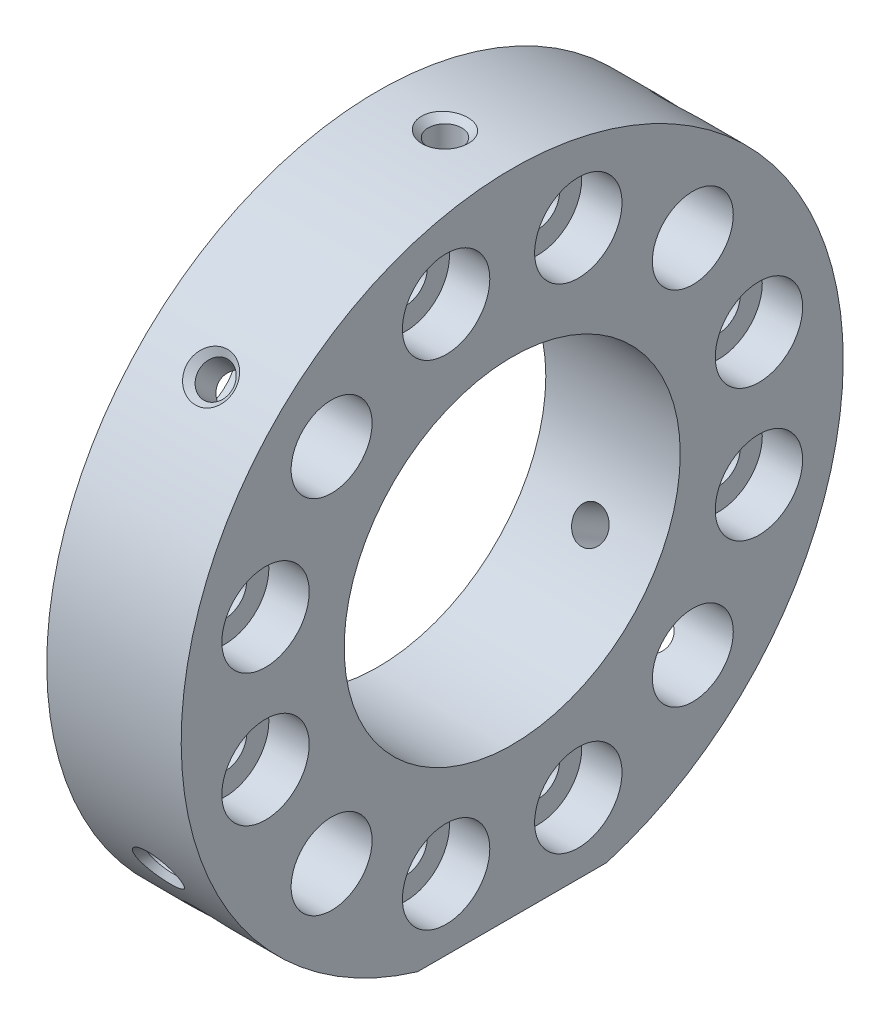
ISO-10303-21;
HEADER;
FILE_DESCRIPTION(('STEP AP214'),'2;1');
FILE_NAME('part.step','',(''),(''),'','','');
FILE_SCHEMA(('AUTOMOTIVE_DESIGN { 1 0 10303 214 1 1 1 1 }'));
ENDSEC;
DATA;
#1=APPLICATION_CONTEXT('core data for automotive mechanical design processes');
#2=APPLICATION_PROTOCOL_DEFINITION('international standard','automotive_design',2000,#1);
#3=PRODUCT_CONTEXT('',#1,'mechanical');
#4=PRODUCT('Part','Part','',(#3));
#5=PRODUCT_RELATED_PRODUCT_CATEGORY('part','',(#4));
#6=PRODUCT_DEFINITION_FORMATION('','',#4);
#7=PRODUCT_DEFINITION_CONTEXT('part definition',#1,'design');
#8=PRODUCT_DEFINITION('design','',#6,#7);
#9=PRODUCT_DEFINITION_SHAPE('','',#8);
#10=(LENGTH_UNIT() NAMED_UNIT(*) SI_UNIT(.MILLI.,.METRE.));
#11=(NAMED_UNIT(*) PLANE_ANGLE_UNIT() SI_UNIT($,.RADIAN.));
#12=(NAMED_UNIT(*) SI_UNIT($,.STERADIAN.) SOLID_ANGLE_UNIT());
#13=UNCERTAINTY_MEASURE_WITH_UNIT(LENGTH_MEASURE(1.E-05),#10,'distance_accuracy_value','');
#14=(GEOMETRIC_REPRESENTATION_CONTEXT(3) GLOBAL_UNCERTAINTY_ASSIGNED_CONTEXT((#13)) GLOBAL_UNIT_ASSIGNED_CONTEXT((#10,
#11,#12)) REPRESENTATION_CONTEXT('',''));
#15=CARTESIAN_POINT('',(0.,0.,0.));
#16=DIRECTION('',(0.,0.,1.));
#17=DIRECTION('',(1.,0.,0.));
#18=AXIS2_PLACEMENT_3D('',#15,#16,#17);
#19=CARTESIAN_POINT('',(10.,0.,0.));
#20=DIRECTION('',(1.,0.,0.));
#21=DIRECTION('',(0.,0.,-1.));
#22=AXIS2_PLACEMENT_3D('',#19,#20,#21);
#23=PLANE('',#22);
#24=DIRECTION('',(0.,0.,1.));
#25=VECTOR('',#24,1.);
#26=CARTESIAN_POINT('',(10.,-23.6,17.1879753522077));
#27=LINE('',#26,#25);
#28=CARTESIAN_POINT('',(10.,-23.6,-7.030691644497));
#29=VERTEX_POINT('',#28);
#30=CARTESIAN_POINT('',(10.,-23.6,7.030691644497));
#31=VERTEX_POINT('',#30);
#32=EDGE_CURVE('E52',#29,#31,#27,.T.);
#33=ORIENTED_EDGE('',*,*,#32,.F.);
#34=CARTESIAN_POINT('',(10.,0.,0.));
#35=DIRECTION('',(1.,0.,0.));
#36=DIRECTION('',(0.,0.,-1.));
#37=AXIS2_PLACEMENT_3D('',#34,#35,#36);
#38=CIRCLE('',#37,24.625);
#39=EDGE_CURVE('E69',#29,#31,#38,.T.);
#40=ORIENTED_EDGE('',*,*,#39,.T.);
#41=EDGE_LOOP('',(#33,#40));
#42=FACE_BOUND('',#41,.T.);
#43=CARTESIAN_POINT('',(10.,13.4350288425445,13.4350288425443));
#44=DIRECTION('',(1.,0.,0.));
#45=DIRECTION('',(0.,0.,-1.));
#46=AXIS2_PLACEMENT_3D('',#43,#44,#45);
#47=CIRCLE('',#46,3.00999999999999);
#48=CARTESIAN_POINT('',(10.,13.4350288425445,10.4250288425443));
#49=VERTEX_POINT('',#48);
#50=EDGE_CURVE('E398',#49,#49,#47,.T.);
#51=ORIENTED_EDGE('',*,*,#50,.F.);
#52=EDGE_LOOP('',(#51));
#53=FACE_BOUND('',#52,.T.);
#54=CARTESIAN_POINT('',(10.,-13.4350288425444,13.4350288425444));
#55=DIRECTION('',(1.,0.,0.));
#56=DIRECTION('',(0.,0.,-1.));
#57=AXIS2_PLACEMENT_3D('',#54,#55,#56);
#58=CIRCLE('',#57,3.00999999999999);
#59=CARTESIAN_POINT('',(10.,-13.4350288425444,10.4250288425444));
#60=VERTEX_POINT('',#59);
#61=EDGE_CURVE('E402',#60,#60,#58,.T.);
#62=ORIENTED_EDGE('',*,*,#61,.F.);
#63=EDGE_LOOP('',(#62));
#64=FACE_BOUND('',#63,.T.);
#65=CARTESIAN_POINT('',(10.,-13.4350288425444,-13.4350288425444));
#66=DIRECTION('',(1.,0.,0.));
#67=DIRECTION('',(0.,0.,-1.));
#68=AXIS2_PLACEMENT_3D('',#65,#66,#67);
#69=CIRCLE('',#68,3.00999999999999);
#70=CARTESIAN_POINT('',(10.,-13.4350288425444,-16.4450288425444));
#71=VERTEX_POINT('',#70);
#72=EDGE_CURVE('E406',#71,#71,#69,.T.);
#73=ORIENTED_EDGE('',*,*,#72,.F.);
#74=EDGE_LOOP('',(#73));
#75=FACE_BOUND('',#74,.T.);
#76=CARTESIAN_POINT('',(10.,4.9175618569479,18.3525906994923));
#77=DIRECTION('',(1.,0.,0.));
#78=DIRECTION('',(0.,0.,-1.));
#79=AXIS2_PLACEMENT_3D('',#76,#77,#78);
#80=CIRCLE('',#79,3.25);
#81=CARTESIAN_POINT('',(10.,4.9175618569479,15.1025906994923));
#82=VERTEX_POINT('',#81);
#83=EDGE_CURVE('E115',#82,#82,#80,.T.);
#84=ORIENTED_EDGE('',*,*,#83,.F.);
#85=EDGE_LOOP('',(#84));
#86=FACE_BOUND('',#85,.T.);
#87=CARTESIAN_POINT('',(10.,18.3525906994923,4.91756185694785));
#88=DIRECTION('',(1.,0.,0.));
#89=DIRECTION('',(0.,0.,-1.));
#90=AXIS2_PLACEMENT_3D('',#87,#88,#89);
#91=CIRCLE('',#90,3.25);
#92=CARTESIAN_POINT('',(10.,18.3525906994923,1.66756185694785));
#93=VERTEX_POINT('',#92);
#94=EDGE_CURVE('E129',#93,#93,#91,.T.);
#95=ORIENTED_EDGE('',*,*,#94,.F.);
#96=EDGE_LOOP('',(#95));
#97=FACE_BOUND('',#96,.T.);
#98=CARTESIAN_POINT('',(10.,-18.3525906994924,4.91756185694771));
#99=DIRECTION('',(1.,0.,0.));
#100=DIRECTION('',(0.,0.,-1.));
#101=AXIS2_PLACEMENT_3D('',#98,#99,#100);
#102=CIRCLE('',#101,3.25);
#103=CARTESIAN_POINT('',(10.,-18.3525906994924,1.66756185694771));
#104=VERTEX_POINT('',#103);
#105=EDGE_CURVE('E141',#104,#104,#102,.T.);
#106=ORIENTED_EDGE('',*,*,#105,.F.);
#107=EDGE_LOOP('',(#106));
#108=FACE_BOUND('',#107,.T.);
#109=CARTESIAN_POINT('',(10.,-4.91756185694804,18.3525906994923));
#110=DIRECTION('',(1.,0.,0.));
#111=DIRECTION('',(0.,0.,-1.));
#112=AXIS2_PLACEMENT_3D('',#109,#110,#111);
#113=CIRCLE('',#112,3.25);
#114=CARTESIAN_POINT('',(10.,-4.91756185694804,15.1025906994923));
#115=VERTEX_POINT('',#114);
#116=EDGE_CURVE('E153',#115,#115,#113,.T.);
#117=ORIENTED_EDGE('',*,*,#116,.F.);
#118=EDGE_LOOP('',(#117));
#119=FACE_BOUND('',#118,.T.);
#120=CARTESIAN_POINT('',(10.,-4.91756185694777,-18.3525906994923));
#121=DIRECTION('',(1.,0.,0.));
#122=DIRECTION('',(0.,0.,-1.));
#123=AXIS2_PLACEMENT_3D('',#120,#121,#122);
#124=CIRCLE('',#123,3.25);
#125=CARTESIAN_POINT('',(10.,-4.91756185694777,-21.6025906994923));
#126=VERTEX_POINT('',#125);
#127=EDGE_CURVE('E165',#126,#126,#124,.T.);
#128=ORIENTED_EDGE('',*,*,#127,.F.);
#129=EDGE_LOOP('',(#128));
#130=FACE_BOUND('',#129,.T.);
#131=CARTESIAN_POINT('',(10.,-18.3525906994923,-4.91756185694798));
#132=DIRECTION('',(1.,0.,0.));
#133=DIRECTION('',(0.,0.,-1.));
#134=AXIS2_PLACEMENT_3D('',#131,#132,#133);
#135=CIRCLE('',#134,3.25);
#136=CARTESIAN_POINT('',(10.,-18.3525906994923,-8.16756185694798));
#137=VERTEX_POINT('',#136);
#138=EDGE_CURVE('E177',#137,#137,#135,.T.);
#139=ORIENTED_EDGE('',*,*,#138,.F.);
#140=EDGE_LOOP('',(#139));
#141=FACE_BOUND('',#140,.T.);
#142=CARTESIAN_POINT('',(10.,18.3525906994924,-4.91756185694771));
#143=DIRECTION('',(1.,0.,0.));
#144=DIRECTION('',(0.,0.,-1.));
#145=AXIS2_PLACEMENT_3D('',#142,#143,#144);
#146=CIRCLE('',#145,3.25);
#147=CARTESIAN_POINT('',(10.,18.3525906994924,-8.16756185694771));
#148=VERTEX_POINT('',#147);
#149=EDGE_CURVE('E189',#148,#148,#146,.T.);
#150=ORIENTED_EDGE('',*,*,#149,.F.);
#151=EDGE_LOOP('',(#150));
#152=FACE_BOUND('',#151,.T.);
#153=CARTESIAN_POINT('',(10.,4.91756185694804,-18.3525906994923));
#154=DIRECTION('',(1.,0.,0.));
#155=DIRECTION('',(0.,0.,-1.));
#156=AXIS2_PLACEMENT_3D('',#153,#154,#155);
#157=CIRCLE('',#156,3.25);
#158=CARTESIAN_POINT('',(10.,4.91756185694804,-21.6025906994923));
#159=VERTEX_POINT('',#158);
#160=EDGE_CURVE('E201',#159,#159,#157,.T.);
#161=ORIENTED_EDGE('',*,*,#160,.F.);
#162=EDGE_LOOP('',(#161));
#163=FACE_BOUND('',#162,.T.);
#164=CARTESIAN_POINT('',(10.,13.4350288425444,-13.4350288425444));
#165=DIRECTION('',(1.,0.,0.));
#166=DIRECTION('',(0.,0.,-1.));
#167=AXIS2_PLACEMENT_3D('',#164,#165,#166);
#168=CIRCLE('',#167,3.00999999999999);
#169=CARTESIAN_POINT('',(10.,13.4350288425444,-16.4450288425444));
#170=VERTEX_POINT('',#169);
#171=EDGE_CURVE('E213',#170,#170,#168,.T.);
#172=ORIENTED_EDGE('',*,*,#171,.F.);
#173=EDGE_LOOP('',(#172));
#174=FACE_BOUND('',#173,.T.);
#175=CARTESIAN_POINT('',(10.,0.,0.));
#176=DIRECTION('',(1.,0.,0.));
#177=DIRECTION('',(0.,0.,-1.));
#178=AXIS2_PLACEMENT_3D('',#175,#176,#177);
#179=CIRCLE('',#178,12.5);
#180=CARTESIAN_POINT('',(10.,0.,-12.5));
#181=VERTEX_POINT('',#180);
#182=EDGE_CURVE('E78',#181,#181,#179,.T.);
#183=ORIENTED_EDGE('',*,*,#182,.F.);
#184=EDGE_LOOP('',(#183));
#185=FACE_BOUND('',#184,.T.);
#186=ADVANCED_FACE('F36',(#42,#53,#64,#75,#86,#97,#108,#119,#130,#141,#152,#163,#174,#185),#23,.T.);
#187=CARTESIAN_POINT('',(0.,0.,0.));
#188=DIRECTION('',(1.,0.,0.));
#189=DIRECTION('',(0.,0.,-1.));
#190=AXIS2_PLACEMENT_3D('',#187,#188,#189);
#191=PLANE('',#190);
#192=CARTESIAN_POINT('',(0.,13.4350288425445,13.4350288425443));
#193=DIRECTION('',(1.,0.,0.));
#194=DIRECTION('',(0.,0.,-1.));
#195=AXIS2_PLACEMENT_3D('',#192,#193,#194);
#196=CIRCLE('',#195,3.01);
#197=CARTESIAN_POINT('',(0.,13.4350288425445,10.4250288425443));
#198=VERTEX_POINT('',#197);
#199=EDGE_CURVE('E252',#198,#198,#196,.T.);
#200=ORIENTED_EDGE('',*,*,#199,.T.);
#201=EDGE_LOOP('',(#200));
#202=FACE_BOUND('',#201,.T.);
#203=CARTESIAN_POINT('',(0.,-13.4350288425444,13.4350288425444));
#204=DIRECTION('',(1.,0.,0.));
#205=DIRECTION('',(0.,0.,-1.));
#206=AXIS2_PLACEMENT_3D('',#203,#204,#205);
#207=CIRCLE('',#206,3.01);
#208=CARTESIAN_POINT('',(0.,-13.4350288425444,10.4250288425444));
#209=VERTEX_POINT('',#208);
#210=EDGE_CURVE('E256',#209,#209,#207,.T.);
#211=ORIENTED_EDGE('',*,*,#210,.T.);
#212=EDGE_LOOP('',(#211));
#213=FACE_BOUND('',#212,.T.);
#214=CARTESIAN_POINT('',(0.,-13.4350288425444,-13.4350288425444));
#215=DIRECTION('',(1.,0.,0.));
#216=DIRECTION('',(0.,0.,-1.));
#217=AXIS2_PLACEMENT_3D('',#214,#215,#216);
#218=CIRCLE('',#217,3.01);
#219=CARTESIAN_POINT('',(0.,-13.4350288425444,-16.4450288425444));
#220=VERTEX_POINT('',#219);
#221=EDGE_CURVE('E260',#220,#220,#218,.T.);
#222=ORIENTED_EDGE('',*,*,#221,.T.);
#223=EDGE_LOOP('',(#222));
#224=FACE_BOUND('',#223,.T.);
#225=CARTESIAN_POINT('',(0.,4.9175618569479,18.3525906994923));
#226=DIRECTION('',(1.,0.,0.));
#227=DIRECTION('',(0.,0.,-1.));
#228=AXIS2_PLACEMENT_3D('',#225,#226,#227);
#229=CIRCLE('',#228,1.6);
#230=CARTESIAN_POINT('',(0.,4.9175618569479,16.7525906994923));
#231=VERTEX_POINT('',#230);
#232=EDGE_CURVE('E126',#231,#231,#229,.T.);
#233=ORIENTED_EDGE('',*,*,#232,.T.);
#234=EDGE_LOOP('',(#233));
#235=FACE_BOUND('',#234,.T.);
#236=CARTESIAN_POINT('',(0.,18.3525906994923,4.91756185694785));
#237=DIRECTION('',(1.,0.,0.));
#238=DIRECTION('',(0.,0.,-1.));
#239=AXIS2_PLACEMENT_3D('',#236,#237,#238);
#240=CIRCLE('',#239,1.6);
#241=CARTESIAN_POINT('',(0.,18.3525906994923,3.31756185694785));
#242=VERTEX_POINT('',#241);
#243=EDGE_CURVE('E138',#242,#242,#240,.T.);
#244=ORIENTED_EDGE('',*,*,#243,.T.);
#245=EDGE_LOOP('',(#244));
#246=FACE_BOUND('',#245,.T.);
#247=CARTESIAN_POINT('',(0.,-18.3525906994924,4.91756185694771));
#248=DIRECTION('',(1.,0.,0.));
#249=DIRECTION('',(0.,0.,-1.));
#250=AXIS2_PLACEMENT_3D('',#247,#248,#249);
#251=CIRCLE('',#250,1.6);
#252=CARTESIAN_POINT('',(0.,-18.3525906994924,3.31756185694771));
#253=VERTEX_POINT('',#252);
#254=EDGE_CURVE('E150',#253,#253,#251,.T.);
#255=ORIENTED_EDGE('',*,*,#254,.T.);
#256=EDGE_LOOP('',(#255));
#257=FACE_BOUND('',#256,.T.);
#258=CARTESIAN_POINT('',(0.,-4.91756185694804,18.3525906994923));
#259=DIRECTION('',(1.,0.,0.));
#260=DIRECTION('',(0.,0.,-1.));
#261=AXIS2_PLACEMENT_3D('',#258,#259,#260);
#262=CIRCLE('',#261,1.6);
#263=CARTESIAN_POINT('',(0.,-4.91756185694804,16.7525906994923));
#264=VERTEX_POINT('',#263);
#265=EDGE_CURVE('E162',#264,#264,#262,.T.);
#266=ORIENTED_EDGE('',*,*,#265,.T.);
#267=EDGE_LOOP('',(#266));
#268=FACE_BOUND('',#267,.T.);
#269=CARTESIAN_POINT('',(0.,-4.91756185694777,-18.3525906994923));
#270=DIRECTION('',(1.,0.,0.));
#271=DIRECTION('',(0.,0.,-1.));
#272=AXIS2_PLACEMENT_3D('',#269,#270,#271);
#273=CIRCLE('',#272,1.6);
#274=CARTESIAN_POINT('',(0.,-4.91756185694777,-19.9525906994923));
#275=VERTEX_POINT('',#274);
#276=EDGE_CURVE('E174',#275,#275,#273,.T.);
#277=ORIENTED_EDGE('',*,*,#276,.T.);
#278=EDGE_LOOP('',(#277));
#279=FACE_BOUND('',#278,.T.);
#280=CARTESIAN_POINT('',(0.,-18.3525906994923,-4.91756185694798));
#281=DIRECTION('',(1.,0.,0.));
#282=DIRECTION('',(0.,0.,-1.));
#283=AXIS2_PLACEMENT_3D('',#280,#281,#282);
#284=CIRCLE('',#283,1.6);
#285=CARTESIAN_POINT('',(0.,-18.3525906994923,-6.51756185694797));
#286=VERTEX_POINT('',#285);
#287=EDGE_CURVE('E186',#286,#286,#284,.T.);
#288=ORIENTED_EDGE('',*,*,#287,.T.);
#289=EDGE_LOOP('',(#288));
#290=FACE_BOUND('',#289,.T.);
#291=CARTESIAN_POINT('',(0.,18.3525906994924,-4.91756185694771));
#292=DIRECTION('',(1.,0.,0.));
#293=DIRECTION('',(0.,0.,-1.));
#294=AXIS2_PLACEMENT_3D('',#291,#292,#293);
#295=CIRCLE('',#294,1.6);
#296=CARTESIAN_POINT('',(0.,18.3525906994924,-6.5175618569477));
#297=VERTEX_POINT('',#296);
#298=EDGE_CURVE('E198',#297,#297,#295,.T.);
#299=ORIENTED_EDGE('',*,*,#298,.T.);
#300=EDGE_LOOP('',(#299));
#301=FACE_BOUND('',#300,.T.);
#302=CARTESIAN_POINT('',(0.,4.91756185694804,-18.3525906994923));
#303=DIRECTION('',(1.,0.,0.));
#304=DIRECTION('',(0.,0.,-1.));
#305=AXIS2_PLACEMENT_3D('',#302,#303,#304);
#306=CIRCLE('',#305,1.6);
#307=CARTESIAN_POINT('',(0.,4.91756185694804,-19.9525906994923));
#308=VERTEX_POINT('',#307);
#309=EDGE_CURVE('E210',#308,#308,#306,.T.);
#310=ORIENTED_EDGE('',*,*,#309,.T.);
#311=EDGE_LOOP('',(#310));
#312=FACE_BOUND('',#311,.T.);
#313=CARTESIAN_POINT('',(0.,13.4350288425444,-13.4350288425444));
#314=DIRECTION('',(1.,0.,0.));
#315=DIRECTION('',(0.,0.,-1.));
#316=AXIS2_PLACEMENT_3D('',#313,#314,#315);
#317=CIRCLE('',#316,3.01);
#318=CARTESIAN_POINT('',(0.,13.4350288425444,-16.4450288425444));
#319=VERTEX_POINT('',#318);
#320=EDGE_CURVE('E216',#319,#319,#317,.T.);
#321=ORIENTED_EDGE('',*,*,#320,.T.);
#322=EDGE_LOOP('',(#321));
#323=FACE_BOUND('',#322,.T.);
#324=CARTESIAN_POINT('',(0.,0.,0.));
#325=DIRECTION('',(1.,0.,0.));
#326=DIRECTION('',(0.,0.,-1.));
#327=AXIS2_PLACEMENT_3D('',#324,#325,#326);
#328=CIRCLE('',#327,24.625);
#329=CARTESIAN_POINT('',(0.,-23.6,-7.030691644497));
#330=VERTEX_POINT('',#329);
#331=CARTESIAN_POINT('',(0.,-23.6,7.030691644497));
#332=VERTEX_POINT('',#331);
#333=EDGE_CURVE('E73',#330,#332,#328,.T.);
#334=ORIENTED_EDGE('',*,*,#333,.F.);
#335=DIRECTION('',(0.,0.,1.));
#336=VECTOR('',#335,1.);
#337=CARTESIAN_POINT('',(0.,-23.6,17.1879753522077));
#338=LINE('',#337,#336);
#339=EDGE_CURVE('E61',#330,#332,#338,.T.);
#340=ORIENTED_EDGE('',*,*,#339,.T.);
#341=EDGE_LOOP('',(#334,#340));
#342=FACE_BOUND('',#341,.T.);
#343=CARTESIAN_POINT('',(0.,0.,0.));
#344=DIRECTION('',(1.,0.,0.));
#345=DIRECTION('',(0.,0.,-1.));
#346=AXIS2_PLACEMENT_3D('',#343,#344,#345);
#347=CIRCLE('',#346,12.5);
#348=CARTESIAN_POINT('',(0.,0.,-12.5));
#349=VERTEX_POINT('',#348);
#350=EDGE_CURVE('E81',#349,#349,#347,.T.);
#351=ORIENTED_EDGE('',*,*,#350,.T.);
#352=EDGE_LOOP('',(#351));
#353=FACE_BOUND('',#352,.T.);
#354=ADVANCED_FACE('F224',(#202,#213,#224,#235,#246,#257,#268,#279,#290,#301,#312,#323,#342,
#353),#191,.F.);
#355=CARTESIAN_POINT('',(10.,0.,0.));
#356=DIRECTION('',(-1.,0.,0.));
#357=DIRECTION('',(0.,0.,1.));
#358=AXIS2_PLACEMENT_3D('',#355,#356,#357);
#359=CYLINDRICAL_SURFACE('',#358,24.625);
#360=CARTESIAN_POINT('',(3.25488672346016,17.3229828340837,17.5015683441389));
#361=CARTESIAN_POINT('',(3.2481805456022,17.3845064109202,17.4406719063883));
#362=CARTESIAN_POINT('',(3.24838405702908,17.4461132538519,17.3790459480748));
#363=CARTESIAN_POINT('',(3.26262545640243,17.5679063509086,17.2559209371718));
#364=CARTESIAN_POINT('',(3.27667500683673,17.6280913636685,17.1944220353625));
#365=CARTESIAN_POINT('',(3.31935443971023,17.7488241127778,17.0697921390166));
#366=CARTESIAN_POINT('',(3.34875414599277,17.8092047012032,17.0067615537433));
#367=CARTESIAN_POINT('',(3.42153599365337,17.92516772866,16.8844928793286));
#368=CARTESIAN_POINT('',(3.46491911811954,17.9807498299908,16.8252550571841));
#369=CARTESIAN_POINT('',(3.56512062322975,18.086707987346,16.7113069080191));
#370=CARTESIAN_POINT('',(3.62214851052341,18.136983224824,16.6566872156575));
#371=CARTESIAN_POINT('',(3.74749853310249,18.2301898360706,16.5546244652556));
#372=CARTESIAN_POINT('',(3.81582218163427,18.2731202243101,16.5071823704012));
#373=CARTESIAN_POINT('',(3.96412568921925,18.3520483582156,16.4193954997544));
#374=CARTESIAN_POINT('',(4.04440552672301,18.3877843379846,16.379322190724));
#375=CARTESIAN_POINT('',(4.21262450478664,18.4499226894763,16.3092972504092));
#376=CARTESIAN_POINT('',(4.30056488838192,18.4763235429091,16.2793472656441));
#377=CARTESIAN_POINT('',(4.48452206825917,18.5200145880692,16.2296279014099));
#378=CARTESIAN_POINT('',(4.58070432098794,18.5369986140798,16.2102010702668));
#379=CARTESIAN_POINT('',(4.77600649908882,18.5602966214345,16.1835203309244));
#380=CARTESIAN_POINT('',(4.87512676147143,18.5666093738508,16.1762678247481));
#381=CARTESIAN_POINT('',(5.07543864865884,18.5684784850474,16.1741224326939));
#382=CARTESIAN_POINT('',(5.1766347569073,18.5638342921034,16.1794599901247));
#383=CARTESIAN_POINT('',(5.37641698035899,18.5434456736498,16.2028233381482));
#384=CARTESIAN_POINT('',(5.4750029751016,18.5277007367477,16.2208497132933));
#385=CARTESIAN_POINT('',(5.66686391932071,18.4853489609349,16.2690972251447));
#386=CARTESIAN_POINT('',(5.76013153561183,18.4587275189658,16.2993347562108));
#387=CARTESIAN_POINT('',(5.93842698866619,18.3951043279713,16.3711041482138));
#388=CARTESIAN_POINT('',(6.0234552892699,18.3581031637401,16.4126353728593));
#389=CARTESIAN_POINT('',(6.18128363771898,18.2751523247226,16.5049449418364));
#390=CARTESIAN_POINT('',(6.25426252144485,18.2293606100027,16.5555591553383));
#391=CARTESIAN_POINT('',(6.38728964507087,18.1294432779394,16.6649146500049));
#392=CARTESIAN_POINT('',(6.44734016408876,18.0753191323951,16.723654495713));
#393=CARTESIAN_POINT('',(6.5507993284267,17.9618408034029,16.8454624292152));
#394=CARTESIAN_POINT('',(6.59466401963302,17.9026993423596,16.9083412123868));
#395=CARTESIAN_POINT('',(6.66674469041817,17.7793587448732,17.0379874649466));
#396=CARTESIAN_POINT('',(6.6949640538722,17.7151607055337,17.1047540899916));
#397=CARTESIAN_POINT('',(6.73407201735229,17.5856737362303,17.2378374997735));
#398=CARTESIAN_POINT('',(6.74549427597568,17.5204881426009,17.3040983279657));
#399=CARTESIAN_POINT('',(6.75231841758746,17.3889486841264,17.4362776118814));
#400=CARTESIAN_POINT('',(6.74772223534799,17.3225949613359,17.5021961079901));
#401=CARTESIAN_POINT('',(6.72288529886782,17.1917716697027,17.6307086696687));
#402=CARTESIAN_POINT('',(6.7029021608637,17.1272890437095,17.6933395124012));
#403=CARTESIAN_POINT('',(6.64828604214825,17.0009680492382,17.8147520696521));
#404=CARTESIAN_POINT('',(6.6136527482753,16.939129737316,17.8735337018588));
#405=CARTESIAN_POINT('',(6.53049116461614,16.8193308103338,17.9863163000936));
#406=CARTESIAN_POINT('',(6.48183962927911,16.761410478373,18.0402690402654));
#407=CARTESIAN_POINT('',(6.37229673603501,16.6517088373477,18.1415766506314));
#408=CARTESIAN_POINT('',(6.31140384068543,16.5999283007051,18.1889306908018));
#409=CARTESIAN_POINT('',(6.17727678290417,16.5025561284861,18.2773280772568));
#410=CARTESIAN_POINT('',(6.10374055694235,16.457182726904,18.3181533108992));
#411=CARTESIAN_POINT('',(5.94774180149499,16.3756921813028,18.3910393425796));
#412=CARTESIAN_POINT('',(5.8652778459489,16.3395765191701,18.4230987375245));
#413=CARTESIAN_POINT('',(5.69087027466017,16.2765643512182,18.47879629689));
#414=CARTESIAN_POINT('',(5.59870493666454,16.2500076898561,18.5021250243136));
#415=CARTESIAN_POINT('',(5.40982735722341,16.2085541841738,18.5384508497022));
#416=CARTESIAN_POINT('',(5.31311449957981,16.1936589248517,18.5514465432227));
#417=CARTESIAN_POINT('',(5.11548914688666,16.1757381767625,18.5670748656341));
#418=CARTESIAN_POINT('',(5.01453126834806,16.1729957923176,18.5694603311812));
#419=CARTESIAN_POINT('',(4.81341575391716,16.1802343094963,18.5631533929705));
#420=CARTESIAN_POINT('',(4.71325817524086,16.1902161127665,18.55446020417));
#421=CARTESIAN_POINT('',(4.51587056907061,16.2227305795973,18.5260385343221));
#422=CARTESIAN_POINT('',(4.4186658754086,16.2453504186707,18.5062334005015));
#423=CARTESIAN_POINT('',(4.23076472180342,16.302534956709,18.4558777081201));
#424=CARTESIAN_POINT('',(4.14006794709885,16.337099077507,18.4253276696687));
#425=CARTESIAN_POINT('',(3.9688908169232,16.4166843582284,18.3544517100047));
#426=CARTESIAN_POINT('',(3.88830881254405,16.4615859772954,18.3142373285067));
#427=CARTESIAN_POINT('',(3.7387401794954,16.5606909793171,18.2246696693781));
#428=CARTESIAN_POINT('',(3.6697542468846,16.614894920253,18.1753158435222));
#429=CARTESIAN_POINT('',(3.54739182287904,16.7293115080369,18.0700480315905));
#430=CARTESIAN_POINT('',(3.49364673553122,16.7893243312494,18.0143451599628));
#431=CARTESIAN_POINT('',(3.40125887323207,16.9145972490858,17.8967696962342));
#432=CARTESIAN_POINT('',(3.36259764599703,16.9798508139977,17.8349047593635));
#433=CARTESIAN_POINT('',(3.3116265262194,17.0917308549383,17.7275854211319));
#434=CARTESIAN_POINT('',(3.2948360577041,17.1375190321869,17.6833317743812));
#435=CARTESIAN_POINT('',(3.26900605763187,17.2298499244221,17.5933808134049));
#436=CARTESIAN_POINT('',(3.25996515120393,17.2763925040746,17.5476837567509));
#437=CARTESIAN_POINT('',(3.25488672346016,17.3229828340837,17.5015683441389));
#438=B_SPLINE_CURVE_WITH_KNOTS('',3,(#360,#361,#362,#363,#364,#365,#366,#367,#368,#369,#370,
#371,#372,#373,#374,#375,#376,#377,#378,#379,#380,#381,#382,#383,#384,#385,#386,#387,#388,#389,
#390,#391,#392,#393,#394,#395,#396,#397,#398,#399,#400,#401,#402,#403,#404,#405,#406,#407,#408,
#409,#410,#411,#412,#413,#414,#415,#416,#417,#418,#419,#420,#421,#422,#423,#424,#425,#426,#427,
#428,#429,#430,#431,#432,#433,#434,#435,#436,#437),.UNSPECIFIED.,.T.,.F.,(4,2,2,2,2,2,2,2,2,2,2,
2,2,2,2,2,2,2,2,2,2,2,2,2,2,2,2,2,2,2,2,2,2,2,2,2,2,2,4),(0.,0.260258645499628,
0.520736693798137,0.795749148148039,1.0707809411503,1.35034241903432,1.6299413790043,
1.91837061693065,2.20684674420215,2.50422170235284,2.80163090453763,3.10452588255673,
3.40743481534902,3.71075178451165,4.01405166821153,4.31234006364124,4.61057583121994,
4.89961573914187,5.18859310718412,5.46817469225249,5.74772250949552,6.02268912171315,
6.29766161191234,6.57512949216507,6.85263224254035,7.13803749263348,7.42348839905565,
7.71826763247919,8.01308692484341,8.3147391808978,8.61641281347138,8.92019350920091,
9.22395950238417,9.52437510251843,9.8248087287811,10.117195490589,10.4092234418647,
10.6063460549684,10.8034336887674),.UNSPECIFIED.);
#439=CARTESIAN_POINT('',(3.25488672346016,17.3229828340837,17.5015683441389));
#440=VERTEX_POINT('',#439);
#441=EDGE_CURVE('E310',#440,#440,#438,.T.);
#442=ORIENTED_EDGE('',*,*,#441,.T.);
#443=EDGE_LOOP('',(#442));
#444=FACE_BOUND('',#443,.T.);
#445=CARTESIAN_POINT('',(3.6682868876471,-18.1711053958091,16.6193126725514));
#446=CARTESIAN_POINT('',(3.61176813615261,-18.127801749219,16.6666594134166));
#447=CARTESIAN_POINT('',(3.56005140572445,-18.0814421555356,16.7169749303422));
#448=CARTESIAN_POINT('',(3.46755193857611,-17.9834375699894,16.8223594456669));
#449=CARTESIAN_POINT('',(3.42677537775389,-17.9317896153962,16.8774311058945));
#450=CARTESIAN_POINT('',(3.35352532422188,-17.8183867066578,16.9971531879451));
#451=CARTESIAN_POINT('',(3.32243456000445,-17.7561432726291,17.0621943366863));
#452=CARTESIAN_POINT('',(3.27622852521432,-17.6281119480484,17.1944398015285));
#453=CARTESIAN_POINT('',(3.2611144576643,-17.5623237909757,17.2616442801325));
#454=CARTESIAN_POINT('',(3.24759108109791,-17.4308461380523,17.3943878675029));
#455=CARTESIAN_POINT('',(3.2487605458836,-17.3651979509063,17.459925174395));
#456=CARTESIAN_POINT('',(3.26674092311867,-17.2342663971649,17.5891770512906));
#457=CARTESIAN_POINT('',(3.2835500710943,-17.1689829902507,17.6528918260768));
#458=CARTESIAN_POINT('',(3.33205937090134,-17.0411246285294,17.7763480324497));
#459=CARTESIAN_POINT('',(3.36366051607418,-16.9785346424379,17.8361129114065));
#460=CARTESIAN_POINT('',(3.44067055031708,-16.8574090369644,17.950636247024));
#461=CARTESIAN_POINT('',(3.48608051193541,-16.7988737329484,18.0053943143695));
#462=CARTESIAN_POINT('',(3.59022815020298,-16.6864926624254,18.1095989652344));
#463=CARTESIAN_POINT('',(3.64919280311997,-16.6327513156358,18.158931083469));
#464=CARTESIAN_POINT('',(3.7781778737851,-16.532685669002,18.2500827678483));
#465=CARTESIAN_POINT('',(3.84819991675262,-16.4863624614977,18.2919012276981));
#466=CARTESIAN_POINT('',(3.99971055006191,-16.4010408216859,18.3684480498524));
#467=CARTESIAN_POINT('',(4.08149486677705,-16.3623249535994,18.4029060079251));
#468=CARTESIAN_POINT('',(4.25240366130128,-16.2952092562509,18.4623616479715));
#469=CARTESIAN_POINT('',(4.34152928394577,-16.2668110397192,18.4873578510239));
#470=CARTESIAN_POINT('',(4.52748391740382,-16.2204130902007,18.5280817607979));
#471=CARTESIAN_POINT('',(4.62446434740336,-16.2027536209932,18.5435064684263));
#472=CARTESIAN_POINT('',(4.82096592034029,-16.1797074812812,18.56361835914));
#473=CARTESIAN_POINT('',(4.92048734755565,-16.1743221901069,18.5683043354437));
#474=CARTESIAN_POINT('',(5.12107080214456,-16.175993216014,18.5668487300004));
#475=CARTESIAN_POINT('',(5.22212980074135,-16.1832656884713,18.5605190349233));
#476=CARTESIAN_POINT('',(5.42120363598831,-16.2104617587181,18.5367709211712));
#477=CARTESIAN_POINT('',(5.51921835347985,-16.2303858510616,18.5193520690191));
#478=CARTESIAN_POINT('',(5.70937312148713,-16.2823012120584,18.4737240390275));
#479=CARTESIAN_POINT('',(5.80151321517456,-16.3142923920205,18.4455149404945));
#480=CARTESIAN_POINT('',(5.97715256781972,-16.3893864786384,18.3788233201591));
#481=CARTESIAN_POINT('',(6.06065239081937,-16.4324886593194,18.3403414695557));
#482=CARTESIAN_POINT('',(6.21497748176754,-16.5276177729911,18.2546566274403));
#483=CARTESIAN_POINT('',(6.28600206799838,-16.5794720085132,18.2076212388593));
#484=CARTESIAN_POINT('',(6.41483545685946,-16.6910121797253,18.1054257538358));
#485=CARTESIAN_POINT('',(6.47264668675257,-16.7506966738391,18.0502671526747));
#486=CARTESIAN_POINT('',(6.57144451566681,-16.8739966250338,17.9350424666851));
#487=CARTESIAN_POINT('',(6.61290409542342,-16.9374288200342,17.8751859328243));
#488=CARTESIAN_POINT('',(6.68006722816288,-17.0678487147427,17.7506979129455));
#489=CARTESIAN_POINT('',(6.7057741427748,-17.1348356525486,17.6860674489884));
#490=CARTESIAN_POINT('',(6.73993453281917,-17.2680675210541,17.5559921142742));
#491=CARTESIAN_POINT('',(6.74891222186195,-17.3342679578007,17.490638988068));
#492=CARTESIAN_POINT('',(6.75090107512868,-17.4660323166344,17.359061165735));
#493=CARTESIAN_POINT('',(6.74391399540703,-17.5315963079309,17.2928365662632));
#494=CARTESIAN_POINT('',(6.71444478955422,-17.6592594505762,17.1624412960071));
#495=CARTESIAN_POINT('',(6.69219041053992,-17.7213952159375,17.0982547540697));
#496=CARTESIAN_POINT('',(6.63318295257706,-17.8415858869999,16.9728015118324));
#497=CARTESIAN_POINT('',(6.59642942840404,-17.899640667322,16.9115349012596));
#498=CARTESIAN_POINT('',(6.50913845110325,-18.0108717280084,16.7930285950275));
#499=CARTESIAN_POINT('',(6.4584547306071,-18.0639877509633,16.7358402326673));
#500=CARTESIAN_POINT('',(6.34506455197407,-18.163439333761,16.6278530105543));
#501=CARTESIAN_POINT('',(6.2823565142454,-18.2097740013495,16.5770549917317));
#502=CARTESIAN_POINT('',(6.14474817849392,-18.295990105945,16.4818574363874));
#503=CARTESIAN_POINT('',(6.06954392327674,-18.3356420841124,16.4376895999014));
#504=CARTESIAN_POINT('',(5.91050099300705,-18.4060404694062,16.3588233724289));
#505=CARTESIAN_POINT('',(5.82666091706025,-18.436785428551,16.3241265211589));
#506=CARTESIAN_POINT('',(5.64981077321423,-18.4896873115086,16.2641860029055));
#507=CARTESIAN_POINT('',(5.55659169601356,-18.5115339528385,16.239284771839));
#508=CARTESIAN_POINT('',(5.36598389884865,-18.5448063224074,16.2012785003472));
#509=CARTESIAN_POINT('',(5.26859474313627,-18.5562309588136,16.1881746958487));
#510=CARTESIAN_POINT('',(5.0701154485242,-18.5686103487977,16.1739738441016));
#511=CARTESIAN_POINT('',(4.9689910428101,-18.5693288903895,16.173147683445));
#512=CARTESIAN_POINT('',(4.76795371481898,-18.5596728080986,16.1842275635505));
#513=CARTESIAN_POINT('',(4.66804106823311,-18.5492957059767,16.1961364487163));
#514=CARTESIAN_POINT('',(4.47168941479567,-18.5175257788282,16.2324503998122));
#515=CARTESIAN_POINT('',(4.37527459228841,-18.4960678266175,16.256929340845));
#516=CARTESIAN_POINT('',(4.18942796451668,-18.4424823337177,16.3176928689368));
#517=CARTESIAN_POINT('',(4.09999067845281,-18.4103632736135,16.3539680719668));
#518=CARTESIAN_POINT('',(3.9512278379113,-18.3450627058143,16.4271446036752));
#519=CARTESIAN_POINT('',(3.88983881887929,-18.3140012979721,16.4617897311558));
#520=CARTESIAN_POINT('',(3.77377049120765,-18.2464834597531,16.5365959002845));
#521=CARTESIAN_POINT('',(3.71908883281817,-18.2100289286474,16.5767549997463));
#522=CARTESIAN_POINT('',(3.6682868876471,-18.1711053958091,16.6193126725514));
#523=B_SPLINE_CURVE_WITH_KNOTS('',3,(#445,#446,#447,#448,#449,#450,#451,#452,#453,#454,#455,
#456,#457,#458,#459,#460,#461,#462,#463,#464,#465,#466,#467,#468,#469,#470,#471,#472,#473,#474,
#475,#476,#477,#478,#479,#480,#481,#482,#483,#484,#485,#486,#487,#488,#489,#490,#491,#492,#493,
#494,#495,#496,#497,#498,#499,#500,#501,#502,#503,#504,#505,#506,#507,#508,#509,#510,#511,#512,
#513,#514,#515,#516,#517,#518,#519,#520,#521,#522),.UNSPECIFIED.,.T.,.F.,(4,2,2,2,2,2,2,2,2,2,2,
2,2,2,2,2,2,2,2,2,2,2,2,2,2,2,2,2,2,2,2,2,2,2,2,2,2,2,4),(0.,0.256296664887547,
0.512737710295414,0.797029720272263,1.08134313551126,1.35831583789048,1.63525729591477,
1.91037105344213,2.18550618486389,2.4656358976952,2.74580682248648,3.03496326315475,
3.32416488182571,3.62210824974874,3.92008509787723,4.22320051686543,4.52632778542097,
4.82945282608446,5.13255806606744,5.43026280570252,5.72791281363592,6.01617853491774,
6.30438271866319,6.58339340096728,6.86237339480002,7.13727974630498,7.41219454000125,
7.69011414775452,7.96807028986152,8.25418877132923,8.54035373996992,8.83578383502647,
9.13124487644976,9.43321535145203,9.7352532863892,10.0390869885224,10.3426795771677,
10.5731330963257,10.8035056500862),.UNSPECIFIED.);
#524=CARTESIAN_POINT('',(3.6682868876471,-18.1711053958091,16.6193126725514));
#525=VERTEX_POINT('',#524);
#526=EDGE_CURVE('E315',#525,#525,#523,.T.);
#527=ORIENTED_EDGE('',*,*,#526,.T.);
#528=EDGE_LOOP('',(#527));
#529=FACE_BOUND('',#528,.T.);
#530=CARTESIAN_POINT('',(3.25,-17.4125044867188,-17.4125044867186));
#531=CARTESIAN_POINT('',(3.2500028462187,-17.4739052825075,-17.3511030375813));
#532=CARTESIAN_POINT('',(3.2569453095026,-17.5350054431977,-17.2893478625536));
#533=CARTESIAN_POINT('',(3.28451365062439,-17.6550566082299,-17.166740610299));
#534=CARTESIAN_POINT('',(3.30515165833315,-17.714005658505,-17.1058893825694));
#535=CARTESIAN_POINT('',(3.36106849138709,-17.8316288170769,-16.98326419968));
#536=CARTESIAN_POINT('',(3.3971230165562,-17.8900910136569,-16.9216394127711));
#537=CARTESIAN_POINT('',(3.48267659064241,-18.0015740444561,-16.8029937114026));
#538=CARTESIAN_POINT('',(3.53217670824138,-18.054594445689,-16.7459731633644));
#539=CARTESIAN_POINT('',(3.64427051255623,-18.155080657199,-16.6369855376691));
#540=CARTESIAN_POINT('',(3.70711777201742,-18.2024061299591,-16.5851500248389));
#541=CARTESIAN_POINT('',(3.84336160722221,-18.289206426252,-16.4893826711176));
#542=CARTESIAN_POINT('',(3.91675971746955,-18.3286801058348,-16.4454519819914));
#543=CARTESIAN_POINT('',(4.07459866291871,-18.4002080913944,-16.365388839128));
#544=CARTESIAN_POINT('',(4.15932266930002,-18.4319766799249,-16.3295593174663));
#545=CARTESIAN_POINT('',(4.33543932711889,-18.4858068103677,-16.2685964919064));
#546=CARTESIAN_POINT('',(4.42683302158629,-18.5078668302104,-16.2434648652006));
#547=CARTESIAN_POINT('',(4.61651534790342,-18.5424071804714,-16.2040265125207));
#548=CARTESIAN_POINT('',(4.71492667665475,-18.5545937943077,-16.190051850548));
#549=CARTESIAN_POINT('',(4.91346325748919,-18.5681080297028,-16.1745508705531));
#550=CARTESIAN_POINT('',(5.01358868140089,-18.5694345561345,-16.1730258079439));
#551=CARTESIAN_POINT('',(5.21427261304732,-18.5611441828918,-16.1825397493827));
#552=CARTESIAN_POINT('',(5.31481578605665,-18.5513658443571,-16.1937641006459));
#553=CARTESIAN_POINT('',(5.51197012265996,-18.5207648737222,-16.2287531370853));
#554=CARTESIAN_POINT('',(5.60858118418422,-18.4999419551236,-16.2525181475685));
#555=CARTESIAN_POINT('',(5.79478742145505,-18.447689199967,-16.311803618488));
#556=CARTESIAN_POINT('',(5.88440140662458,-18.4162890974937,-16.3472911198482));
#557=CARTESIAN_POINT('',(6.05418686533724,-18.3434582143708,-16.4289728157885));
#558=CARTESIAN_POINT('',(6.13435913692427,-18.3020282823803,-16.4751661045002));
#559=CARTESIAN_POINT('',(6.28116546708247,-18.2109450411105,-16.5757836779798));
#560=CARTESIAN_POINT('',(6.34804231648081,-18.1614767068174,-16.6300208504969));
#561=CARTESIAN_POINT('',(6.46803479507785,-18.0548652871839,-16.7457049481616));
#562=CARTESIAN_POINT('',(6.52115313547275,-17.9977237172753,-16.8071504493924));
#563=CARTESIAN_POINT('',(6.61026242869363,-17.8791971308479,-16.9331675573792));
#564=CARTESIAN_POINT('',(6.64675661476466,-17.81801195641,-16.9975712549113));
#565=CARTESIAN_POINT('',(6.70381250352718,-17.6914542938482,-17.1292555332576));
#566=CARTESIAN_POINT('',(6.7243774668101,-17.6260826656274,-17.19653552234));
#567=CARTESIAN_POINT('',(6.74845085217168,-17.4950647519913,-17.3297951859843));
#568=CARTESIAN_POINT('',(6.75245727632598,-17.4294868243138,-17.3957524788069));
#569=CARTESIAN_POINT('',(6.74464298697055,-17.2980631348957,-17.5264435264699));
#570=CARTESIAN_POINT('',(6.73282366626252,-17.2322173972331,-17.5911773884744));
#571=CARTESIAN_POINT('',(6.69399012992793,-17.1029102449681,-17.7169167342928));
#572=CARTESIAN_POINT('',(6.66714142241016,-17.0394307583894,-17.7779549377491));
#573=CARTESIAN_POINT('',(6.59927107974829,-16.9159492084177,-17.8954899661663));
#574=CARTESIAN_POINT('',(6.55824873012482,-16.855947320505,-17.9519865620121));
#575=CARTESIAN_POINT('',(6.46264306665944,-16.7402851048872,-18.0598957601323));
#576=CARTESIAN_POINT('',(6.40787077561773,-16.6847008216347,-18.1112222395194));
#577=CARTESIAN_POINT('',(6.28676339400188,-16.5804276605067,-18.2067309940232));
#578=CARTESIAN_POINT('',(6.22042668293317,-16.5317397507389,-18.2509122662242));
#579=CARTESIAN_POINT('',(6.0758927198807,-16.4412051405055,-18.3325185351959));
#580=CARTESIAN_POINT('',(5.99739235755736,-16.3996162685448,-18.3696926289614));
#581=CARTESIAN_POINT('',(5.83237440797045,-16.3263311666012,-18.4348568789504));
#582=CARTESIAN_POINT('',(5.74585555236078,-16.2946365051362,-18.4628455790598));
#583=CARTESIAN_POINT('',(5.5643308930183,-16.2411709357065,-18.5098975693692));
#584=CARTESIAN_POINT('',(5.46914366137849,-16.2197438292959,-18.5286521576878));
#585=CARTESIAN_POINT('',(5.27538103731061,-16.1889366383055,-18.5555753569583));
#586=CARTESIAN_POINT('',(5.17680522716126,-16.1795580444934,-18.5637426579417));
#587=CARTESIAN_POINT('',(4.97698274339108,-16.1730491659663,-18.569413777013));
#588=CARTESIAN_POINT('',(4.87572182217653,-16.1761649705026,-18.5667033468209));
#589=CARTESIAN_POINT('',(4.67531196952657,-16.1951136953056,-18.5501771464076));
#590=CARTESIAN_POINT('',(4.57616314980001,-16.210947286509,-18.5363607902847));
#591=CARTESIAN_POINT('',(4.38252443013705,-16.2549358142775,-18.4977982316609));
#592=CARTESIAN_POINT('',(4.28804893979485,-16.2831265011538,-18.4730203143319));
#593=CARTESIAN_POINT('',(4.10687317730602,-16.3509986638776,-18.4129712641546));
#594=CARTESIAN_POINT('',(4.02017232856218,-16.3906792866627,-18.3777009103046));
#595=CARTESIAN_POINT('',(3.85847491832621,-16.4796385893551,-18.2979681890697));
#596=CARTESIAN_POINT('',(3.78332138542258,-16.5287632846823,-18.2536526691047));
#597=CARTESIAN_POINT('',(3.64558619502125,-16.6354821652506,-18.1564465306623));
#598=CARTESIAN_POINT('',(3.58300495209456,-16.6930766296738,-18.1035556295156));
#599=CARTESIAN_POINT('',(3.47422871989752,-16.8130699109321,-17.99215949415));
#600=CARTESIAN_POINT('',(3.42760408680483,-16.8752764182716,-17.933866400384));
#601=CARTESIAN_POINT('',(3.34991485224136,-17.0039229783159,-17.811935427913));
#602=CARTESIAN_POINT('',(3.31883128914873,-17.0703577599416,-17.7483041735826));
#603=CARTESIAN_POINT('',(3.28079262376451,-17.1830941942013,-17.6390447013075));
#604=CARTESIAN_POINT('',(3.26926459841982,-17.2288339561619,-17.5943756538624));
#605=CARTESIAN_POINT('',(3.25386789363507,-17.3206065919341,-17.5040382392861));
#606=CARTESIAN_POINT('',(3.24999787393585,-17.3666394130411,-17.4583700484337));
#607=CARTESIAN_POINT('',(3.25,-17.4125044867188,-17.4125044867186));
#608=B_SPLINE_CURVE_WITH_KNOTS('',3,(#530,#531,#532,#533,#534,#535,#536,#537,#538,#539,#540,
#541,#542,#543,#544,#545,#546,#547,#548,#549,#550,#551,#552,#553,#554,#555,#556,#557,#558,#559,
#560,#561,#562,#563,#564,#565,#566,#567,#568,#569,#570,#571,#572,#573,#574,#575,#576,#577,#578,
#579,#580,#581,#582,#583,#584,#585,#586,#587,#588,#589,#590,#591,#592,#593,#594,#595,#596,#597,
#598,#599,#600,#601,#602,#603,#604,#605,#606,#607),.UNSPECIFIED.,.T.,.F.,(4,2,2,2,2,2,2,2,2,2,2,
2,2,2,2,2,2,2,2,2,2,2,2,2,2,2,2,2,2,2,2,2,2,2,2,2,2,2,4),(0.,0.26029069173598,0.520812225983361,
0.796358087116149,1.07192585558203,1.3532914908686,1.63469808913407,1.92533186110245,
2.21601118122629,2.51504931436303,2.81411760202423,3.117589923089,3.42107011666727,
3.72370420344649,4.02631269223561,4.32274868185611,4.61912621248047,4.90581292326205,
5.19244093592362,5.47038286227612,5.74830032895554,6.02321584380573,6.29814521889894,
6.57708259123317,6.85605908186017,7.14365445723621,7.43129540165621,7.72799110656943,
8.0247235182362,8.32732878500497,8.62995001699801,8.93345260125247,9.23693265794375,
9.53582998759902,9.83473717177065,10.1248098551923,10.4145277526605,10.6089933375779,
10.8034248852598),.UNSPECIFIED.);
#609=CARTESIAN_POINT('',(3.25,-17.4125044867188,-17.4125044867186));
#610=VERTEX_POINT('',#609);
#611=EDGE_CURVE('E320',#610,#610,#608,.T.);
#612=ORIENTED_EDGE('',*,*,#611,.T.);
#613=EDGE_LOOP('',(#612));
#614=FACE_BOUND('',#613,.T.);
#615=CARTESIAN_POINT('',(3.6682868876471,16.6193126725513,-18.1711053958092));
#616=CARTESIAN_POINT('',(3.72475485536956,16.5720116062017,-18.2143670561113));
#617=CARTESIAN_POINT('',(3.78604283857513,16.5276506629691,-18.2545997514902));
#618=CARTESIAN_POINT('',(3.91678478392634,16.4458289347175,-18.3283490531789));
#619=CARTESIAN_POINT('',(3.98624616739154,16.4083745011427,-18.361859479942));
#620=CARTESIAN_POINT('',(4.14198558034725,16.3365003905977,-18.4258519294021));
#621=CARTESIAN_POINT('',(4.22925493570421,16.3032475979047,-18.4552459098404));
#622=CARTESIAN_POINT('',(4.40987573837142,16.2477862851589,-18.5040924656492));
#623=CARTESIAN_POINT('',(4.50322889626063,16.2255808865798,-18.5235422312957));
#624=CARTESIAN_POINT('',(4.69592855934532,16.192407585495,-18.5525487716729));
#625=CARTESIAN_POINT('',(4.79536729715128,16.1817417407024,-18.561839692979));
#626=CARTESIAN_POINT('',(4.99521314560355,16.1729798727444,-18.5694744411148));
#627=CARTESIAN_POINT('',(5.0956203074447,16.1748845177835,-18.5678176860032));
#628=CARTESIAN_POINT('',(5.29587742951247,16.1913126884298,-18.5534939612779));
#629=CARTESIAN_POINT('',(5.39570478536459,16.2059934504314,-18.540689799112));
#630=CARTESIAN_POINT('',(5.59065005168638,16.2477591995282,-18.5040998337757));
#631=CARTESIAN_POINT('',(5.68576785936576,16.2748444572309,-18.4803137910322));
#632=CARTESIAN_POINT('',(5.86800162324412,16.3404407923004,-18.422337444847));
#633=CARTESIAN_POINT('',(5.95515691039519,16.3788912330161,-18.3882023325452));
#634=CARTESIAN_POINT('',(6.11934346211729,16.4661088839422,-18.3101418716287));
#635=CARTESIAN_POINT('',(6.19637577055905,16.5148750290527,-18.2662175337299));
#636=CARTESIAN_POINT('',(6.33620240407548,16.6199946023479,-18.1706170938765));
#637=CARTESIAN_POINT('',(6.39927886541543,16.676151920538,-18.1191383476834));
#638=CARTESIAN_POINT('',(6.51123487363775,16.7951123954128,-18.0089250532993));
#639=CARTESIAN_POINT('',(6.56011735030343,16.857914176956,-17.9501920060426));
#640=CARTESIAN_POINT('',(6.64056654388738,16.9859510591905,-17.8290658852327));
#641=CARTESIAN_POINT('',(6.6726574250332,17.0510346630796,-17.7668607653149));
#642=CARTESIAN_POINT('',(6.72079826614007,17.1834877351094,-17.638788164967));
#643=CARTESIAN_POINT('',(6.73685134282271,17.2508567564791,-17.5729213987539));
#644=CARTESIAN_POINT('',(6.75210985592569,17.3838477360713,-17.4413578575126));
#645=CARTESIAN_POINT('',(6.75178300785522,17.4494646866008,-17.3757098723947));
#646=CARTESIAN_POINT('',(6.73545491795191,17.5789756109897,-17.2446724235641));
#647=CARTESIAN_POINT('',(6.71945474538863,17.642869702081,-17.1792829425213));
#648=CARTESIAN_POINT('',(6.67251422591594,17.7667197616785,-17.0511636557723));
#649=CARTESIAN_POINT('',(6.641684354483,17.8267011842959,-16.988417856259));
#650=CARTESIAN_POINT('',(6.56615581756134,17.9417319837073,-16.8668873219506));
#651=CARTESIAN_POINT('',(6.52145623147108,17.9967810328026,-16.8081028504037));
#652=CARTESIAN_POINT('',(6.41869093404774,18.101605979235,-16.6951650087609));
#653=CARTESIAN_POINT('',(6.36040391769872,18.1512720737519,-16.6411113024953));
#654=CARTESIAN_POINT('',(6.2326895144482,18.2431509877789,-16.5403363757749));
#655=CARTESIAN_POINT('',(6.16326049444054,18.2853627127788,-16.4936162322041));
#656=CARTESIAN_POINT('',(6.01286807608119,18.3627515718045,-16.4074205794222));
#657=CARTESIAN_POINT('',(5.93160732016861,18.397661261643,-16.3682238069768));
#658=CARTESIAN_POINT('',(5.76163293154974,18.4580643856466,-16.3000786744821));
#659=CARTESIAN_POINT('',(5.67291813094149,18.4835563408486,-16.2711319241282));
#660=CARTESIAN_POINT('',(5.48765240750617,18.5253268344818,-16.2235609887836));
#661=CARTESIAN_POINT('',(5.39094512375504,18.5413011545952,-16.205278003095));
#662=CARTESIAN_POINT('',(5.19484978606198,18.5625353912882,-16.1809507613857));
#663=CARTESIAN_POINT('',(5.09546142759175,18.5677940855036,-16.1749079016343));
#664=CARTESIAN_POINT('',(4.89495678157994,18.5675078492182,-16.1752366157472));
#665=CARTESIAN_POINT('',(4.79384099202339,18.5617703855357,-16.1818294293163));
#666=CARTESIAN_POINT('',(4.59450111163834,18.5392019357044,-16.2076804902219));
#667=CARTESIAN_POINT('',(4.4962771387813,18.5223704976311,-16.226939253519));
#668=CARTESIAN_POINT('',(4.30550624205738,18.4778908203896,-16.2775706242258));
#669=CARTESIAN_POINT('',(4.21296200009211,18.4502375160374,-16.3089489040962));
#670=CARTESIAN_POINT('',(4.03637398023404,18.3846190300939,-16.3828825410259));
#671=CARTESIAN_POINT('',(3.95232968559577,18.3466544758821,-16.4254372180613));
#672=CARTESIAN_POINT('',(3.79676069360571,18.2619231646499,-16.5195858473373));
#673=CARTESIAN_POINT('',(3.7250439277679,18.2153207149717,-16.5710099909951));
#674=CARTESIAN_POINT('',(3.59472729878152,18.1139167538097,-16.6817944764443));
#675=CARTESIAN_POINT('',(3.53612507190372,18.0591167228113,-16.7411533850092));
#676=CARTESIAN_POINT('',(3.43568307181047,17.9444949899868,-16.8639422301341));
#677=CARTESIAN_POINT('',(3.39337628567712,17.8848839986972,-16.9271867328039));
#678=CARTESIAN_POINT('',(3.32448394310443,17.7607886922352,-17.0573467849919));
#679=CARTESIAN_POINT('',(3.29789463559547,17.6963055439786,-17.1242614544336));
#680=CARTESIAN_POINT('',(3.26199858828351,17.5664331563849,-17.2574454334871));
#681=CARTESIAN_POINT('',(3.25216306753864,17.5011399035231,-17.3236661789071));
#682=CARTESIAN_POINT('',(3.24847687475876,17.369566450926,-17.4555853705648));
#683=CARTESIAN_POINT('',(3.25462684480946,17.303286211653,-17.5212837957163));
#684=CARTESIAN_POINT('',(3.2824767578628,17.1727059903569,-17.6492786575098));
#685=CARTESIAN_POINT('',(3.30394290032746,17.1083912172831,-17.7116112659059));
#686=CARTESIAN_POINT('',(3.36143130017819,16.9826192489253,-17.8322420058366));
#687=CARTESIAN_POINT('',(3.39744318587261,16.9211600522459,-17.8905429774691));
#688=CARTESIAN_POINT('',(3.47138121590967,16.8186842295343,-17.9868296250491));
#689=CARTESIAN_POINT('',(3.50622326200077,16.7765941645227,-18.0260803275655));
#690=CARTESIAN_POINT('',(3.58248064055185,16.6955017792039,-18.1012125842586));
#691=CARTESIAN_POINT('',(3.62389428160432,16.6564986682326,-18.137095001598));
#692=CARTESIAN_POINT('',(3.6682868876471,16.6193126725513,-18.1711053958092));
#693=B_SPLINE_CURVE_WITH_KNOTS('',3,(#615,#616,#617,#618,#619,#620,#621,#622,#623,#624,#625,
#626,#627,#628,#629,#630,#631,#632,#633,#634,#635,#636,#637,#638,#639,#640,#641,#642,#643,#644,
#645,#646,#647,#648,#649,#650,#651,#652,#653,#654,#655,#656,#657,#658,#659,#660,#661,#662,#663,
#664,#665,#666,#667,#668,#669,#670,#671,#672,#673,#674,#675,#676,#677,#678,#679,#680,#681,#682,
#683,#684,#685,#686,#687,#688,#689,#690,#691,#692),.UNSPECIFIED.,.T.,.F.,(4,2,2,2,2,2,2,2,2,2,2,
2,2,2,2,2,2,2,2,2,2,2,2,2,2,2,2,2,2,2,2,2,2,2,2,2,2,2,4),(0.,0.25608546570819,0.512405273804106,
0.804759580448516,1.09719644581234,1.3971155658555,1.69705062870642,2.00073006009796,
2.30441611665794,2.60651029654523,2.90857330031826,3.20381802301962,3.49900176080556,
3.78431902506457,4.06958083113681,4.34670198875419,4.62380424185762,4.8988734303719,
5.17396088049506,5.45388770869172,5.7338556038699,6.02275694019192,6.31170362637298,
6.60944964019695,6.90722961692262,7.210271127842,7.51332498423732,7.81652085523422,
8.11969828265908,8.41761076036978,8.7154694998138,9.00401071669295,9.29248304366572,
9.57166932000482,9.8508668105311,10.1258911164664,10.4007196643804,10.6020944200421,
10.8034174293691),.UNSPECIFIED.);
#694=CARTESIAN_POINT('',(3.6682868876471,16.6193126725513,-18.1711053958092));
#695=VERTEX_POINT('',#694);
#696=EDGE_CURVE('E374',#695,#695,#693,.T.);
#697=ORIENTED_EDGE('',*,*,#696,.T.);
#698=EDGE_LOOP('',(#697));
#699=FACE_BOUND('',#698,.T.);
#700=CARTESIAN_POINT('',(3.70136136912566,-13.281277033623,20.7364004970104));
#701=CARTESIAN_POINT('',(3.6430868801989,-13.2286906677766,20.7700808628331));
#702=CARTESIAN_POINT('',(3.58946730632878,-13.1722990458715,20.8059157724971));
#703=CARTESIAN_POINT('',(3.49289564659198,-13.0529623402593,20.880990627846));
#704=CARTESIAN_POINT('',(3.44994955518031,-12.9900136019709,20.9202324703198));
#705=CARTESIAN_POINT('',(3.37172532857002,-12.8514311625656,21.0056820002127));
#706=CARTESIAN_POINT('',(3.33786270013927,-12.7751679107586,21.0521756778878));
#707=CARTESIAN_POINT('',(3.28605205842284,-12.6182428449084,21.1466061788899));
#708=CARTESIAN_POINT('',(3.26810532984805,-12.5375806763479,21.1945431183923));
#709=CARTESIAN_POINT('',(3.24904482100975,-12.3764445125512,21.2890284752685));
#710=CARTESIAN_POINT('',(3.2474905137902,-12.2960240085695,21.3355795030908));
#711=CARTESIAN_POINT('',(3.26012616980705,-12.1356072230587,21.4272302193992));
#712=CARTESIAN_POINT('',(3.27431412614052,-12.0556108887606,21.4723300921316));
#713=CARTESIAN_POINT('',(3.31773907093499,-11.8990641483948,21.5594726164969));
#714=CARTESIAN_POINT('',(3.34684250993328,-11.8224896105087,21.6015386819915));
#715=CARTESIAN_POINT('',(3.41905281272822,-11.6741962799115,21.682040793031));
#716=CARTESIAN_POINT('',(3.46216063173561,-11.602477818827,21.7204765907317));
#717=CARTESIAN_POINT('',(3.56182724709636,-11.4647343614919,21.7935007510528));
#718=CARTESIAN_POINT('',(3.61859384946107,-11.3988212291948,21.8280161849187));
#719=CARTESIAN_POINT('',(3.74345338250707,-11.275789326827,21.891825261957));
#720=CARTESIAN_POINT('',(3.81154793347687,-11.2186718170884,21.9211181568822));
#721=CARTESIAN_POINT('',(3.95941765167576,-11.1130525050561,21.9748565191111));
#722=CARTESIAN_POINT('',(4.03949323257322,-11.0648788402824,21.9991201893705));
#723=CARTESIAN_POINT('',(4.20734548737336,-10.9806943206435,22.0412613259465));
#724=CARTESIAN_POINT('',(4.29512337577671,-10.9446853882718,22.0591377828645));
#725=CARTESIAN_POINT('',(4.47880448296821,-10.8848250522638,22.0887384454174));
#726=CARTESIAN_POINT('',(4.57487503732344,-10.861384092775,22.1002552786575));
#727=CARTESIAN_POINT('',(4.77000675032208,-10.8290058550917,22.1161385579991));
#728=CARTESIAN_POINT('',(4.86906825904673,-10.82007028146,22.120504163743));
#729=CARTESIAN_POINT('',(5.06933298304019,-10.8169073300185,22.1220511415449));
#730=CARTESIAN_POINT('',(5.1705417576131,-10.8229566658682,22.1190973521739));
#731=CARTESIAN_POINT('',(5.3704073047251,-10.8501884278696,22.1057517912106));
#732=CARTESIAN_POINT('',(5.46906395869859,-10.8713715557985,22.0953596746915));
#733=CARTESIAN_POINT('',(5.66114186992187,-10.9283458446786,22.0672355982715));
#734=CARTESIAN_POINT('',(5.75455489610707,-10.9641592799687,22.0494924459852));
#735=CARTESIAN_POINT('',(5.93319525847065,-11.0494086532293,22.0068955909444));
#736=CARTESIAN_POINT('',(6.0184230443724,-11.0988438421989,21.9820422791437));
#737=CARTESIAN_POINT('',(6.17671119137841,-11.2090107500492,21.926067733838));
#738=CARTESIAN_POINT('',(6.24994769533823,-11.2695445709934,21.8950556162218));
#739=CARTESIAN_POINT('',(6.38352909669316,-11.4006641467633,21.8270684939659));
#740=CARTESIAN_POINT('',(6.4438762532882,-11.4712481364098,21.7900945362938));
#741=CARTESIAN_POINT('',(6.54795487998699,-11.6180130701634,21.7121872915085));
#742=CARTESIAN_POINT('',(6.59214003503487,-11.6939553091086,21.6714106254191));
#743=CARTESIAN_POINT('',(6.66487704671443,-11.8509577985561,21.5859536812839));
#744=CARTESIAN_POINT('',(6.69343228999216,-11.932016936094,21.5412742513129));
#745=CARTESIAN_POINT('',(6.73320271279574,-12.0940314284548,21.4507192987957));
#746=CARTESIAN_POINT('',(6.74495264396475,-12.1749040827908,21.4049302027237));
#747=CARTESIAN_POINT('',(6.75242567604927,-12.3366697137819,21.3121067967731));
#748=CARTESIAN_POINT('',(6.74815073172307,-12.4175626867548,21.2650726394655));
#749=CARTESIAN_POINT('',(6.72393617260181,-12.5756745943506,21.1719464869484));
#750=CARTESIAN_POINT('',(6.70425812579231,-12.6529322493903,21.1258518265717));
#751=CARTESIAN_POINT('',(6.65023239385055,-12.8030850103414,21.035192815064));
#752=CARTESIAN_POINT('',(6.61588442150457,-12.8759800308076,20.9906284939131));
#753=CARTESIAN_POINT('',(6.533278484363,-13.0161663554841,20.9039923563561));
#754=CARTESIAN_POINT('',(6.4849004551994,-13.0834025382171,20.8619460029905));
#755=CARTESIAN_POINT('',(6.37587588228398,-13.209945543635,20.7820493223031));
#756=CARTESIAN_POINT('',(6.31522779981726,-13.2692513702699,20.7441995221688));
#757=CARTESIAN_POINT('',(6.18157115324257,-13.3801907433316,20.6728228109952));
#758=CARTESIAN_POINT('',(6.10826091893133,-13.4315591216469,20.6394488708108));
#759=CARTESIAN_POINT('',(5.95267534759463,-13.5234605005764,20.5793504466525));
#760=CARTESIAN_POINT('',(5.87039855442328,-13.5639917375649,20.5526270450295));
#761=CARTESIAN_POINT('',(5.69632377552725,-13.6345640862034,20.5058807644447));
#762=CARTESIAN_POINT('',(5.60430230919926,-13.6642184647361,20.4861058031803));
#763=CARTESIAN_POINT('',(5.41566511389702,-13.7105454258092,20.4551301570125));
#764=CARTESIAN_POINT('',(5.31904888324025,-13.7272165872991,20.4439304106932));
#765=CARTESIAN_POINT('',(5.12155872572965,-13.7474961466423,20.4302993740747));
#766=CARTESIAN_POINT('',(5.02063803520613,-13.7507917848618,20.4280780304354));
#767=CARTESIAN_POINT('',(4.81952224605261,-13.7433932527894,20.4330561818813));
#768=CARTESIAN_POINT('',(4.71932731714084,-13.7326959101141,20.4402578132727));
#769=CARTESIAN_POINT('',(4.52176672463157,-13.6973861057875,20.4639363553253));
#770=CARTESIAN_POINT('',(4.42442768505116,-13.6726706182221,20.4804819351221));
#771=CARTESIAN_POINT('',(4.23625464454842,-13.6097546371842,20.5223444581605));
#772=CARTESIAN_POINT('',(4.14541570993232,-13.5715645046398,20.5476546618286));
#773=CARTESIAN_POINT('',(3.99341568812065,-13.4931081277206,20.5992305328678));
#774=CARTESIAN_POINT('',(3.93031811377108,-13.4554712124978,20.6238531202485));
#775=CARTESIAN_POINT('',(3.81066457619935,-13.3733526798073,20.6771966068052));
#776=CARTESIAN_POINT('',(3.75410625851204,-13.3288735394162,20.7059160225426));
#777=CARTESIAN_POINT('',(3.70136136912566,-13.281277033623,20.7364004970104));
#778=B_SPLINE_CURVE_WITH_KNOTS('',3,(#700,#701,#702,#703,#704,#705,#706,#707,#708,#709,#710,
#711,#712,#713,#714,#715,#716,#717,#718,#719,#720,#721,#722,#723,#724,#725,#726,#727,#728,#729,
#730,#731,#732,#733,#734,#735,#736,#737,#738,#739,#740,#741,#742,#743,#744,#745,#746,#747,#748,
#749,#750,#751,#752,#753,#754,#755,#756,#757,#758,#759,#760,#761,#762,#763,#764,#765,#766,#767,
#768,#769,#770,#771,#772,#773,#774,#775,#776,#777),.UNSPECIFIED.,.T.,.F.,(4,2,2,2,2,2,2,2,2,2,2,
2,2,2,2,2,2,2,2,2,2,2,2,2,2,2,2,2,2,2,2,2,2,2,2,2,2,2,4),(0.,0.256021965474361,
0.512187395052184,0.797309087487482,1.08245379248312,1.35991539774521,1.63734163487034,
1.91232617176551,2.18732946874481,2.46681551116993,2.74634156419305,3.03467424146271,
3.32305246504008,3.62034949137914,3.91768145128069,4.22054477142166,4.52342213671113,
4.8267623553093,5.13008589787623,5.42845046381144,5.72676269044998,6.01590610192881,
6.3049868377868,6.58464703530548,6.86427312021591,7.13925110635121,7.41423447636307,
7.69164423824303,7.96908881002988,8.25439877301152,8.5397551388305,8.83445061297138,
9.12917833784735,9.43075930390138,9.7324086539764,10.0363042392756,10.3399666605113,
10.5717787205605,10.8035070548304),.UNSPECIFIED.);
#779=CARTESIAN_POINT('',(3.70136136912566,-13.281277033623,20.7364004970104));
#780=VERTEX_POINT('',#779);
#781=EDGE_CURVE('E376',#780,#780,#778,.T.);
#782=ORIENTED_EDGE('',*,*,#781,.T.);
#783=EDGE_LOOP('',(#782));
#784=FACE_BOUND('',#783,.T.);
#785=CARTESIAN_POINT('',(3.2725975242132,-12.5463323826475,-21.1891522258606));
#786=CARTESIAN_POINT('',(3.28696407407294,-12.6199316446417,-21.1455728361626));
#787=CARTESIAN_POINT('',(3.30814279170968,-12.6923505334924,-21.1021707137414));
#788=CARTESIAN_POINT('',(3.36349901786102,-12.833062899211,-21.0168958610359));
#789=CARTESIAN_POINT('',(3.39768899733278,-12.9013523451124,-20.9750246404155));
#790=CARTESIAN_POINT('',(3.48080936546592,-13.0366589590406,-20.8912158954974));
#791=CARTESIAN_POINT('',(3.53058116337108,-13.1032768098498,-20.8494658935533));
#792=CARTESIAN_POINT('',(3.64225942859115,-13.2284040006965,-20.770302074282));
#793=CARTESIAN_POINT('',(3.70416720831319,-13.2869124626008,-20.7328887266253));
#794=CARTESIAN_POINT('',(3.84021961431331,-13.3960911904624,-20.6625194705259));
#795=CARTESIAN_POINT('',(3.91466195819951,-13.4464915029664,-20.629720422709));
#796=CARTESIAN_POINT('',(4.07231512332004,-13.5363259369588,-20.570887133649));
#797=CARTESIAN_POINT('',(4.1555272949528,-13.5757583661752,-20.5448539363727));
#798=CARTESIAN_POINT('',(4.33126592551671,-13.6439833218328,-20.4996117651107));
#799=CARTESIAN_POINT('',(4.42400732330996,-13.6723880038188,-20.4806523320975));
#800=CARTESIAN_POINT('',(4.61383528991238,-13.7161340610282,-20.4513810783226));
#801=CARTESIAN_POINT('',(4.71092244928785,-13.7314736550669,-20.4410704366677));
#802=CARTESIAN_POINT('',(4.90903190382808,-13.7489943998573,-20.4292901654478));
#803=CARTESIAN_POINT('',(5.01009354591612,-13.7508703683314,-20.4280255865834));
#804=CARTESIAN_POINT('',(5.21118467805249,-13.7406184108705,-20.4349227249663));
#805=CARTESIAN_POINT('',(5.31121409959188,-13.7284895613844,-20.443085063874));
#806=CARTESIAN_POINT('',(5.50803661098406,-13.6903427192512,-20.4686508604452));
#807=CARTESIAN_POINT('',(5.60480555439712,-13.6642383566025,-20.4861117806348));
#808=CARTESIAN_POINT('',(5.79161053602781,-13.5986157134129,-20.529730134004));
#809=CARTESIAN_POINT('',(5.88164673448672,-13.5590977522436,-20.5558873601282));
#810=CARTESIAN_POINT('',(6.05123771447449,-13.4680373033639,-20.6156619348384));
#811=CARTESIAN_POINT('',(6.13090258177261,-13.4166405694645,-20.6491886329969));
#812=CARTESIAN_POINT('',(6.27843868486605,-13.3027521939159,-20.7227408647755));
#813=CARTESIAN_POINT('',(6.34631164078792,-13.2402621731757,-20.762765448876));
#814=CARTESIAN_POINT('',(6.46627592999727,-13.1076244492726,-20.8467451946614));
#815=CARTESIAN_POINT('',(6.51875244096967,-13.0377369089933,-20.8905607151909));
#816=CARTESIAN_POINT('',(6.60856805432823,-12.8907894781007,-20.9815543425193));
#817=CARTESIAN_POINT('',(6.64591047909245,-12.8137311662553,-21.028731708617));
#818=CARTESIAN_POINT('',(6.70311116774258,-12.6573391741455,-21.1232206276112));
#819=CARTESIAN_POINT('',(6.72351816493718,-12.5781706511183,-21.1704736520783));
#820=CARTESIAN_POINT('',(6.74820278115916,-12.4174545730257,-21.2651389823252));
#821=CARTESIAN_POINT('',(6.75248293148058,-12.335907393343,-21.3125512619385));
#822=CARTESIAN_POINT('',(6.74485056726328,-12.1746863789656,-21.4050481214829));
#823=CARTESIAN_POINT('',(6.7332982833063,-12.0950114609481,-21.4501610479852));
#824=CARTESIAN_POINT('',(6.69504084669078,-11.9379950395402,-21.5379431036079));
#825=CARTESIAN_POINT('',(6.66833594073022,-11.8606534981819,-21.5806122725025));
#826=CARTESIAN_POINT('',(6.60060471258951,-11.7103505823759,-21.6625405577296));
#827=CARTESIAN_POINT('',(6.55954954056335,-11.6373983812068,-21.7017926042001));
#828=CARTESIAN_POINT('',(6.46444826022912,-11.4980515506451,-21.7759425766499));
#829=CARTESIAN_POINT('',(6.41040081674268,-11.4316575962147,-21.8108400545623));
#830=CARTESIAN_POINT('',(6.28948018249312,-11.3056573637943,-21.8764236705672));
#831=CARTESIAN_POINT('',(6.22232567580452,-11.2462567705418,-21.9069859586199));
#832=CARTESIAN_POINT('',(6.0780755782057,-11.1377408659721,-21.962355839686));
#833=CARTESIAN_POINT('',(6.00097841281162,-11.0886271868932,-21.9871625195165));
#834=CARTESIAN_POINT('',(5.83629278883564,-11.0004880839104,-22.0313959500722));
#835=CARTESIAN_POINT('',(5.74844141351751,-10.9618506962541,-22.0506172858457));
#836=CARTESIAN_POINT('',(5.56687292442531,-10.897879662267,-22.0823034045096));
#837=CARTESIAN_POINT('',(5.47315496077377,-10.8725479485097,-22.0947672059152));
#838=CARTESIAN_POINT('',(5.27982205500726,-10.8353397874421,-22.1130387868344));
#839=CARTESIAN_POINT('',(5.18011640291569,-10.8238418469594,-22.1186593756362));
#840=CARTESIAN_POINT('',(4.97995905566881,-10.8158552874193,-22.1225658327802));
#841=CARTESIAN_POINT('',(4.87950729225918,-10.8193680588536,-22.1208510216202));
#842=CARTESIAN_POINT('',(4.67946913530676,-10.8414434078,-22.1100402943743));
#843=CARTESIAN_POINT('',(4.57990677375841,-10.8601823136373,-22.1008578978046));
#844=CARTESIAN_POINT('',(4.38572760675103,-10.9124309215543,-22.0751063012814));
#845=CARTESIAN_POINT('',(4.29111084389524,-10.9459407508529,-22.0585370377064));
#846=CARTESIAN_POINT('',(4.11017227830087,-11.0265660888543,-22.0183440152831));
#847=CARTESIAN_POINT('',(4.02380434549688,-11.0735992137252,-21.9947629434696));
#848=CARTESIAN_POINT('',(3.86139676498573,-11.1800234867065,-21.9408578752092));
#849=CARTESIAN_POINT('',(3.7853557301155,-11.2394129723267,-21.9105347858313));
#850=CARTESIAN_POINT('',(3.64771746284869,-11.3672884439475,-21.8444598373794));
#851=CARTESIAN_POINT('',(3.58582504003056,-11.4355303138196,-21.8088508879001));
#852=CARTESIAN_POINT('',(3.47634730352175,-11.5801244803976,-21.7324184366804));
#853=CARTESIAN_POINT('',(3.42876179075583,-11.6564766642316,-21.6915950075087));
#854=CARTESIAN_POINT('',(3.35093737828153,-11.8122569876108,-21.6071468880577));
#855=CARTESIAN_POINT('',(3.32017488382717,-11.891498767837,-21.5636602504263));
#856=CARTESIAN_POINT('',(3.27475561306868,-12.0528754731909,-21.473875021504));
#857=CARTESIAN_POINT('',(3.26008013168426,-12.1350069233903,-21.4275797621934));
#858=CARTESIAN_POINT('',(3.24941003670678,-12.2724680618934,-21.3490331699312));
#859=CARTESIAN_POINT('',(3.24885369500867,-12.3277127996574,-21.317180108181));
#860=CARTESIAN_POINT('',(3.25517439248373,-12.4376278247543,-21.253236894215));
#861=CARTESIAN_POINT('',(3.26205007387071,-12.4922982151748,-21.2211467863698));
#862=CARTESIAN_POINT('',(3.2725975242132,-12.5463323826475,-21.1891522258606));
#863=B_SPLINE_CURVE_WITH_KNOTS('',3,(#785,#786,#787,#788,#789,#790,#791,#792,#793,#794,#795,
#796,#797,#798,#799,#800,#801,#802,#803,#804,#805,#806,#807,#808,#809,#810,#811,#812,#813,#814,
#815,#816,#817,#818,#819,#820,#821,#822,#823,#824,#825,#826,#827,#828,#829,#830,#831,#832,#833,
#834,#835,#836,#837,#838,#839,#840,#841,#842,#843,#844,#845,#846,#847,#848,#849,#850,#851,#852,
#853,#854,#855,#856,#857,#858,#859,#860,#861,#862),.UNSPECIFIED.,.T.,.F.,(4,2,2,2,2,2,2,2,2,2,2,
2,2,2,2,2,2,2,2,2,2,2,2,2,2,2,2,2,2,2,2,2,2,2,2,2,2,2,4),(0.,0.259989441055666,
0.520228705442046,0.79809095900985,1.07598327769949,1.36177167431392,1.64760414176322,
1.94273476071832,2.2379056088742,2.53974660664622,2.84160751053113,3.14535585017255,
3.44909695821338,3.74929233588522,4.04944388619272,4.34127861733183,4.63304924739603,
4.91494964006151,5.19680578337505,5.47235429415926,5.74789831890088,6.02399951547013,
6.30012909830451,6.58301102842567,6.8659378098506,7.15823594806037,7.45057652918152,
7.75074614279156,8.05094356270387,8.35466786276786,8.65839477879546,8.96030923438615,
9.26218309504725,9.55702518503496,9.8518631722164,10.1369096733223,10.4216243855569,
10.6125349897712,10.8034107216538),.UNSPECIFIED.);
#864=CARTESIAN_POINT('',(3.2725975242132,-12.5463323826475,-21.1891522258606));
#865=VERTEX_POINT('',#864);
#866=EDGE_CURVE('E76',#865,#865,#863,.T.);
#867=ORIENTED_EDGE('',*,*,#866,.T.);
#868=EDGE_LOOP('',(#867));
#869=FACE_BOUND('',#868,.T.);
#870=CARTESIAN_POINT('',(3.78605720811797,24.5948452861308,-1.21828185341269));
#871=CARTESIAN_POINT('',(3.84830980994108,24.5919736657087,-1.27625647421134));
#872=CARTESIAN_POINT('',(3.91486942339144,24.5891240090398,-1.32963820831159));
#873=CARTESIAN_POINT('',(4.05507471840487,24.5837121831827,-1.42620664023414));
#874=CARTESIAN_POINT('',(4.12872652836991,24.5811502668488,-1.46938440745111));
#875=CARTESIAN_POINT('',(4.29336373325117,24.5761718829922,-1.55058525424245));
#876=CARTESIAN_POINT('',(4.38526550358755,24.57383965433,-1.58676916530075));
#877=CARTESIAN_POINT('',(4.57377915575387,24.5701043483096,-1.64359735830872));
#878=CARTESIAN_POINT('',(4.67039251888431,24.5687015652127,-1.66423671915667));
#879=CARTESIAN_POINT('',(4.86783626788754,24.5669579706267,-1.68978508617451));
#880=CARTESIAN_POINT('',(4.96871267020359,24.5666409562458,-1.69434166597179));
#881=CARTESIAN_POINT('',(5.16981705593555,24.5671712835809,-1.68663375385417));
#882=CARTESIAN_POINT('',(5.27004502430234,24.5680186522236,-1.67436887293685));
#883=CARTESIAN_POINT('',(5.46778529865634,24.570793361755,-1.63314587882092));
#884=CARTESIAN_POINT('',(5.56527162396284,24.5727287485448,-1.6040633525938));
#885=CARTESIAN_POINT('',(5.7538955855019,24.577463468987,-1.52980087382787));
#886=CARTESIAN_POINT('',(5.8450332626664,24.5802627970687,-1.48462102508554));
#887=CARTESIAN_POINT('',(6.01728620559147,24.5863659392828,-1.37983690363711));
#888=CARTESIAN_POINT('',(6.09849625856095,24.5896641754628,-1.32038831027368));
#889=CARTESIAN_POINT('',(6.24942708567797,24.5963980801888,-1.18835236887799));
#890=CARTESIAN_POINT('',(6.3191494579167,24.5998337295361,-1.11576685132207));
#891=CARTESIAN_POINT('',(6.44307261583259,24.6063371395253,-0.961551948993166));
#892=CARTESIAN_POINT('',(6.49763936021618,24.6094122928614,-0.880217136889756));
#893=CARTESIAN_POINT('',(6.59179181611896,24.6149314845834,-0.709273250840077));
#894=CARTESIAN_POINT('',(6.63138079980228,24.6173756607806,-0.619665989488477));
#895=CARTESIAN_POINT('',(6.69307225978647,24.6212663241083,-0.437994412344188));
#896=CARTESIAN_POINT('',(6.71572249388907,24.6227438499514,-0.346116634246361));
#897=CARTESIAN_POINT('',(6.74488943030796,24.6246573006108,-0.159827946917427));
#898=CARTESIAN_POINT('',(6.75140879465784,24.6250933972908,-0.0654174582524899));
#899=CARTESIAN_POINT('',(6.74812147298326,24.6248754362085,0.120866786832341));
#900=CARTESIAN_POINT('',(6.7386983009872,24.6242469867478,0.212747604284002));
#901=CARTESIAN_POINT('',(6.70458681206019,24.6220201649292,0.393611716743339));
#902=CARTESIAN_POINT('',(6.67989889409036,24.6204218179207,0.482595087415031));
#903=CARTESIAN_POINT('',(6.61608912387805,24.6164330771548,0.65521862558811));
#904=CARTESIAN_POINT('',(6.57696401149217,24.6140425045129,0.738857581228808));
#905=CARTESIAN_POINT('',(6.48554602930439,24.6087298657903,0.89857339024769));
#906=CARTESIAN_POINT('',(6.43325188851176,24.6058077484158,0.97464951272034));
#907=CARTESIAN_POINT('',(6.31572864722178,24.5996702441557,1.1190168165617));
#908=CARTESIAN_POINT('',(6.25022683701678,24.5964496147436,1.18708561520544));
#909=CARTESIAN_POINT('',(6.10904212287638,24.5901200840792,1.31168633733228));
#910=CARTESIAN_POINT('',(6.03335762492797,24.5870112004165,1.36821645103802));
#911=CARTESIAN_POINT('',(5.87127482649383,24.581133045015,1.47010960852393));
#912=CARTESIAN_POINT('',(5.78460510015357,24.5783783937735,1.51504181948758));
#913=CARTESIAN_POINT('',(5.60508434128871,24.5736313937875,1.59018504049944));
#914=CARTESIAN_POINT('',(5.5122323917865,24.5716391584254,1.62039386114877));
#915=CARTESIAN_POINT('',(5.32023535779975,24.5685873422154,1.66603889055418));
#916=CARTESIAN_POINT('',(5.22098733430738,24.5675550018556,1.68104465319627));
#917=CARTESIAN_POINT('',(5.02136723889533,24.5666337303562,1.69445495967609));
#918=CARTESIAN_POINT('',(4.92099506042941,24.5667449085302,1.69285791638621));
#919=CARTESIAN_POINT('',(4.72060904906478,24.5681074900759,1.67296735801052));
#920=CARTESIAN_POINT('',(4.62061658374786,24.5693736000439,1.65445848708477));
#921=CARTESIAN_POINT('',(4.42518480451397,24.5729230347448,1.60087275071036));
#922=CARTESIAN_POINT('',(4.32974555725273,24.575206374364,1.56579564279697));
#923=CARTESIAN_POINT('',(4.14667057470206,24.5805142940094,1.48012387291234));
#924=CARTESIAN_POINT('',(4.05899998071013,24.5835353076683,1.42960358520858));
#925=CARTESIAN_POINT('',(3.89364650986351,24.5899713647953,1.31425164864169));
#926=CARTESIAN_POINT('',(3.81596266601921,24.5933863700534,1.24942138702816));
#927=CARTESIAN_POINT('',(3.6746961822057,24.6001246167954,1.10875159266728));
#928=CARTESIAN_POINT('',(3.61083939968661,24.6034482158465,1.03318761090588));
#929=CARTESIAN_POINT('',(3.49723787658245,24.6096844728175,0.872086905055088));
#930=CARTESIAN_POINT('',(3.44749026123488,24.6125972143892,0.786552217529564));
#931=CARTESIAN_POINT('',(3.36527797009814,24.6175701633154,0.610991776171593));
#932=CARTESIAN_POINT('',(3.33229306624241,24.6196555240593,0.521210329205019));
#933=CARTESIAN_POINT('',(3.28234673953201,24.6228615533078,0.337283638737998));
#934=CARTESIAN_POINT('',(3.26538179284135,24.6239824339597,0.24313935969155));
#935=CARTESIAN_POINT('',(3.24834394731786,24.6251086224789,0.0560887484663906));
#936=CARTESIAN_POINT('',(3.24779574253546,24.625145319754,-0.0367743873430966));
#937=CARTESIAN_POINT('',(3.26240673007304,24.6241787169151,-0.221260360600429));
#938=CARTESIAN_POINT('',(3.2775670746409,24.62317534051,-0.312883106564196));
#939=CARTESIAN_POINT('',(3.32288294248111,24.620254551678,-0.491550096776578));
#940=CARTESIAN_POINT('',(3.35292099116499,24.6183443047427,-0.578624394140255));
#941=CARTESIAN_POINT('',(3.42692791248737,24.6138238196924,-0.746563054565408));
#942=CARTESIAN_POINT('',(3.47088797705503,24.6112140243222,-0.827431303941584));
#943=CARTESIAN_POINT('',(3.55870215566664,24.606284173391,-0.961627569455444));
#944=CARTESIAN_POINT('',(3.59981786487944,24.6040556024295,-1.0167760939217));
#945=CARTESIAN_POINT('',(3.68837404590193,24.5994949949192,-1.1217066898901));
#946=CARTESIAN_POINT('',(3.73581279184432,24.5971629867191,-1.17149021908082));
#947=CARTESIAN_POINT('',(3.78605720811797,24.5948452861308,-1.21828185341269));
#948=B_SPLINE_CURVE_WITH_KNOTS('',3,(#870,#871,#872,#873,#874,#875,#876,#877,#878,#879,#880,
#881,#882,#883,#884,#885,#886,#887,#888,#889,#890,#891,#892,#893,#894,#895,#896,#897,#898,#899,
#900,#901,#902,#903,#904,#905,#906,#907,#908,#909,#910,#911,#912,#913,#914,#915,#916,#917,#918,
#919,#920,#921,#922,#923,#924,#925,#926,#927,#928,#929,#930,#931,#932,#933,#934,#935,#936,#937,
#938,#939,#940,#941,#942,#943,#944,#945,#946,#947),.UNSPECIFIED.,.T.,.F.,(4,2,2,2,2,2,2,2,2,2,2,
2,2,2,2,2,2,2,2,2,2,2,2,2,2,2,2,2,2,2,2,2,2,2,2,2,2,2,4),(0.,0.255155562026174,
0.510533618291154,0.805534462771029,1.10062865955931,1.40215051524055,1.70367934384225,
2.00746787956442,2.31125445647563,2.61186625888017,2.91243620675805,3.20494941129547,
3.49739867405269,3.77992479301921,4.06240428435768,4.33818462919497,4.61395776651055,
4.88979321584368,5.16565529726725,5.44793748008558,5.73026390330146,6.02192146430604,
6.31362238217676,6.61336910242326,6.9131444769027,7.21679122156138,7.52044241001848,
7.82265366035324,8.12483562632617,8.42032669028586,8.71575750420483,9.00135320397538,
9.28688606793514,9.56414379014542,9.8414218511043,10.1165446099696,10.3914936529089,
10.597487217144,10.8034246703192),.UNSPECIFIED.);
#949=CARTESIAN_POINT('',(3.78605720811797,24.5948452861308,-1.21828185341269));
#950=VERTEX_POINT('',#949);
#951=EDGE_CURVE('E72',#950,#950,#948,.T.);
#952=ORIENTED_EDGE('',*,*,#951,.T.);
#953=EDGE_LOOP('',(#952));
#954=FACE_BOUND('',#953,.T.);
#955=ORIENTED_EDGE('',*,*,#39,.F.);
#956=DIRECTION('',(-1.,0.,0.));
#957=VECTOR('',#956,1.);
#958=CARTESIAN_POINT('',(10.,-23.6,-7.030691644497));
#959=LINE('',#958,#957);
#960=EDGE_CURVE('E11',#29,#330,#959,.T.);
#961=ORIENTED_EDGE('',*,*,#960,.T.);
#962=ORIENTED_EDGE('',*,*,#333,.T.);
#963=DIRECTION('',(-1.,0.,0.));
#964=VECTOR('',#963,1.);
#965=CARTESIAN_POINT('',(10.,-23.6,7.030691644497));
#966=LINE('',#965,#964);
#967=EDGE_CURVE('E45',#332,#31,#966,.F.);
#968=ORIENTED_EDGE('',*,*,#967,.T.);
#969=EDGE_LOOP('',(#955,#961,#962,#968));
#970=FACE_BOUND('',#969,.T.);
#971=ADVANCED_FACE('F38',(#444,#529,#614,#699,#784,#869,#954,#970),#359,.T.);
#972=CARTESIAN_POINT('',(10.,0.,0.));
#973=DIRECTION('',(-1.,0.,0.));
#974=DIRECTION('',(0.,0.,1.));
#975=AXIS2_PLACEMENT_3D('',#972,#973,#974);
#976=CYLINDRICAL_SURFACE('',#975,12.5);
#977=CARTESIAN_POINT('',(5.,-7.30120323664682,10.1460549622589));
#978=CARTESIAN_POINT('',(4.929975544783,-7.30120102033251,10.1460571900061));
#979=CARTESIAN_POINT('',(4.8599047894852,-7.29638916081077,10.1495245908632));
#980=CARTESIAN_POINT('',(4.72170601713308,-7.27724171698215,10.1632616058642));
#981=CARTESIAN_POINT('',(4.65358022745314,-7.2628956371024,10.1735387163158));
#982=CARTESIAN_POINT('',(4.52129272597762,-7.2250282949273,10.2004658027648));
#983=CARTESIAN_POINT('',(4.4571286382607,-7.20151259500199,10.2171119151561));
#984=CARTESIAN_POINT('',(4.33454025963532,-7.14587238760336,10.256103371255));
#985=CARTESIAN_POINT('',(4.27611483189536,-7.11374958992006,10.2784475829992));
#986=CARTESIAN_POINT('',(4.16643592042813,-7.04154317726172,10.3280486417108));
#987=CARTESIAN_POINT('',(4.11520623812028,-7.00143415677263,10.3553211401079));
#988=CARTESIAN_POINT('',(4.02157798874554,-6.91429495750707,10.4137058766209));
#989=CARTESIAN_POINT('',(3.97917982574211,-6.86726446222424,10.4448182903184));
#990=CARTESIAN_POINT('',(3.90433592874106,-6.76735082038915,10.5098295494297));
#991=CARTESIAN_POINT('',(3.87191125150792,-6.71445560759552,10.5437341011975));
#992=CARTESIAN_POINT('',(3.81806945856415,-6.60426655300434,10.6131002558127));
#993=CARTESIAN_POINT('',(3.79665207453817,-6.54697281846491,10.6485618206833));
#994=CARTESIAN_POINT('',(3.76550261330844,-6.4297313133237,10.7197593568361));
#995=CARTESIAN_POINT('',(3.75573145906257,-6.36979312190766,10.7554940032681));
#996=CARTESIAN_POINT('',(3.74803091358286,-6.24875508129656,10.8262631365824));
#997=CARTESIAN_POINT('',(3.75010121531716,-6.18765526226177,10.8612976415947));
#998=CARTESIAN_POINT('',(3.7659930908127,-6.06626840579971,10.9295572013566));
#999=CARTESIAN_POINT('',(3.77977264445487,-6.00597924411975,10.9627882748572));
#1000=CARTESIAN_POINT('',(3.81862641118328,-5.88775286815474,11.026735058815));
#1001=CARTESIAN_POINT('',(3.84370077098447,-5.82981568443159,11.057450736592));
#1002=CARTESIAN_POINT('',(3.90447845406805,-5.71791912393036,11.1157272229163));
#1003=CARTESIAN_POINT('',(3.9402003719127,-5.66396691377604,11.1432823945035));
#1004=CARTESIAN_POINT('',(4.02124565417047,-5.5617875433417,11.1946323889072));
#1005=CARTESIAN_POINT('',(4.06656930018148,-5.51356055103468,11.2184271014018));
#1006=CARTESIAN_POINT('',(4.16576778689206,-5.42412539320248,11.2619426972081));
#1007=CARTESIAN_POINT('',(4.21967918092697,-5.38294886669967,11.2816452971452));
#1008=CARTESIAN_POINT('',(4.33439608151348,-5.30918477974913,11.3165466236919));
#1009=CARTESIAN_POINT('',(4.39520159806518,-5.27659723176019,11.3317453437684));
#1010=CARTESIAN_POINT('',(4.52200878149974,-5.22106897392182,11.3574371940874));
#1011=CARTESIAN_POINT('',(4.58801154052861,-5.19813029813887,11.3679293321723));
#1012=CARTESIAN_POINT('',(4.72332575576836,-5.16267867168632,11.3840736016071));
#1013=CARTESIAN_POINT('',(4.79263711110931,-5.15016540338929,11.3897258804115));
#1014=CARTESIAN_POINT('',(4.93228022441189,-5.1360209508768,11.3961111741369));
#1015=CARTESIAN_POINT('',(5.00260627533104,-5.1343429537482,11.3968653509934));
#1016=CARTESIAN_POINT('',(5.14256408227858,-5.14180158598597,11.3935022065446));
#1017=CARTESIAN_POINT('',(5.21219584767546,-5.15093806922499,11.389384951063));
#1018=CARTESIAN_POINT('',(5.34863947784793,-5.1796847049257,11.3763400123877));
#1019=CARTESIAN_POINT('',(5.41545696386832,-5.19927279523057,11.3674224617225));
#1020=CARTESIAN_POINT('',(5.54455006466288,-5.24825703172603,11.3448896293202));
#1021=CARTESIAN_POINT('',(5.60682557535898,-5.27765340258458,11.3312742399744));
#1022=CARTESIAN_POINT('',(5.72529996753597,-5.34541428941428,11.2994666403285));
#1023=CARTESIAN_POINT('',(5.78147742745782,-5.38380901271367,11.2812589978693));
#1024=CARTESIAN_POINT('',(5.88594381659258,-5.46828730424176,11.2405527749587));
#1025=CARTESIAN_POINT('',(5.93423255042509,-5.514371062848,11.2180540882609));
#1026=CARTESIAN_POINT('',(6.02172704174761,-5.61296908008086,11.1690471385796));
#1027=CARTESIAN_POINT('',(6.06089944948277,-5.6655059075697,11.1425247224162));
#1028=CARTESIAN_POINT('',(6.12881983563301,-5.7752587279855,11.0860358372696));
#1029=CARTESIAN_POINT('',(6.15756795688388,-5.83247465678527,11.0560694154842));
#1030=CARTESIAN_POINT('',(6.20376720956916,-5.94974656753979,10.9934036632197));
#1031=CARTESIAN_POINT('',(6.22123848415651,-6.00979727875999,10.9607093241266));
#1032=CARTESIAN_POINT('',(6.2444538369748,-6.13104824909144,10.893349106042));
#1033=CARTESIAN_POINT('',(6.25019824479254,-6.19224847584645,10.8586832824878));
#1034=CARTESIAN_POINT('',(6.24979216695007,-6.31375314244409,10.7884856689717));
#1035=CARTESIAN_POINT('',(6.24369345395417,-6.37406032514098,10.7529583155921));
#1036=CARTESIAN_POINT('',(6.21988281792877,-6.49236248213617,10.6819469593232));
#1037=CARTESIAN_POINT('',(6.20217088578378,-6.55035745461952,10.6464629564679));
#1038=CARTESIAN_POINT('',(6.15565092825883,-6.66246105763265,10.5766712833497));
#1039=CARTESIAN_POINT('',(6.1268444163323,-6.71657021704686,10.5423634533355));
#1040=CARTESIAN_POINT('',(6.05895853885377,-6.81950722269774,10.4760714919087));
#1041=CARTESIAN_POINT('',(6.0198792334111,-6.86833509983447,10.4440873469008));
#1042=CARTESIAN_POINT('',(5.93236297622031,-6.95968205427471,10.383441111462));
#1043=CARTESIAN_POINT('',(5.88388747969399,-7.00217382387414,10.3547935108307));
#1044=CARTESIAN_POINT('',(5.77903081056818,-7.07957111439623,10.3020324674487));
#1045=CARTESIAN_POINT('',(5.72264774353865,-7.11447481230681,10.2779201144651));
#1046=CARTESIAN_POINT('',(5.60341957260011,-7.17591947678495,10.2351155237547));
#1047=CARTESIAN_POINT('',(5.54055839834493,-7.20243894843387,10.2164372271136));
#1048=CARTESIAN_POINT('',(5.41031463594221,-7.24633156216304,10.1853526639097));
#1049=CARTESIAN_POINT('',(5.34293724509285,-7.26371502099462,10.1729393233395));
#1050=CARTESIAN_POINT('',(5.2293153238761,-7.2845975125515,10.1579887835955));
#1051=CARTESIAN_POINT('',(5.18379718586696,-7.29081742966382,10.1535219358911));
#1052=CARTESIAN_POINT('',(5.09219272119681,-7.29912101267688,10.1475542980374));
#1053=CARTESIAN_POINT('',(5.04610639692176,-7.30120469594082,10.1460534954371));
#1054=CARTESIAN_POINT('',(5.,-7.30120323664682,10.1460549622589));
#1055=B_SPLINE_CURVE_WITH_KNOTS('',3,(#977,#978,#979,#980,#981,#982,#983,#984,#985,#986,#987,
#988,#989,#990,#991,#992,#993,#994,#995,#996,#997,#998,#999,#1000,#1001,#1002,#1003,#1004,#1005,
#1006,#1007,#1008,#1009,#1010,#1011,#1012,#1013,#1014,#1015,#1016,#1017,#1018,#1019,#1020,#1021,
#1022,#1023,#1024,#1025,#1026,#1027,#1028,#1029,#1030,#1031,#1032,#1033,#1034,#1035,#1036,#1037,
#1038,#1039,#1040,#1041,#1042,#1043,#1044,#1045,#1046,#1047,#1048,#1049,#1050,#1051,#1052,#1053,
#1054),.UNSPECIFIED.,.T.,.F.,(4,2,2,2,2,2,2,2,2,2,2,2,2,2,2,2,2,2,2,2,2,2,2,2,2,2,2,2,2,2,2,2,2,
2,2,2,2,2,4),(0.,0.209904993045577,0.420041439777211,0.63005061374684,0.840018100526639,
1.05066451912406,1.26132057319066,1.47241837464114,1.68351103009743,1.89389338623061,
2.1042702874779,2.31389539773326,2.52352323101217,2.73351931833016,2.9435215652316,
3.1544428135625,3.36536436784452,3.57633036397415,3.78728993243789,3.99733745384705,
4.20738213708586,4.41698518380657,4.62659303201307,4.83691487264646,5.04724192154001,
5.25832671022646,5.46940860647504,5.68011240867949,5.89081028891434,6.10058916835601,
6.3103682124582,6.52011864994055,6.72986786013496,6.94049643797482,7.15117556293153,
7.36239051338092,7.57336643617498,7.71157534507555,7.84978367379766),.UNSPECIFIED.);
#1056=CARTESIAN_POINT('',(5.,-7.30120323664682,10.1460549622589));
#1057=VERTEX_POINT('',#1056);
#1058=EDGE_CURVE('E413',#1057,#1057,#1055,.T.);
#1059=ORIENTED_EDGE('',*,*,#1058,.F.);
#1060=EDGE_LOOP('',(#1059));
#1061=FACE_BOUND('',#1060,.T.);
#1062=CARTESIAN_POINT('',(5.,-5.13613972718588,-11.3960549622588));
#1063=CARTESIAN_POINT('',(4.929975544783,-5.13614276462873,-11.3960541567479));
#1064=CARTESIAN_POINT('',(4.8599047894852,-5.14155155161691,-11.3936206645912));
#1065=CARTESIAN_POINT('',(4.72170601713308,-5.16302187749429,-11.3839069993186));
#1066=CARTESIAN_POINT('',(4.65358022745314,-5.17909515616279,-11.3766214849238));
#1067=CARTESIAN_POINT('',(4.52129272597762,-5.22134836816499,-11.3572909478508));
#1068=CARTESIAN_POINT('',(4.4571286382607,-5.24752217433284,-11.3452488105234));
#1069=CARTESIAN_POINT('',(4.33454025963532,-5.30910986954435,-11.3165587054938));
#1070=CARTESIAN_POINT('',(4.27611483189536,-5.34452192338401,-11.2999116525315));
#1071=CARTESIAN_POINT('',(4.16643592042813,-5.42358090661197,-11.262179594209));
#1072=CARTESIAN_POINT('',(4.11520623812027,-5.46725409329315,-11.2410804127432));
#1073=CARTESIAN_POINT('',(4.02157798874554,-5.56138635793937,-11.1948080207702));
#1074=CARTESIAN_POINT('',(3.97917982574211,-5.61184574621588,-11.1696346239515));
#1075=CARTESIAN_POINT('',(3.90433592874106,-5.71810396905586,-11.1156125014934));
#1076=CARTESIAN_POINT('',(3.87191125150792,-5.77391377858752,-11.0867561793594));
#1077=CARTESIAN_POINT('',(3.81806945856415,-5.88908115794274,-11.026012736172));
#1078=CARTESIAN_POINT('',(3.79665207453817,-5.94843864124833,-10.9941256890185));
#1079=CARTESIAN_POINT('',(3.76550261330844,-6.06871826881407,-10.9281903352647));
#1080=CARTESIAN_POINT('',(3.75573145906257,-6.1296344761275,-10.8941496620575));
#1081=CARTESIAN_POINT('',(3.74803091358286,-6.25144136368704,-10.8247122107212));
#1082=CARTESIAN_POINT('',(3.75010121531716,-6.31233204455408,-10.7893154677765));
#1083=CARTESIAN_POINT('',(3.7659930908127,-6.43213998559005,-10.7183211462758));
#1084=CARTESIAN_POINT('',(3.77977264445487,-6.4910635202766,-10.6827247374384));
#1085=CARTESIAN_POINT('',(3.81862641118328,-6.60555624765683,-10.6123110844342));
#1086=CARTESIAN_POINT('',(3.84370077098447,-6.66112539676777,-10.5774938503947));
#1087=CARTESIAN_POINT('',(3.90447845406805,-6.76754259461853,-10.5097268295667));
#1088=CARTESIAN_POINT('',(3.9402003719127,-6.81838217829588,-10.4767804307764));
#1089=CARTESIAN_POINT('',(4.02124565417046,-6.91394226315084,-10.4139654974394));
#1090=CARTESIAN_POINT('',(4.06656930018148,-6.95866258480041,-10.3840970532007));
#1091=CARTESIAN_POINT('',(4.16576778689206,-7.04106577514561,-10.3284017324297));
#1092=CARTESIAN_POINT('',(4.21967918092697,-7.07871699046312,-10.3025931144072));
#1093=CARTESIAN_POINT('',(4.33439608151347,-7.14582446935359,-10.2561622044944));
#1094=CARTESIAN_POINT('',(4.39520159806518,-7.17528072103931,-10.2355399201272));
#1095=CARTESIAN_POINT('',(4.52200878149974,-7.22529464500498,-10.2002969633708));
#1096=CARTESIAN_POINT('',(4.58801154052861,-7.245850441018,-10.185677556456));
#1097=CARTESIAN_POINT('',(4.72332575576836,-7.27755760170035,-10.16304768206));
#1098=CARTESIAN_POINT('',(4.79263711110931,-7.28870925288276,-10.1550370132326));
#1099=CARTESIAN_POINT('',(4.93228022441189,-7.30131130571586,-10.1459802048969));
#1100=CARTESIAN_POINT('',(5.00260627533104,-7.30280344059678,-10.1449041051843));
#1101=CARTESIAN_POINT('',(5.14256408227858,-7.29616155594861,-10.1496818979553));
#1102=CARTESIAN_POINT('',(5.21219584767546,-7.28802766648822,-10.1555356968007));
#1103=CARTESIAN_POINT('',(5.34863947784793,-7.26235710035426,-10.1739085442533));
#1104=CARTESIAN_POINT('',(5.41545696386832,-7.24484022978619,-10.1864135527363));
#1105=CARTESIAN_POINT('',(5.54455006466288,-7.20083410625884,-10.2175687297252));
#1106=CARTESIAN_POINT('',(5.60682557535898,-7.17434464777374,-10.2362190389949));
#1107=CARTESIAN_POINT('',(5.72529996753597,-7.11291801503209,-10.2789978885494));
#1108=CARTESIAN_POINT('',(5.78147742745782,-7.07795237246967,-10.3031448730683));
#1109=CARTESIAN_POINT('',(5.88594381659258,-7.00046060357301,-10.3559521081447));
#1110=CARTESIAN_POINT('',(5.93423255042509,-6.95793429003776,-10.3846124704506));
#1111=CARTESIAN_POINT('',(6.02172704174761,-6.86619401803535,-10.4454973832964));
#1112=CARTESIAN_POINT('',(6.06089944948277,-6.81695651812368,-10.4777344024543));
#1113=CARTESIAN_POINT('',(6.12881983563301,-6.71315929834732,-10.5445386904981));
#1114=CARTESIAN_POINT('',(6.15756795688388,-6.65859965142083,-10.5791059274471));
#1115=CARTESIAN_POINT('',(6.20376720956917,-6.54569356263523,-10.6493335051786));
#1116=CARTESIAN_POINT('',(6.22123848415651,-6.48735407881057,-10.6849917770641));
#1117=CARTESIAN_POINT('',(6.2444538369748,-6.36839293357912,-10.7563180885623));
#1118=CARTESIAN_POINT('',(6.25019824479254,-6.30777133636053,-10.7919861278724));
#1119=CARTESIAN_POINT('',(6.24979216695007,-6.18622608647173,-10.8621134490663));
#1120=CARTESIAN_POINT('',(6.24369345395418,-6.12530490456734,-10.8965773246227));
#1121=CARTESIAN_POINT('',(6.21988281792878,-6.00465618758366,-10.9635243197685));
#1122=CARTESIAN_POINT('',(6.20217088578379,-5.94492865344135,-10.9960074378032));
#1123=CARTESIAN_POINT('',(6.15565092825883,-5.82843549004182,-11.0581961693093));
#1124=CARTESIAN_POINT('',(6.1268444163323,-5.7716694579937,-11.0879021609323));
#1125=CARTESIAN_POINT('',(6.05895853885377,-5.66279043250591,-11.1439022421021));
#1126=CARTESIAN_POINT('',(6.0198792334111,-5.61067741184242,-11.1701963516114));
#1127=CARTESIAN_POINT('',(5.93236297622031,-5.51248275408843,-11.2189820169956));
#1128=CARTESIAN_POINT('',(5.883887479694,-5.46642731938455,-11.2414571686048));
#1129=CARTESIAN_POINT('',(5.77903081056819,-5.38203627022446,-11.28210466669));
#1130=CARTESIAN_POINT('',(5.72264774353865,-5.34370251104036,-11.3002759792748));
#1131=CARTESIAN_POINT('',(5.60341957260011,-5.27591031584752,-11.3320863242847));
#1132=CARTESIAN_POINT('',(5.54055839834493,-5.24647470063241,-11.345713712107));
#1133=CARTESIAN_POINT('',(5.41031463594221,-5.19760837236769,-11.368183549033));
#1134=CARTESIAN_POINT('',(5.34293724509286,-5.17816637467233,-11.3770313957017));
#1135=CARTESIAN_POINT('',(5.2293153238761,-5.15477758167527,-11.3876408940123));
#1136=CARTESIAN_POINT('',(5.18379718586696,-5.14779921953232,-11.3907940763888));
#1137=CARTESIAN_POINT('',(5.09219272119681,-5.13847930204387,-11.3950013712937));
#1138=CARTESIAN_POINT('',(5.04610639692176,-5.13613772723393,-11.3960554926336));
#1139=CARTESIAN_POINT('',(5.,-5.13613972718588,-11.3960549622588));
#1140=B_SPLINE_CURVE_WITH_KNOTS('',3,(#1062,#1063,#1064,#1065,#1066,#1067,#1068,#1069,#1070,
#1071,#1072,#1073,#1074,#1075,#1076,#1077,#1078,#1079,#1080,#1081,#1082,#1083,#1084,#1085,#1086,
#1087,#1088,#1089,#1090,#1091,#1092,#1093,#1094,#1095,#1096,#1097,#1098,#1099,#1100,#1101,#1102,
#1103,#1104,#1105,#1106,#1107,#1108,#1109,#1110,#1111,#1112,#1113,#1114,#1115,#1116,#1117,#1118,
#1119,#1120,#1121,#1122,#1123,#1124,#1125,#1126,#1127,#1128,#1129,#1130,#1131,#1132,#1133,#1134,
#1135,#1136,#1137,#1138,#1139),.UNSPECIFIED.,.T.,.F.,(4,2,2,2,2,2,2,2,2,2,2,2,2,2,2,2,2,2,2,2,2,
2,2,2,2,2,2,2,2,2,2,2,2,2,2,2,2,2,4),(0.,0.209904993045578,0.420041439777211,0.630050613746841,
0.84001810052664,1.05066451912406,1.26132057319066,1.47241837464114,1.68351103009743,
1.89389338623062,2.1042702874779,2.31389539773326,2.52352323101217,2.73351931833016,
2.9435215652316,3.15444281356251,3.36536436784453,3.57633036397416,3.7872899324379,
3.99733745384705,4.20738213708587,4.41698518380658,4.62659303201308,4.83691487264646,
5.04724192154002,5.25832671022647,5.46940860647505,5.6801124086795,5.89081028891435,
6.10058916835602,6.31036821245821,6.52011864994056,6.72986786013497,6.94049643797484,
7.15117556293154,7.36239051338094,7.57336643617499,7.71157534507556,7.84978367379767),.UNSPECIFIED.);
#1141=CARTESIAN_POINT('',(5.,-5.13613972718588,-11.3960549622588));
#1142=VERTEX_POINT('',#1141);
#1143=EDGE_CURVE('E891',#1142,#1142,#1140,.T.);
#1144=ORIENTED_EDGE('',*,*,#1143,.F.);
#1145=EDGE_LOOP('',(#1144));
#1146=FACE_BOUND('',#1145,.T.);
#1147=CARTESIAN_POINT('',(5.,12.4373429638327,1.24999999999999));
#1148=CARTESIAN_POINT('',(4.929975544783,12.4373437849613,1.24999696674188));
#1149=CARTESIAN_POINT('',(4.8599047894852,12.4379407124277,1.24409607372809));
#1150=CARTESIAN_POINT('',(4.72170601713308,12.4402635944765,1.22064539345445));
#1151=CARTESIAN_POINT('',(4.65358022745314,12.4419907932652,1.20308276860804));
#1152=CARTESIAN_POINT('',(4.52129272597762,12.4463766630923,1.15682514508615));
#1153=CARTESIAN_POINT('',(4.4571286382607,12.4490347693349,1.12813689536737));
#1154=CARTESIAN_POINT('',(4.33454025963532,12.4549822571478,1.06045533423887));
#1155=CARTESIAN_POINT('',(4.27611483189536,12.4582715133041,1.0214640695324));
#1156=CARTESIAN_POINT('',(4.16643592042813,12.4651240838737,0.934130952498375));
#1157=CARTESIAN_POINT('',(4.11520623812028,12.4686882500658,0.885759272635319));
#1158=CARTESIAN_POINT('',(4.02157798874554,12.4756813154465,0.781102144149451));
#1159=CARTESIAN_POINT('',(3.97917982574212,12.4791102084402,0.724816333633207));
#1160=CARTESIAN_POINT('',(3.90433592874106,12.4854547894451,0.605782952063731));
#1161=CARTESIAN_POINT('',(3.87191125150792,12.4883693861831,0.543022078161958));
#1162=CARTESIAN_POINT('',(3.81806945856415,12.4933477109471,0.412912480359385));
#1163=CARTESIAN_POINT('',(3.79665207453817,12.4954114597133,0.345563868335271));
#1164=CARTESIAN_POINT('',(3.76550261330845,12.4984495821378,0.208430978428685));
#1165=CARTESIAN_POINT('',(3.75573145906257,12.4994275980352,0.138655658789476));
#1166=CARTESIAN_POINT('',(3.74803091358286,12.5001964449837,-0.00155092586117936));
#1167=CARTESIAN_POINT('',(3.75010121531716,12.4999873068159,-0.0719821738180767));
#1168=CARTESIAN_POINT('',(3.7659930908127,12.4984083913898,-0.2112360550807));
#1169=CARTESIAN_POINT('',(3.77977264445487,12.4970427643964,-0.280063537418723));
#1170=CARTESIAN_POINT('',(3.81862641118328,12.4933091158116,-0.414423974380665));
#1171=CARTESIAN_POINT('',(3.84370077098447,12.4909410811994,-0.479956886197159));
#1172=CARTESIAN_POINT('',(3.90447845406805,12.4854617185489,-0.606000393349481));
#1173=CARTESIAN_POINT('',(3.9402003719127,12.482349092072,-0.66650196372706));
#1174=CARTESIAN_POINT('',(4.02124565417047,12.4757298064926,-0.780666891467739));
#1175=CARTESIAN_POINT('',(4.06656930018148,12.4722231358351,-0.834330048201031));
#1176=CARTESIAN_POINT('',(4.16576778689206,12.4651911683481,-0.933540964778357));
#1177=CARTESIAN_POINT('',(4.21967918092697,12.4616658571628,-0.979052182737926));
#1178=CARTESIAN_POINT('',(4.33439608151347,12.4550092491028,-1.06038441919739));
#1179=CARTESIAN_POINT('',(4.39520159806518,12.4518779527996,-1.09620542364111));
#1180=CARTESIAN_POINT('',(4.52200878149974,12.4463636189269,-1.15714023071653));
#1181=CARTESIAN_POINT('',(4.58801154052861,12.4439807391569,-1.18225177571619));
#1182=CARTESIAN_POINT('',(4.72332575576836,12.4402362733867,-1.22102591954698));
#1183=CARTESIAN_POINT('',(4.79263711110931,12.4388746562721,-1.23468886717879));
#1184=CARTESIAN_POINT('',(4.93228022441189,12.4373322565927,-1.25013096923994));
#1185=CARTESIAN_POINT('',(5.00260627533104,12.437146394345,-1.25196124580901));
#1186=CARTESIAN_POINT('',(5.14256408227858,12.4379631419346,-1.2438203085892));
#1187=CARTESIAN_POINT('',(5.21219584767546,12.4389657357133,-1.23384925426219));
#1188=CARTESIAN_POINT('',(5.34863947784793,12.44204180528,-1.20243146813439));
#1189=CARTESIAN_POINT('',(5.41545696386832,12.4441130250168,-1.18100890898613));
#1190=CARTESIAN_POINT('',(5.54455006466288,12.4490911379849,-1.12732089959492));
#1191=CARTESIAN_POINT('',(5.60682557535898,12.4519980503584,-1.09505520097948));
#1192=CARTESIAN_POINT('',(5.72529996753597,12.4583323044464,-1.02046875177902));
#1193=CARTESIAN_POINT('',(5.78147742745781,12.4617613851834,-0.978114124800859));
#1194=CARTESIAN_POINT('',(5.88594381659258,12.4687479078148,-0.884600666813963));
#1195=CARTESIAN_POINT('',(5.93423255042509,12.4723053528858,-0.833441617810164));
#1196=CARTESIAN_POINT('',(6.02172704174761,12.4791630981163,-0.723549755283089));
#1197=CARTESIAN_POINT('',(6.06089944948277,12.4824624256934,-0.664790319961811));
#1198=CARTESIAN_POINT('',(6.12881983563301,12.4884180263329,-0.541497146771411));
#1199=CARTESIAN_POINT('',(6.15756795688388,12.4910743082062,-0.476963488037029));
#1200=CARTESIAN_POINT('',(6.20376720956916,12.4954401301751,-0.344070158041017));
#1201=CARTESIAN_POINT('',(6.22123848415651,12.4971513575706,-0.275717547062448));
#1202=CARTESIAN_POINT('',(6.2444538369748,12.4994411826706,-0.137031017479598));
#1203=CARTESIAN_POINT('',(6.25019824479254,12.500019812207,-0.0666971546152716));
#1204=CARTESIAN_POINT('',(6.24979216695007,12.4999792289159,0.0736277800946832));
#1205=CARTESIAN_POINT('',(6.24369345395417,12.4993652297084,0.14361900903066));
#1206=CARTESIAN_POINT('',(6.21988281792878,12.4970186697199,0.281577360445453));
#1207=CARTESIAN_POINT('',(6.20217088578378,12.4952861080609,0.349544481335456));
#1208=CARTESIAN_POINT('',(6.15565092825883,12.4908965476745,0.481524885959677));
#1209=CARTESIAN_POINT('',(6.1268444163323,12.4882396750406,0.545538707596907));
#1210=CARTESIAN_POINT('',(6.05895853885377,12.4822976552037,0.667830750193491));
#1211=CARTESIAN_POINT('',(6.0198792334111,12.4790125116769,0.726109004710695));
#1212=CARTESIAN_POINT('',(5.93236297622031,12.4721648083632,0.835540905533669));
#1213=CARTESIAN_POINT('',(5.883887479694,12.4686011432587,0.886663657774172));
#1214=CARTESIAN_POINT('',(5.77903081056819,12.4616073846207,0.980072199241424));
#1215=CARTESIAN_POINT('',(5.72264774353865,12.4581773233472,1.02235586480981));
#1216=CARTESIAN_POINT('',(5.60341957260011,12.4518297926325,1.09697080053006));
#1217=CARTESIAN_POINT('',(5.54055839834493,12.4489136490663,1.12927648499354));
#1218=CARTESIAN_POINT('',(5.41031463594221,12.4439399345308,1.18283088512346));
#1219=CARTESIAN_POINT('',(5.34293724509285,12.441881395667,1.20409207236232));
#1220=CARTESIAN_POINT('',(5.2293153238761,12.4393750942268,1.22965211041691));
#1221=CARTESIAN_POINT('',(5.18379718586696,12.4386166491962,1.23727214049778));
#1222=CARTESIAN_POINT('',(5.09219272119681,12.4376003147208,1.24744707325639));
#1223=CARTESIAN_POINT('',(5.04610639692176,12.4373424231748,1.25000199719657));
#1224=CARTESIAN_POINT('',(5.,12.4373429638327,1.24999999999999));
#1225=B_SPLINE_CURVE_WITH_KNOTS('',3,(#1147,#1148,#1149,#1150,#1151,#1152,#1153,#1154,#1155,
#1156,#1157,#1158,#1159,#1160,#1161,#1162,#1163,#1164,#1165,#1166,#1167,#1168,#1169,#1170,#1171,
#1172,#1173,#1174,#1175,#1176,#1177,#1178,#1179,#1180,#1181,#1182,#1183,#1184,#1185,#1186,#1187,
#1188,#1189,#1190,#1191,#1192,#1193,#1194,#1195,#1196,#1197,#1198,#1199,#1200,#1201,#1202,#1203,
#1204,#1205,#1206,#1207,#1208,#1209,#1210,#1211,#1212,#1213,#1214,#1215,#1216,#1217,#1218,#1219,
#1220,#1221,#1222,#1223,#1224),.UNSPECIFIED.,.T.,.F.,(4,2,2,2,2,2,2,2,2,2,2,2,2,2,2,2,2,2,2,2,2,
2,2,2,2,2,2,2,2,2,2,2,2,2,2,2,2,2,4),(0.,0.209904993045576,0.42004143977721,0.630050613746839,
0.840018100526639,1.05066451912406,1.26132057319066,1.47241837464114,1.68351103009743,
1.89389338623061,2.10427028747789,2.31389539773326,2.52352323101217,2.73351931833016,
2.9435215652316,3.1544428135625,3.36536436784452,3.57633036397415,3.7872899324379,
3.99733745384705,4.20738213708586,4.41698518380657,4.62659303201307,4.83691487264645,
5.04724192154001,5.25832671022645,5.46940860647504,5.68011240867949,5.89081028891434,
6.10058916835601,6.3103682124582,6.52011864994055,6.72986786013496,6.94049643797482,
7.15117556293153,7.36239051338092,7.57336643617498,7.71157534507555,7.84978367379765),.UNSPECIFIED.);
#1226=CARTESIAN_POINT('',(5.,12.4373429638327,1.24999999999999));
#1227=VERTEX_POINT('',#1226);
#1228=EDGE_CURVE('E109',#1227,#1227,#1225,.T.);
#1229=ORIENTED_EDGE('',*,*,#1228,.F.);
#1230=EDGE_LOOP('',(#1229));
#1231=FACE_BOUND('',#1230,.T.);
#1232=ORIENTED_EDGE('',*,*,#182,.T.);
#1233=EDGE_LOOP('',(#1232));
#1234=FACE_BOUND('',#1233,.T.);
#1235=ORIENTED_EDGE('',*,*,#350,.F.);
#1236=EDGE_LOOP('',(#1235));
#1237=FACE_BOUND('',#1236,.T.);
#1238=ADVANCED_FACE('F226',(#1061,#1146,#1231,#1234,#1237),#976,.F.);
#1239=CARTESIAN_POINT('',(10.,13.4350288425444,-13.4350288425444));
#1240=DIRECTION('',(1.,0.,0.));
#1241=DIRECTION('',(0.,0.,-1.));
#1242=AXIS2_PLACEMENT_3D('',#1239,#1240,#1241);
#1243=CYLINDRICAL_SURFACE('',#1242,3.00999999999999);
#1244=CARTESIAN_POINT('',(5.,16.2550941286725,-14.4873271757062));
#1245=CARTESIAN_POINT('',(5.06669451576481,16.2550939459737,-14.4873373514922));
#1246=CARTESIAN_POINT('',(5.13349886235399,16.2530439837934,-14.492873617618));
#1247=CARTESIAN_POINT('',(5.26518098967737,16.2447691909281,-14.5146517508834));
#1248=CARTESIAN_POINT('',(5.33005301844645,16.2385329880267,-14.5309227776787));
#1249=CARTESIAN_POINT('',(5.45572843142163,16.221723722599,-14.5729824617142));
#1250=CARTESIAN_POINT('',(5.51654716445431,16.2111682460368,-14.5987324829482));
#1251=CARTESIAN_POINT('',(5.63299675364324,16.1854471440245,-14.6582814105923));
#1252=CARTESIAN_POINT('',(5.68862885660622,16.1702826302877,-14.6920783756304));
#1253=CARTESIAN_POINT('',(5.79659829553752,16.1340149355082,-14.7682383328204));
#1254=CARTESIAN_POINT('',(5.84857624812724,16.1126265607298,-14.8109752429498));
#1255=CARTESIAN_POINT('',(5.9444556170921,16.0639459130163,-14.9018453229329));
#1256=CARTESIAN_POINT('',(5.98835393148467,16.036651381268,-14.9499805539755));
#1257=CARTESIAN_POINT('',(6.06865632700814,15.9746003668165,-15.0519343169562));
#1258=CARTESIAN_POINT('',(6.10465658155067,15.9395733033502,-15.105908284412));
#1259=CARTESIAN_POINT('',(6.16540391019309,15.8629048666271,-15.2154720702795));
#1260=CARTESIAN_POINT('',(6.19015594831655,15.821266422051,-15.271061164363));
#1261=CARTESIAN_POINT('',(6.22640334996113,15.7343223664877,-15.3787070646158));
#1262=CARTESIAN_POINT('',(6.23851829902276,15.6893179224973,-15.4307978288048));
#1263=CARTESIAN_POINT('',(6.25114907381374,15.5950494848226,-15.5324578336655));
#1264=CARTESIAN_POINT('',(6.25166957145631,15.5457872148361,-15.5820280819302));
#1265=CARTESIAN_POINT('',(6.24142259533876,15.4476714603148,-15.6741418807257));
#1266=CARTESIAN_POINT('',(6.23133572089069,15.398973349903,-15.7169290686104));
#1267=CARTESIAN_POINT('',(6.2013262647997,15.3007883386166,-15.7978855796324));
#1268=CARTESIAN_POINT('',(6.18140295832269,15.2513013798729,-15.8360545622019));
#1269=CARTESIAN_POINT('',(6.1320484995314,15.1524188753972,-15.9077726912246));
#1270=CARTESIAN_POINT('',(6.10247701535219,15.1030362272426,-15.9412425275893));
#1271=CARTESIAN_POINT('',(6.03480259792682,15.0067747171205,-16.0027090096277));
#1272=CARTESIAN_POINT('',(5.99669665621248,14.9598967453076,-16.0307037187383));
#1273=CARTESIAN_POINT('',(5.90992847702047,14.8670869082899,-16.0831123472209));
#1274=CARTESIAN_POINT('',(5.86071357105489,14.8214516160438,-16.1071377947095));
#1275=CARTESIAN_POINT('',(5.7546853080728,14.7367626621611,-16.1494042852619));
#1276=CARTESIAN_POINT('',(5.69786907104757,14.6977115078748,-16.1676431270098));
#1277=CARTESIAN_POINT('',(5.5759190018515,14.6269844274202,-16.1992457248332));
#1278=CARTESIAN_POINT('',(5.51057502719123,14.5955890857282,-16.2124319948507));
#1279=CARTESIAN_POINT('',(5.3748291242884,14.5439292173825,-16.2334618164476));
#1280=CARTESIAN_POINT('',(5.30443082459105,14.5236567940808,-16.2413091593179));
#1281=CARTESIAN_POINT('',(5.16542670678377,14.4967212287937,-16.2516057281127));
#1282=CARTESIAN_POINT('',(5.09699867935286,14.4892638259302,-16.2543708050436));
#1283=CARTESIAN_POINT('',(4.95984174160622,14.4860560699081,-16.255569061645));
#1284=CARTESIAN_POINT('',(4.89111294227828,14.4903017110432,-16.2540037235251));
#1285=CARTESIAN_POINT('',(4.75989663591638,14.509513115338,-16.2467320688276));
#1286=CARTESIAN_POINT('',(4.6972897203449,14.5237820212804,-16.241294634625));
#1287=CARTESIAN_POINT('',(4.57535320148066,14.5613512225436,-16.2264268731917));
#1288=CARTESIAN_POINT('',(4.51602436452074,14.5846536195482,-16.2169956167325));
#1289=CARTESIAN_POINT('',(4.39952996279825,14.6401674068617,-16.1934132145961));
#1290=CARTESIAN_POINT('',(4.34256141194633,14.6727133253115,-16.1790796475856));
#1291=CARTESIAN_POINT('',(4.23472280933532,14.7446562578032,-16.1454809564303));
#1292=CARTESIAN_POINT('',(4.18385539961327,14.7840562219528,-16.1262137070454));
#1293=CARTESIAN_POINT('',(4.08538775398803,14.8715143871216,-16.0806343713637));
#1294=CARTESIAN_POINT('',(4.03838319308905,14.9200148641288,-16.0538789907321));
#1295=CARTESIAN_POINT('',(3.9538651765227,15.0211375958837,-15.9938979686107));
#1296=CARTESIAN_POINT('',(3.91635238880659,15.0737601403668,-15.9606718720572));
#1297=CARTESIAN_POINT('',(3.85193277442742,15.1811653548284,-15.8876455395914));
#1298=CARTESIAN_POINT('',(3.82505060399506,15.2359527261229,-15.8478303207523));
#1299=CARTESIAN_POINT('',(3.78311510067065,15.3453396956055,-15.7621784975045));
#1300=CARTESIAN_POINT('',(3.76805477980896,15.3999393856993,-15.7163454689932));
#1301=CARTESIAN_POINT('',(3.75106629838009,15.503055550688,-15.6231463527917));
#1302=CARTESIAN_POINT('',(3.74829805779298,15.551731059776,-15.5761082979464));
#1303=CARTESIAN_POINT('',(3.7537171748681,15.6454830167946,-15.4791754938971));
#1304=CARTESIAN_POINT('',(3.76190263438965,15.6905600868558,-15.4292812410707));
#1305=CARTESIAN_POINT('',(3.78839381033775,15.7744499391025,-15.3300974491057));
#1306=CARTESIAN_POINT('',(3.80633462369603,15.8134269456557,-15.2808480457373));
#1307=CARTESIAN_POINT('',(3.85143023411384,15.8863438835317,-15.1828527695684));
#1308=CARTESIAN_POINT('',(3.87858678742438,15.9202828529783,-15.1341069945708));
#1309=CARTESIAN_POINT('',(3.94271429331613,15.984307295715,-15.0365399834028));
#1310=CARTESIAN_POINT('',(3.98007285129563,16.0141497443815,-14.9878146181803));
#1311=CARTESIAN_POINT('',(4.06297809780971,16.0681676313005,-14.8943434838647));
#1312=CARTESIAN_POINT('',(4.10852780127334,16.0923409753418,-14.849599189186));
#1313=CARTESIAN_POINT('',(4.21015009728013,16.1367485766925,-14.7629368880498));
#1314=CARTESIAN_POINT('',(4.26672552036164,16.156606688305,-14.7214136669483));
#1315=CARTESIAN_POINT('',(4.38683660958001,16.1906186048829,-14.646850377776));
#1316=CARTESIAN_POINT('',(4.45037612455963,16.2047692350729,-14.6138150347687));
#1317=CARTESIAN_POINT('',(4.58242911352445,16.2276946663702,-14.5584235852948));
#1318=CARTESIAN_POINT('',(4.65091168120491,16.2365000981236,-14.5360067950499));
#1319=CARTESIAN_POINT('',(4.79101793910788,16.2491355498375,-14.5033097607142));
#1320=CARTESIAN_POINT('',(4.86263024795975,16.2529822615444,-14.4929888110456));
#1321=CARTESIAN_POINT('',(4.95631553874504,16.2548742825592,-14.4879135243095));
#1322=CARTESIAN_POINT('',(4.97815187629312,16.2550941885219,-14.4873238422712));
#1323=CARTESIAN_POINT('',(5.,16.2550941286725,-14.4873271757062));
#1324=B_SPLINE_CURVE_WITH_KNOTS('',3,(#1244,#1245,#1246,#1247,#1248,#1249,#1250,#1251,#1252,
#1253,#1254,#1255,#1256,#1257,#1258,#1259,#1260,#1261,#1262,#1263,#1264,#1265,#1266,#1267,#1268,
#1269,#1270,#1271,#1272,#1273,#1274,#1275,#1276,#1277,#1278,#1279,#1280,#1281,#1282,#1283,#1284,
#1285,#1286,#1287,#1288,#1289,#1290,#1291,#1292,#1293,#1294,#1295,#1296,#1297,#1298,#1299,#1300,
#1301,#1302,#1303,#1304,#1305,#1306,#1307,#1308,#1309,#1310,#1311,#1312,#1313,#1314,#1315,#1316,
#1317,#1318,#1319,#1320,#1321,#1322,#1323),.UNSPECIFIED.,.T.,.F.,(4,2,2,2,2,2,2,2,2,2,2,2,2,2,2,
2,2,2,2,2,2,2,2,2,2,2,2,2,2,2,2,2,2,2,2,2,2,2,2,4),(0.,0.20002129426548,0.40058817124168,
0.600346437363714,0.800056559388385,1.01095912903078,1.22194250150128,1.44200576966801,
1.6619718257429,1.87055792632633,2.07905997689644,2.27495541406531,2.47086528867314,
2.66976214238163,2.86872921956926,3.08164103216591,3.29463374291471,3.51454101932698,
3.7342919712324,3.93985298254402,4.14534364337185,4.33780371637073,4.53030859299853,
4.73093901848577,4.9316560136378,5.14858381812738,5.36552688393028,5.5829702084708,
5.80028490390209,6.00249347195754,6.20466700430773,6.39975185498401,6.59487390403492,
6.79880159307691,7.00280449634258,7.22058092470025,7.43847832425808,7.65511497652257,
7.87102047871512,7.93654445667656),.UNSPECIFIED.);
#1325=CARTESIAN_POINT('',(5.,16.2550941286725,-14.4873271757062));
#1326=VERTEX_POINT('',#1325);
#1327=EDGE_CURVE('E393',#1326,#1326,#1324,.T.);
#1328=ORIENTED_EDGE('',*,*,#1327,.T.);
#1329=EDGE_LOOP('',(#1328));
#1330=FACE_BOUND('',#1329,.T.);
#1331=ORIENTED_EDGE('',*,*,#320,.F.);
#1332=EDGE_LOOP('',(#1331));
#1333=FACE_BOUND('',#1332,.T.);
#1334=ORIENTED_EDGE('',*,*,#171,.T.);
#1335=EDGE_LOOP('',(#1334));
#1336=FACE_BOUND('',#1335,.T.);
#1337=ADVANCED_FACE('F228',(#1330,#1333,#1336),#1243,.F.);
#1338=CARTESIAN_POINT('',(10.,4.91756185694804,-18.3525906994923));
#1339=DIRECTION('',(1.,0.,0.));
#1340=DIRECTION('',(0.,0.,-1.));
#1341=AXIS2_PLACEMENT_3D('',#1338,#1339,#1340);
#1342=CYLINDRICAL_SURFACE('',#1341,1.6);
#1343=ORIENTED_EDGE('',*,*,#309,.F.);
#1344=EDGE_LOOP('',(#1343));
#1345=FACE_BOUND('',#1344,.T.);
#1346=CARTESIAN_POINT('',(7.,4.91756185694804,-18.3525906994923));
#1347=DIRECTION('',(1.,0.,0.));
#1348=DIRECTION('',(0.,0.,-1.));
#1349=AXIS2_PLACEMENT_3D('',#1346,#1347,#1348);
#1350=CIRCLE('',#1349,1.6);
#1351=CARTESIAN_POINT('',(7.,4.91756185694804,-19.9525906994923));
#1352=VERTEX_POINT('',#1351);
#1353=EDGE_CURVE('E207',#1352,#1352,#1350,.T.);
#1354=ORIENTED_EDGE('',*,*,#1353,.T.);
#1355=EDGE_LOOP('',(#1354));
#1356=FACE_BOUND('',#1355,.T.);
#1357=ADVANCED_FACE('F235',(#1345,#1356),#1342,.F.);
#1358=CARTESIAN_POINT('',(7.,6.51756185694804,-18.3525906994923));
#1359=DIRECTION('',(-1.,0.,0.));
#1360=DIRECTION('',(0.,0.,1.));
#1361=AXIS2_PLACEMENT_3D('',#1358,#1359,#1360);
#1362=PLANE('',#1361);
#1363=ORIENTED_EDGE('',*,*,#1353,.F.);
#1364=EDGE_LOOP('',(#1363));
#1365=FACE_BOUND('',#1364,.T.);
#1366=CARTESIAN_POINT('',(7.,4.91756185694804,-18.3525906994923));
#1367=DIRECTION('',(1.,0.,0.));
#1368=DIRECTION('',(0.,0.,-1.));
#1369=AXIS2_PLACEMENT_3D('',#1366,#1367,#1368);
#1370=CIRCLE('',#1369,3.25);
#1371=CARTESIAN_POINT('',(7.,4.91756185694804,-21.6025906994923));
#1372=VERTEX_POINT('',#1371);
#1373=EDGE_CURVE('E204',#1372,#1372,#1370,.T.);
#1374=ORIENTED_EDGE('',*,*,#1373,.T.);
#1375=EDGE_LOOP('',(#1374));
#1376=FACE_BOUND('',#1375,.T.);
#1377=ADVANCED_FACE('F475',(#1365,#1376),#1362,.F.);
#1378=CARTESIAN_POINT('',(10.,4.91756185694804,-18.3525906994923));
#1379=DIRECTION('',(1.,0.,0.));
#1380=DIRECTION('',(0.,0.,-1.));
#1381=AXIS2_PLACEMENT_3D('',#1378,#1379,#1380);
#1382=CYLINDRICAL_SURFACE('',#1381,3.25);
#1383=ORIENTED_EDGE('',*,*,#1373,.F.);
#1384=EDGE_LOOP('',(#1383));
#1385=FACE_BOUND('',#1384,.T.);
#1386=ORIENTED_EDGE('',*,*,#160,.T.);
#1387=EDGE_LOOP('',(#1386));
#1388=FACE_BOUND('',#1387,.T.);
#1389=ADVANCED_FACE('F472',(#1385,#1388),#1382,.F.);
#1390=CARTESIAN_POINT('',(10.,18.3525906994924,-4.91756185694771));
#1391=DIRECTION('',(1.,0.,0.));
#1392=DIRECTION('',(0.,0.,-1.));
#1393=AXIS2_PLACEMENT_3D('',#1390,#1391,#1392);
#1394=CYLINDRICAL_SURFACE('',#1393,1.6);
#1395=ORIENTED_EDGE('',*,*,#298,.F.);
#1396=EDGE_LOOP('',(#1395));
#1397=FACE_BOUND('',#1396,.T.);
#1398=CARTESIAN_POINT('',(7.,18.3525906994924,-4.91756185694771));
#1399=DIRECTION('',(1.,0.,0.));
#1400=DIRECTION('',(0.,0.,-1.));
#1401=AXIS2_PLACEMENT_3D('',#1398,#1399,#1400);
#1402=CIRCLE('',#1401,1.6);
#1403=CARTESIAN_POINT('',(7.,18.3525906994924,-6.51756185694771));
#1404=VERTEX_POINT('',#1403);
#1405=EDGE_CURVE('E195',#1404,#1404,#1402,.T.);
#1406=ORIENTED_EDGE('',*,*,#1405,.T.);
#1407=EDGE_LOOP('',(#1406));
#1408=FACE_BOUND('',#1407,.T.);
#1409=ADVANCED_FACE('F474',(#1397,#1408),#1394,.F.);
#1410=CARTESIAN_POINT('',(7.,19.9525906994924,-4.91756185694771));
#1411=DIRECTION('',(-1.,0.,0.));
#1412=DIRECTION('',(0.,0.,1.));
#1413=AXIS2_PLACEMENT_3D('',#1410,#1411,#1412);
#1414=PLANE('',#1413);
#1415=ORIENTED_EDGE('',*,*,#1405,.F.);
#1416=EDGE_LOOP('',(#1415));
#1417=FACE_BOUND('',#1416,.T.);
#1418=CARTESIAN_POINT('',(7.,18.3525906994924,-4.91756185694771));
#1419=DIRECTION('',(1.,0.,0.));
#1420=DIRECTION('',(0.,0.,-1.));
#1421=AXIS2_PLACEMENT_3D('',#1418,#1419,#1420);
#1422=CIRCLE('',#1421,3.25);
#1423=CARTESIAN_POINT('',(7.,18.3525906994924,-8.16756185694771));
#1424=VERTEX_POINT('',#1423);
#1425=EDGE_CURVE('E192',#1424,#1424,#1422,.T.);
#1426=ORIENTED_EDGE('',*,*,#1425,.T.);
#1427=EDGE_LOOP('',(#1426));
#1428=FACE_BOUND('',#1427,.T.);
#1429=ADVANCED_FACE('F482',(#1417,#1428),#1414,.F.);
#1430=CARTESIAN_POINT('',(10.,18.3525906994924,-4.91756185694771));
#1431=DIRECTION('',(1.,0.,0.));
#1432=DIRECTION('',(0.,0.,-1.));
#1433=AXIS2_PLACEMENT_3D('',#1430,#1431,#1432);
#1434=CYLINDRICAL_SURFACE('',#1433,3.25);
#1435=ORIENTED_EDGE('',*,*,#1425,.F.);
#1436=EDGE_LOOP('',(#1435));
#1437=FACE_BOUND('',#1436,.T.);
#1438=ORIENTED_EDGE('',*,*,#149,.T.);
#1439=EDGE_LOOP('',(#1438));
#1440=FACE_BOUND('',#1439,.T.);
#1441=ADVANCED_FACE('F522',(#1437,#1440),#1434,.F.);
#1442=CARTESIAN_POINT('',(10.,-18.3525906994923,-4.91756185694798));
#1443=DIRECTION('',(1.,0.,0.));
#1444=DIRECTION('',(0.,0.,-1.));
#1445=AXIS2_PLACEMENT_3D('',#1442,#1443,#1444);
#1446=CYLINDRICAL_SURFACE('',#1445,1.6);
#1447=ORIENTED_EDGE('',*,*,#287,.F.);
#1448=EDGE_LOOP('',(#1447));
#1449=FACE_BOUND('',#1448,.T.);
#1450=CARTESIAN_POINT('',(7.,-18.3525906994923,-4.91756185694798));
#1451=DIRECTION('',(1.,0.,0.));
#1452=DIRECTION('',(0.,0.,-1.));
#1453=AXIS2_PLACEMENT_3D('',#1450,#1451,#1452);
#1454=CIRCLE('',#1453,1.6);
#1455=CARTESIAN_POINT('',(7.,-18.3525906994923,-6.51756185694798));
#1456=VERTEX_POINT('',#1455);
#1457=EDGE_CURVE('E183',#1456,#1456,#1454,.T.);
#1458=ORIENTED_EDGE('',*,*,#1457,.T.);
#1459=EDGE_LOOP('',(#1458));
#1460=FACE_BOUND('',#1459,.T.);
#1461=ADVANCED_FACE('F531',(#1449,#1460),#1446,.F.);
#1462=CARTESIAN_POINT('',(7.,-16.7525906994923,-4.91756185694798));
#1463=DIRECTION('',(-1.,0.,0.));
#1464=DIRECTION('',(0.,0.,1.));
#1465=AXIS2_PLACEMENT_3D('',#1462,#1463,#1464);
#1466=PLANE('',#1465);
#1467=ORIENTED_EDGE('',*,*,#1457,.F.);
#1468=EDGE_LOOP('',(#1467));
#1469=FACE_BOUND('',#1468,.T.);
#1470=CARTESIAN_POINT('',(7.,-18.3525906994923,-4.91756185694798));
#1471=DIRECTION('',(1.,0.,0.));
#1472=DIRECTION('',(0.,0.,-1.));
#1473=AXIS2_PLACEMENT_3D('',#1470,#1471,#1472);
#1474=CIRCLE('',#1473,3.25);
#1475=CARTESIAN_POINT('',(7.,-18.3525906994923,-8.16756185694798));
#1476=VERTEX_POINT('',#1475);
#1477=EDGE_CURVE('E180',#1476,#1476,#1474,.T.);
#1478=ORIENTED_EDGE('',*,*,#1477,.T.);
#1479=EDGE_LOOP('',(#1478));
#1480=FACE_BOUND('',#1479,.T.);
#1481=ADVANCED_FACE('F541',(#1469,#1480),#1466,.F.);
#1482=CARTESIAN_POINT('',(10.,-18.3525906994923,-4.91756185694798));
#1483=DIRECTION('',(1.,0.,0.));
#1484=DIRECTION('',(0.,0.,-1.));
#1485=AXIS2_PLACEMENT_3D('',#1482,#1483,#1484);
#1486=CYLINDRICAL_SURFACE('',#1485,3.25);
#1487=ORIENTED_EDGE('',*,*,#1477,.F.);
#1488=EDGE_LOOP('',(#1487));
#1489=FACE_BOUND('',#1488,.T.);
#1490=ORIENTED_EDGE('',*,*,#138,.T.);
#1491=EDGE_LOOP('',(#1490));
#1492=FACE_BOUND('',#1491,.T.);
#1493=ADVANCED_FACE('F551',(#1489,#1492),#1486,.F.);
#1494=CARTESIAN_POINT('',(10.,-4.91756185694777,-18.3525906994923));
#1495=DIRECTION('',(1.,0.,0.));
#1496=DIRECTION('',(0.,0.,-1.));
#1497=AXIS2_PLACEMENT_3D('',#1494,#1495,#1496);
#1498=CYLINDRICAL_SURFACE('',#1497,1.6);
#1499=ORIENTED_EDGE('',*,*,#276,.F.);
#1500=EDGE_LOOP('',(#1499));
#1501=FACE_BOUND('',#1500,.T.);
#1502=CARTESIAN_POINT('',(7.,-4.91756185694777,-18.3525906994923));
#1503=DIRECTION('',(1.,0.,0.));
#1504=DIRECTION('',(0.,0.,-1.));
#1505=AXIS2_PLACEMENT_3D('',#1502,#1503,#1504);
#1506=CIRCLE('',#1505,1.6);
#1507=CARTESIAN_POINT('',(7.,-4.91756185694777,-19.9525906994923));
#1508=VERTEX_POINT('',#1507);
#1509=EDGE_CURVE('E171',#1508,#1508,#1506,.T.);
#1510=ORIENTED_EDGE('',*,*,#1509,.T.);
#1511=EDGE_LOOP('',(#1510));
#1512=FACE_BOUND('',#1511,.T.);
#1513=ADVANCED_FACE('F561',(#1501,#1512),#1498,.F.);
#1514=CARTESIAN_POINT('',(7.,-3.31756185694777,-18.3525906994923));
#1515=DIRECTION('',(-1.,0.,0.));
#1516=DIRECTION('',(0.,0.,1.));
#1517=AXIS2_PLACEMENT_3D('',#1514,#1515,#1516);
#1518=PLANE('',#1517);
#1519=ORIENTED_EDGE('',*,*,#1509,.F.);
#1520=EDGE_LOOP('',(#1519));
#1521=FACE_BOUND('',#1520,.T.);
#1522=CARTESIAN_POINT('',(7.,-4.91756185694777,-18.3525906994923));
#1523=DIRECTION('',(1.,0.,0.));
#1524=DIRECTION('',(0.,0.,-1.));
#1525=AXIS2_PLACEMENT_3D('',#1522,#1523,#1524);
#1526=CIRCLE('',#1525,3.25);
#1527=CARTESIAN_POINT('',(7.,-4.91756185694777,-21.6025906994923));
#1528=VERTEX_POINT('',#1527);
#1529=EDGE_CURVE('E168',#1528,#1528,#1526,.T.);
#1530=ORIENTED_EDGE('',*,*,#1529,.T.);
#1531=EDGE_LOOP('',(#1530));
#1532=FACE_BOUND('',#1531,.T.);
#1533=ADVANCED_FACE('F571',(#1521,#1532),#1518,.F.);
#1534=CARTESIAN_POINT('',(10.,-4.91756185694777,-18.3525906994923));
#1535=DIRECTION('',(1.,0.,0.));
#1536=DIRECTION('',(0.,0.,-1.));
#1537=AXIS2_PLACEMENT_3D('',#1534,#1535,#1536);
#1538=CYLINDRICAL_SURFACE('',#1537,3.25);
#1539=ORIENTED_EDGE('',*,*,#1529,.F.);
#1540=EDGE_LOOP('',(#1539));
#1541=FACE_BOUND('',#1540,.T.);
#1542=ORIENTED_EDGE('',*,*,#127,.T.);
#1543=EDGE_LOOP('',(#1542));
#1544=FACE_BOUND('',#1543,.T.);
#1545=ADVANCED_FACE('F581',(#1541,#1544),#1538,.F.);
#1546=CARTESIAN_POINT('',(10.,-4.91756185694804,18.3525906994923));
#1547=DIRECTION('',(1.,0.,0.));
#1548=DIRECTION('',(0.,0.,-1.));
#1549=AXIS2_PLACEMENT_3D('',#1546,#1547,#1548);
#1550=CYLINDRICAL_SURFACE('',#1549,1.6);
#1551=ORIENTED_EDGE('',*,*,#265,.F.);
#1552=EDGE_LOOP('',(#1551));
#1553=FACE_BOUND('',#1552,.T.);
#1554=CARTESIAN_POINT('',(7.,-4.91756185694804,18.3525906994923));
#1555=DIRECTION('',(1.,0.,0.));
#1556=DIRECTION('',(0.,0.,-1.));
#1557=AXIS2_PLACEMENT_3D('',#1554,#1555,#1556);
#1558=CIRCLE('',#1557,1.6);
#1559=CARTESIAN_POINT('',(7.,-4.91756185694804,16.7525906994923));
#1560=VERTEX_POINT('',#1559);
#1561=EDGE_CURVE('E159',#1560,#1560,#1558,.T.);
#1562=ORIENTED_EDGE('',*,*,#1561,.T.);
#1563=EDGE_LOOP('',(#1562));
#1564=FACE_BOUND('',#1563,.T.);
#1565=ADVANCED_FACE('F591',(#1553,#1564),#1550,.F.);
#1566=CARTESIAN_POINT('',(7.,-3.31756185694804,18.3525906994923));
#1567=DIRECTION('',(-1.,0.,0.));
#1568=DIRECTION('',(0.,0.,1.));
#1569=AXIS2_PLACEMENT_3D('',#1566,#1567,#1568);
#1570=PLANE('',#1569);
#1571=ORIENTED_EDGE('',*,*,#1561,.F.);
#1572=EDGE_LOOP('',(#1571));
#1573=FACE_BOUND('',#1572,.T.);
#1574=CARTESIAN_POINT('',(7.,-4.91756185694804,18.3525906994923));
#1575=DIRECTION('',(1.,0.,0.));
#1576=DIRECTION('',(0.,0.,-1.));
#1577=AXIS2_PLACEMENT_3D('',#1574,#1575,#1576);
#1578=CIRCLE('',#1577,3.25);
#1579=CARTESIAN_POINT('',(7.,-4.91756185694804,15.1025906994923));
#1580=VERTEX_POINT('',#1579);
#1581=EDGE_CURVE('E156',#1580,#1580,#1578,.T.);
#1582=ORIENTED_EDGE('',*,*,#1581,.T.);
#1583=EDGE_LOOP('',(#1582));
#1584=FACE_BOUND('',#1583,.T.);
#1585=ADVANCED_FACE('F601',(#1573,#1584),#1570,.F.);
#1586=CARTESIAN_POINT('',(10.,-4.91756185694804,18.3525906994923));
#1587=DIRECTION('',(1.,0.,0.));
#1588=DIRECTION('',(0.,0.,-1.));
#1589=AXIS2_PLACEMENT_3D('',#1586,#1587,#1588);
#1590=CYLINDRICAL_SURFACE('',#1589,3.25);
#1591=ORIENTED_EDGE('',*,*,#1581,.F.);
#1592=EDGE_LOOP('',(#1591));
#1593=FACE_BOUND('',#1592,.T.);
#1594=ORIENTED_EDGE('',*,*,#116,.T.);
#1595=EDGE_LOOP('',(#1594));
#1596=FACE_BOUND('',#1595,.T.);
#1597=ADVANCED_FACE('F611',(#1593,#1596),#1590,.F.);
#1598=CARTESIAN_POINT('',(10.,-18.3525906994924,4.91756185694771));
#1599=DIRECTION('',(1.,0.,0.));
#1600=DIRECTION('',(0.,0.,-1.));
#1601=AXIS2_PLACEMENT_3D('',#1598,#1599,#1600);
#1602=CYLINDRICAL_SURFACE('',#1601,1.6);
#1603=ORIENTED_EDGE('',*,*,#254,.F.);
#1604=EDGE_LOOP('',(#1603));
#1605=FACE_BOUND('',#1604,.T.);
#1606=CARTESIAN_POINT('',(7.,-18.3525906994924,4.91756185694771));
#1607=DIRECTION('',(1.,0.,0.));
#1608=DIRECTION('',(0.,0.,-1.));
#1609=AXIS2_PLACEMENT_3D('',#1606,#1607,#1608);
#1610=CIRCLE('',#1609,1.6);
#1611=CARTESIAN_POINT('',(7.,-18.3525906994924,3.31756185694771));
#1612=VERTEX_POINT('',#1611);
#1613=EDGE_CURVE('E147',#1612,#1612,#1610,.T.);
#1614=ORIENTED_EDGE('',*,*,#1613,.T.);
#1615=EDGE_LOOP('',(#1614));
#1616=FACE_BOUND('',#1615,.T.);
#1617=ADVANCED_FACE('F621',(#1605,#1616),#1602,.F.);
#1618=CARTESIAN_POINT('',(7.,-16.7525906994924,4.91756185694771));
#1619=DIRECTION('',(-1.,0.,0.));
#1620=DIRECTION('',(0.,0.,1.));
#1621=AXIS2_PLACEMENT_3D('',#1618,#1619,#1620);
#1622=PLANE('',#1621);
#1623=ORIENTED_EDGE('',*,*,#1613,.F.);
#1624=EDGE_LOOP('',(#1623));
#1625=FACE_BOUND('',#1624,.T.);
#1626=CARTESIAN_POINT('',(7.,-18.3525906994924,4.91756185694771));
#1627=DIRECTION('',(1.,0.,0.));
#1628=DIRECTION('',(0.,0.,-1.));
#1629=AXIS2_PLACEMENT_3D('',#1626,#1627,#1628);
#1630=CIRCLE('',#1629,3.25);
#1631=CARTESIAN_POINT('',(7.,-18.3525906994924,1.66756185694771));
#1632=VERTEX_POINT('',#1631);
#1633=EDGE_CURVE('E144',#1632,#1632,#1630,.T.);
#1634=ORIENTED_EDGE('',*,*,#1633,.T.);
#1635=EDGE_LOOP('',(#1634));
#1636=FACE_BOUND('',#1635,.T.);
#1637=ADVANCED_FACE('F631',(#1625,#1636),#1622,.F.);
#1638=CARTESIAN_POINT('',(10.,-18.3525906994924,4.91756185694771));
#1639=DIRECTION('',(1.,0.,0.));
#1640=DIRECTION('',(0.,0.,-1.));
#1641=AXIS2_PLACEMENT_3D('',#1638,#1639,#1640);
#1642=CYLINDRICAL_SURFACE('',#1641,3.25);
#1643=ORIENTED_EDGE('',*,*,#1633,.F.);
#1644=EDGE_LOOP('',(#1643));
#1645=FACE_BOUND('',#1644,.T.);
#1646=ORIENTED_EDGE('',*,*,#105,.T.);
#1647=EDGE_LOOP('',(#1646));
#1648=FACE_BOUND('',#1647,.T.);
#1649=ADVANCED_FACE('F641',(#1645,#1648),#1642,.F.);
#1650=CARTESIAN_POINT('',(10.,18.3525906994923,4.91756185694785));
#1651=DIRECTION('',(1.,0.,0.));
#1652=DIRECTION('',(0.,0.,-1.));
#1653=AXIS2_PLACEMENT_3D('',#1650,#1651,#1652);
#1654=CYLINDRICAL_SURFACE('',#1653,1.6);
#1655=ORIENTED_EDGE('',*,*,#243,.F.);
#1656=EDGE_LOOP('',(#1655));
#1657=FACE_BOUND('',#1656,.T.);
#1658=CARTESIAN_POINT('',(7.,18.3525906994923,4.91756185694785));
#1659=DIRECTION('',(1.,0.,0.));
#1660=DIRECTION('',(0.,0.,-1.));
#1661=AXIS2_PLACEMENT_3D('',#1658,#1659,#1660);
#1662=CIRCLE('',#1661,1.6);
#1663=CARTESIAN_POINT('',(7.,18.3525906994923,3.31756185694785));
#1664=VERTEX_POINT('',#1663);
#1665=EDGE_CURVE('E135',#1664,#1664,#1662,.T.);
#1666=ORIENTED_EDGE('',*,*,#1665,.T.);
#1667=EDGE_LOOP('',(#1666));
#1668=FACE_BOUND('',#1667,.T.);
#1669=ADVANCED_FACE('F651',(#1657,#1668),#1654,.F.);
#1670=CARTESIAN_POINT('',(7.,19.9525906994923,4.91756185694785));
#1671=DIRECTION('',(-1.,0.,0.));
#1672=DIRECTION('',(0.,0.,1.));
#1673=AXIS2_PLACEMENT_3D('',#1670,#1671,#1672);
#1674=PLANE('',#1673);
#1675=ORIENTED_EDGE('',*,*,#1665,.F.);
#1676=EDGE_LOOP('',(#1675));
#1677=FACE_BOUND('',#1676,.T.);
#1678=CARTESIAN_POINT('',(7.,18.3525906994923,4.91756185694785));
#1679=DIRECTION('',(1.,0.,0.));
#1680=DIRECTION('',(0.,0.,-1.));
#1681=AXIS2_PLACEMENT_3D('',#1678,#1679,#1680);
#1682=CIRCLE('',#1681,3.25);
#1683=CARTESIAN_POINT('',(7.,18.3525906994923,1.66756185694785));
#1684=VERTEX_POINT('',#1683);
#1685=EDGE_CURVE('E132',#1684,#1684,#1682,.T.);
#1686=ORIENTED_EDGE('',*,*,#1685,.T.);
#1687=EDGE_LOOP('',(#1686));
#1688=FACE_BOUND('',#1687,.T.);
#1689=ADVANCED_FACE('F661',(#1677,#1688),#1674,.F.);
#1690=CARTESIAN_POINT('',(10.,18.3525906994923,4.91756185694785));
#1691=DIRECTION('',(1.,0.,0.));
#1692=DIRECTION('',(0.,0.,-1.));
#1693=AXIS2_PLACEMENT_3D('',#1690,#1691,#1692);
#1694=CYLINDRICAL_SURFACE('',#1693,3.25);
#1695=ORIENTED_EDGE('',*,*,#1685,.F.);
#1696=EDGE_LOOP('',(#1695));
#1697=FACE_BOUND('',#1696,.T.);
#1698=ORIENTED_EDGE('',*,*,#94,.T.);
#1699=EDGE_LOOP('',(#1698));
#1700=FACE_BOUND('',#1699,.T.);
#1701=ADVANCED_FACE('F671',(#1697,#1700),#1694,.F.);
#1702=CARTESIAN_POINT('',(10.,4.9175618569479,18.3525906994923));
#1703=DIRECTION('',(1.,0.,0.));
#1704=DIRECTION('',(0.,0.,-1.));
#1705=AXIS2_PLACEMENT_3D('',#1702,#1703,#1704);
#1706=CYLINDRICAL_SURFACE('',#1705,1.6);
#1707=ORIENTED_EDGE('',*,*,#232,.F.);
#1708=EDGE_LOOP('',(#1707));
#1709=FACE_BOUND('',#1708,.T.);
#1710=CARTESIAN_POINT('',(7.,4.9175618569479,18.3525906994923));
#1711=DIRECTION('',(1.,0.,0.));
#1712=DIRECTION('',(0.,0.,-1.));
#1713=AXIS2_PLACEMENT_3D('',#1710,#1711,#1712);
#1714=CIRCLE('',#1713,1.6);
#1715=CARTESIAN_POINT('',(7.,4.9175618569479,16.7525906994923));
#1716=VERTEX_POINT('',#1715);
#1717=EDGE_CURVE('E123',#1716,#1716,#1714,.T.);
#1718=ORIENTED_EDGE('',*,*,#1717,.T.);
#1719=EDGE_LOOP('',(#1718));
#1720=FACE_BOUND('',#1719,.T.);
#1721=ADVANCED_FACE('F681',(#1709,#1720),#1706,.F.);
#1722=CARTESIAN_POINT('',(7.,6.5175618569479,18.3525906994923));
#1723=DIRECTION('',(-1.,0.,0.));
#1724=DIRECTION('',(0.,0.,1.));
#1725=AXIS2_PLACEMENT_3D('',#1722,#1723,#1724);
#1726=PLANE('',#1725);
#1727=ORIENTED_EDGE('',*,*,#1717,.F.);
#1728=EDGE_LOOP('',(#1727));
#1729=FACE_BOUND('',#1728,.T.);
#1730=CARTESIAN_POINT('',(7.,4.9175618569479,18.3525906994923));
#1731=DIRECTION('',(1.,0.,0.));
#1732=DIRECTION('',(0.,0.,-1.));
#1733=AXIS2_PLACEMENT_3D('',#1730,#1731,#1732);
#1734=CIRCLE('',#1733,3.25);
#1735=CARTESIAN_POINT('',(7.,4.9175618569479,15.1025906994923));
#1736=VERTEX_POINT('',#1735);
#1737=EDGE_CURVE('E120',#1736,#1736,#1734,.T.);
#1738=ORIENTED_EDGE('',*,*,#1737,.T.);
#1739=EDGE_LOOP('',(#1738));
#1740=FACE_BOUND('',#1739,.T.);
#1741=ADVANCED_FACE('F691',(#1729,#1740),#1726,.F.);
#1742=CARTESIAN_POINT('',(10.,4.9175618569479,18.3525906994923));
#1743=DIRECTION('',(1.,0.,0.));
#1744=DIRECTION('',(0.,0.,-1.));
#1745=AXIS2_PLACEMENT_3D('',#1742,#1743,#1744);
#1746=CYLINDRICAL_SURFACE('',#1745,3.25);
#1747=ORIENTED_EDGE('',*,*,#1737,.F.);
#1748=EDGE_LOOP('',(#1747));
#1749=FACE_BOUND('',#1748,.T.);
#1750=ORIENTED_EDGE('',*,*,#83,.T.);
#1751=EDGE_LOOP('',(#1750));
#1752=FACE_BOUND('',#1751,.T.);
#1753=ADVANCED_FACE('F97',(#1749,#1752),#1746,.F.);
#1754=CARTESIAN_POINT('',(5.,24.625,0.));
#1755=DIRECTION('',(0.,1.,0.));
#1756=DIRECTION('',(0.,0.,1.));
#1757=AXIS2_PLACEMENT_3D('',#1754,#1755,#1756);
#1758=CONICAL_SURFACE('',#1757,1.75,0.785398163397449);
#1759=CARTESIAN_POINT('',(5.,24.125,0.));
#1760=DIRECTION('',(0.,1.,0.));
#1761=DIRECTION('',(0.,0.,1.));
#1762=AXIS2_PLACEMENT_3D('',#1759,#1760,#1761);
#1763=CIRCLE('',#1762,1.25);
#1764=CARTESIAN_POINT('',(5.,24.125,1.25));
#1765=VERTEX_POINT('',#1764);
#1766=EDGE_CURVE('E116',#1765,#1765,#1763,.T.);
#1767=ORIENTED_EDGE('',*,*,#1766,.F.);
#1768=EDGE_LOOP('',(#1767));
#1769=FACE_BOUND('',#1768,.T.);
#1770=ORIENTED_EDGE('',*,*,#951,.F.);
#1771=EDGE_LOOP('',(#1770));
#1772=FACE_BOUND('',#1771,.T.);
#1773=ADVANCED_FACE('F91',(#1769,#1772),#1758,.F.);
#1774=CARTESIAN_POINT('',(5.,24.625,0.));
#1775=DIRECTION('',(0.,1.,0.));
#1776=DIRECTION('',(0.,0.,1.));
#1777=AXIS2_PLACEMENT_3D('',#1774,#1775,#1776);
#1778=CYLINDRICAL_SURFACE('',#1777,1.24999999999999);
#1779=ORIENTED_EDGE('',*,*,#1766,.T.);
#1780=EDGE_LOOP('',(#1779));
#1781=FACE_BOUND('',#1780,.T.);
#1782=ORIENTED_EDGE('',*,*,#1228,.T.);
#1783=EDGE_LOOP('',(#1782));
#1784=FACE_BOUND('',#1783,.T.);
#1785=ADVANCED_FACE('F96',(#1781,#1784),#1778,.F.);
#1786=CARTESIAN_POINT('',(5.,-12.3125000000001,-21.3258755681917));
#1787=DIRECTION('',(0.,-0.500000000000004,-0.866025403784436));
#1788=DIRECTION('',(0.,0.866025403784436,-0.500000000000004));
#1789=AXIS2_PLACEMENT_3D('',#1786,#1787,#1788);
#1790=CONICAL_SURFACE('',#1789,1.75,0.78539816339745);
#1791=CARTESIAN_POINT('',(5.,-12.0625000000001,-20.8928628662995));
#1792=DIRECTION('',(0.,-0.500000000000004,-0.866025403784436));
#1793=DIRECTION('',(0.,0.866025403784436,-0.500000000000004));
#1794=AXIS2_PLACEMENT_3D('',#1791,#1792,#1793);
#1795=CIRCLE('',#1794,1.25);
#1796=CARTESIAN_POINT('',(5.,-10.9799682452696,-21.5178628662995));
#1797=VERTEX_POINT('',#1796);
#1798=EDGE_CURVE('E420',#1797,#1797,#1795,.T.);
#1799=ORIENTED_EDGE('',*,*,#1798,.F.);
#1800=EDGE_LOOP('',(#1799));
#1801=FACE_BOUND('',#1800,.T.);
#1802=ORIENTED_EDGE('',*,*,#866,.F.);
#1803=EDGE_LOOP('',(#1802));
#1804=FACE_BOUND('',#1803,.T.);
#1805=ADVANCED_FACE('F104',(#1801,#1804),#1790,.F.);
#1806=CARTESIAN_POINT('',(5.,-12.3125000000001,-21.3258755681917));
#1807=DIRECTION('',(0.,-0.500000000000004,-0.866025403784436));
#1808=DIRECTION('',(0.,0.866025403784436,-0.500000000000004));
#1809=AXIS2_PLACEMENT_3D('',#1806,#1807,#1808);
#1810=CYLINDRICAL_SURFACE('',#1809,1.25);
#1811=ORIENTED_EDGE('',*,*,#1798,.T.);
#1812=EDGE_LOOP('',(#1811));
#1813=FACE_BOUND('',#1812,.T.);
#1814=ORIENTED_EDGE('',*,*,#1143,.T.);
#1815=EDGE_LOOP('',(#1814));
#1816=FACE_BOUND('',#1815,.T.);
#1817=ADVANCED_FACE('F431',(#1813,#1816),#1810,.F.);
#1818=CARTESIAN_POINT('',(5.,-12.3124999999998,21.3258755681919));
#1819=DIRECTION('',(0.,-0.499999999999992,0.866025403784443));
#1820=DIRECTION('',(0.,-0.866025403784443,-0.499999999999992));
#1821=AXIS2_PLACEMENT_3D('',#1818,#1819,#1820);
#1822=CONICAL_SURFACE('',#1821,1.75,0.785398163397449);
#1823=CARTESIAN_POINT('',(5.,-12.0624999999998,20.8928628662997));
#1824=DIRECTION('',(0.,-0.499999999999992,0.866025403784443));
#1825=DIRECTION('',(0.,-0.866025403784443,-0.499999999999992));
#1826=AXIS2_PLACEMENT_3D('',#1823,#1824,#1825);
#1827=CIRCLE('',#1826,1.25);
#1828=CARTESIAN_POINT('',(5.,-13.1450317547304,20.2678628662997));
#1829=VERTEX_POINT('',#1828);
#1830=EDGE_CURVE('E410',#1829,#1829,#1827,.T.);
#1831=ORIENTED_EDGE('',*,*,#1830,.F.);
#1832=EDGE_LOOP('',(#1831));
#1833=FACE_BOUND('',#1832,.T.);
#1834=ORIENTED_EDGE('',*,*,#781,.F.);
#1835=EDGE_LOOP('',(#1834));
#1836=FACE_BOUND('',#1835,.T.);
#1837=ADVANCED_FACE('F426',(#1833,#1836),#1822,.F.);
#1838=CARTESIAN_POINT('',(5.,-12.3124999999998,21.3258755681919));
#1839=DIRECTION('',(0.,-0.499999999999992,0.866025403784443));
#1840=DIRECTION('',(0.,-0.866025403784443,-0.499999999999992));
#1841=AXIS2_PLACEMENT_3D('',#1838,#1839,#1840);
#1842=CYLINDRICAL_SURFACE('',#1841,1.24999999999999);
#1843=ORIENTED_EDGE('',*,*,#1830,.T.);
#1844=EDGE_LOOP('',(#1843));
#1845=FACE_BOUND('',#1844,.T.);
#1846=ORIENTED_EDGE('',*,*,#1058,.T.);
#1847=EDGE_LOOP('',(#1846));
#1848=FACE_BOUND('',#1847,.T.);
#1849=ADVANCED_FACE('F422',(#1845,#1848),#1842,.F.);
#1850=CARTESIAN_POINT('',(10.,-13.4350288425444,-13.4350288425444));
#1851=DIRECTION('',(1.,0.,0.));
#1852=DIRECTION('',(0.,0.,-1.));
#1853=AXIS2_PLACEMENT_3D('',#1850,#1851,#1852);
#1854=CYLINDRICAL_SURFACE('',#1853,3.00999999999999);
#1855=CARTESIAN_POINT('',(5.,-14.4873271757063,-16.2550941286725));
#1856=CARTESIAN_POINT('',(5.06669451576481,-14.4873373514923,-16.2550939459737));
#1857=CARTESIAN_POINT('',(5.13349886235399,-14.4928736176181,-16.2530439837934));
#1858=CARTESIAN_POINT('',(5.26518098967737,-14.5146517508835,-16.244769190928));
#1859=CARTESIAN_POINT('',(5.33005301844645,-14.5309227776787,-16.2385329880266));
#1860=CARTESIAN_POINT('',(5.45572843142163,-14.5729824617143,-16.2217237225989));
#1861=CARTESIAN_POINT('',(5.51654716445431,-14.5987324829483,-16.2111682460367));
#1862=CARTESIAN_POINT('',(5.63299675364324,-14.6582814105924,-16.1854471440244));
#1863=CARTESIAN_POINT('',(5.68862885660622,-14.6920783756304,-16.1702826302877));
#1864=CARTESIAN_POINT('',(5.79659829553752,-14.7682383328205,-16.1340149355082));
#1865=CARTESIAN_POINT('',(5.84857624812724,-14.8109752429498,-16.1126265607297));
#1866=CARTESIAN_POINT('',(5.9444556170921,-14.901845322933,-16.0639459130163));
#1867=CARTESIAN_POINT('',(5.98835393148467,-14.9499805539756,-16.036651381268));
#1868=CARTESIAN_POINT('',(6.06865632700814,-15.0519343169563,-15.9746003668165));
#1869=CARTESIAN_POINT('',(6.10465658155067,-15.105908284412,-15.9395733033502));
#1870=CARTESIAN_POINT('',(6.16540391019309,-15.2154720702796,-15.862904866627));
#1871=CARTESIAN_POINT('',(6.19015594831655,-15.2710611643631,-15.821266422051));
#1872=CARTESIAN_POINT('',(6.22640334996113,-15.3787070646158,-15.7343223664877));
#1873=CARTESIAN_POINT('',(6.23851829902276,-15.4307978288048,-15.6893179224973));
#1874=CARTESIAN_POINT('',(6.25114907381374,-15.5324578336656,-15.5950494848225));
#1875=CARTESIAN_POINT('',(6.25166957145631,-15.5820280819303,-15.545787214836));
#1876=CARTESIAN_POINT('',(6.24142259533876,-15.6741418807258,-15.4476714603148));
#1877=CARTESIAN_POINT('',(6.23133572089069,-15.7169290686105,-15.398973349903));
#1878=CARTESIAN_POINT('',(6.2013262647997,-15.7978855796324,-15.3007883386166));
#1879=CARTESIAN_POINT('',(6.18140295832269,-15.836054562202,-15.2513013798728));
#1880=CARTESIAN_POINT('',(6.1320484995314,-15.9077726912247,-15.1524188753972));
#1881=CARTESIAN_POINT('',(6.10247701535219,-15.9412425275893,-15.1030362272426));
#1882=CARTESIAN_POINT('',(6.03480259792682,-16.0027090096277,-15.0067747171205));
#1883=CARTESIAN_POINT('',(5.99669665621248,-16.0307037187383,-14.9598967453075));
#1884=CARTESIAN_POINT('',(5.90992847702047,-16.0831123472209,-14.8670869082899));
#1885=CARTESIAN_POINT('',(5.86071357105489,-16.1071377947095,-14.8214516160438));
#1886=CARTESIAN_POINT('',(5.7546853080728,-16.1494042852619,-14.7367626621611));
#1887=CARTESIAN_POINT('',(5.69786907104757,-16.1676431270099,-14.6977115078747));
#1888=CARTESIAN_POINT('',(5.5759190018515,-16.1992457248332,-14.6269844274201));
#1889=CARTESIAN_POINT('',(5.51057502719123,-16.2124319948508,-14.5955890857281));
#1890=CARTESIAN_POINT('',(5.3748291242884,-16.2334618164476,-14.5439292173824));
#1891=CARTESIAN_POINT('',(5.30443082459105,-16.241309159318,-14.5236567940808));
#1892=CARTESIAN_POINT('',(5.16542670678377,-16.2516057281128,-14.4967212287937));
#1893=CARTESIAN_POINT('',(5.09699867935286,-16.2543708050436,-14.4892638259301));
#1894=CARTESIAN_POINT('',(4.95984174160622,-16.255569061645,-14.4860560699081));
#1895=CARTESIAN_POINT('',(4.89111294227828,-16.2540037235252,-14.4903017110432));
#1896=CARTESIAN_POINT('',(4.75989663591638,-16.2467320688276,-14.509513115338));
#1897=CARTESIAN_POINT('',(4.6972897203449,-16.2412946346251,-14.5237820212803));
#1898=CARTESIAN_POINT('',(4.57535320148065,-16.2264268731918,-14.5613512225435));
#1899=CARTESIAN_POINT('',(4.51602436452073,-16.2169956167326,-14.5846536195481));
#1900=CARTESIAN_POINT('',(4.39952996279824,-16.1934132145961,-14.6401674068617));
#1901=CARTESIAN_POINT('',(4.34256141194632,-16.1790796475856,-14.6727133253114));
#1902=CARTESIAN_POINT('',(4.23472280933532,-16.1454809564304,-14.7446562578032));
#1903=CARTESIAN_POINT('',(4.18385539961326,-16.1262137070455,-14.7840562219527));
#1904=CARTESIAN_POINT('',(4.08538775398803,-16.0806343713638,-14.8715143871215));
#1905=CARTESIAN_POINT('',(4.03838319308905,-16.0538789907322,-14.9200148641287));
#1906=CARTESIAN_POINT('',(3.9538651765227,-15.9938979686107,-15.0211375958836));
#1907=CARTESIAN_POINT('',(3.91635238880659,-15.9606718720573,-15.0737601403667));
#1908=CARTESIAN_POINT('',(3.85193277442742,-15.8876455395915,-15.1811653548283));
#1909=CARTESIAN_POINT('',(3.82505060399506,-15.8478303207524,-15.2359527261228));
#1910=CARTESIAN_POINT('',(3.78311510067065,-15.7621784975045,-15.3453396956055));
#1911=CARTESIAN_POINT('',(3.76805477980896,-15.7163454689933,-15.3999393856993));
#1912=CARTESIAN_POINT('',(3.75106629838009,-15.6231463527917,-15.503055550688));
#1913=CARTESIAN_POINT('',(3.74829805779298,-15.5761082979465,-15.551731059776));
#1914=CARTESIAN_POINT('',(3.7537171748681,-15.4791754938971,-15.6454830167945));
#1915=CARTESIAN_POINT('',(3.76190263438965,-15.4292812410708,-15.6905600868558));
#1916=CARTESIAN_POINT('',(3.78839381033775,-15.3300974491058,-15.7744499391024));
#1917=CARTESIAN_POINT('',(3.80633462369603,-15.2808480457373,-15.8134269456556));
#1918=CARTESIAN_POINT('',(3.85143023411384,-15.1828527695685,-15.8863438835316));
#1919=CARTESIAN_POINT('',(3.87858678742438,-15.1341069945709,-15.9202828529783));
#1920=CARTESIAN_POINT('',(3.94271429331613,-15.0365399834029,-15.9843072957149));
#1921=CARTESIAN_POINT('',(3.98007285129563,-14.9878146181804,-16.0141497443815));
#1922=CARTESIAN_POINT('',(4.06297809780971,-14.8943434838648,-16.0681676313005));
#1923=CARTESIAN_POINT('',(4.10852780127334,-14.8495991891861,-16.0923409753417));
#1924=CARTESIAN_POINT('',(4.21015009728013,-14.7629368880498,-16.1367485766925));
#1925=CARTESIAN_POINT('',(4.26672552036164,-14.7214136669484,-16.156606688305));
#1926=CARTESIAN_POINT('',(4.38683660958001,-14.6468503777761,-16.1906186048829));
#1927=CARTESIAN_POINT('',(4.45037612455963,-14.6138150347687,-16.2047692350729));
#1928=CARTESIAN_POINT('',(4.58242911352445,-14.5584235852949,-16.2276946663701));
#1929=CARTESIAN_POINT('',(4.65091168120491,-14.5360067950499,-16.2365000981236));
#1930=CARTESIAN_POINT('',(4.79101793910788,-14.5033097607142,-16.2491355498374));
#1931=CARTESIAN_POINT('',(4.86263024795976,-14.4929888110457,-16.2529822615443));
#1932=CARTESIAN_POINT('',(4.95631553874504,-14.4879135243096,-16.2548742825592));
#1933=CARTESIAN_POINT('',(4.97815187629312,-14.4873238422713,-16.2550941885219));
#1934=CARTESIAN_POINT('',(5.,-14.4873271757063,-16.2550941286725));
#1935=B_SPLINE_CURVE_WITH_KNOTS('',3,(#1855,#1856,#1857,#1858,#1859,#1860,#1861,#1862,#1863,
#1864,#1865,#1866,#1867,#1868,#1869,#1870,#1871,#1872,#1873,#1874,#1875,#1876,#1877,#1878,#1879,
#1880,#1881,#1882,#1883,#1884,#1885,#1886,#1887,#1888,#1889,#1890,#1891,#1892,#1893,#1894,#1895,
#1896,#1897,#1898,#1899,#1900,#1901,#1902,#1903,#1904,#1905,#1906,#1907,#1908,#1909,#1910,#1911,
#1912,#1913,#1914,#1915,#1916,#1917,#1918,#1919,#1920,#1921,#1922,#1923,#1924,#1925,#1926,#1927,
#1928,#1929,#1930,#1931,#1932,#1933,#1934),.UNSPECIFIED.,.T.,.F.,(4,2,2,2,2,2,2,2,2,2,2,2,2,2,2,
2,2,2,2,2,2,2,2,2,2,2,2,2,2,2,2,2,2,2,2,2,2,2,2,4),(0.,0.20002129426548,0.40058817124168,
0.600346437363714,0.800056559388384,1.01095912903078,1.22194250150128,1.44200576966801,
1.6619718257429,1.87055792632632,2.07905997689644,2.27495541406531,2.47086528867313,
2.66976214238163,2.86872921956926,3.08164103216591,3.29463374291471,3.51454101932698,
3.73429197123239,3.93985298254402,4.14534364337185,4.33780371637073,4.53030859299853,
4.73093901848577,4.93165601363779,5.14858381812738,5.36552688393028,5.5829702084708,
5.8002849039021,6.00249347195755,6.20466700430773,6.39975185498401,6.59487390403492,
6.79880159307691,7.00280449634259,7.22058092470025,7.43847832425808,7.65511497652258,
7.87102047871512,7.93654445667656),.UNSPECIFIED.);
#1936=CARTESIAN_POINT('',(5.,-14.4873271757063,-16.2550941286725));
#1937=VERTEX_POINT('',#1936);
#1938=EDGE_CURVE('E344',#1937,#1937,#1935,.T.);
#1939=ORIENTED_EDGE('',*,*,#1938,.T.);
#1940=EDGE_LOOP('',(#1939));
#1941=FACE_BOUND('',#1940,.T.);
#1942=ORIENTED_EDGE('',*,*,#221,.F.);
#1943=EDGE_LOOP('',(#1942));
#1944=FACE_BOUND('',#1943,.T.);
#1945=ORIENTED_EDGE('',*,*,#72,.T.);
#1946=EDGE_LOOP('',(#1945));
#1947=FACE_BOUND('',#1946,.T.);
#1948=ADVANCED_FACE('F425',(#1941,#1944,#1947),#1854,.F.);
#1949=CARTESIAN_POINT('',(10.,-13.4350288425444,13.4350288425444));
#1950=DIRECTION('',(1.,0.,0.));
#1951=DIRECTION('',(0.,0.,-1.));
#1952=AXIS2_PLACEMENT_3D('',#1949,#1950,#1951);
#1953=CYLINDRICAL_SURFACE('',#1952,3.00999999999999);
#1954=CARTESIAN_POINT('',(5.,-16.2550941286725,14.4873271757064));
#1955=CARTESIAN_POINT('',(5.06669451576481,-16.2550939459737,14.4873373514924));
#1956=CARTESIAN_POINT('',(5.13349886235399,-16.2530439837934,14.4928736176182));
#1957=CARTESIAN_POINT('',(5.26518098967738,-16.244769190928,14.5146517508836));
#1958=CARTESIAN_POINT('',(5.33005301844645,-16.2385329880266,14.5309227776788));
#1959=CARTESIAN_POINT('',(5.45572843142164,-16.2217237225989,14.5729824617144));
#1960=CARTESIAN_POINT('',(5.51654716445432,-16.2111682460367,14.5987324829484));
#1961=CARTESIAN_POINT('',(5.63299675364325,-16.1854471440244,14.6582814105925));
#1962=CARTESIAN_POINT('',(5.68862885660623,-16.1702826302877,14.6920783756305));
#1963=CARTESIAN_POINT('',(5.79659829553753,-16.1340149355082,14.7682383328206));
#1964=CARTESIAN_POINT('',(5.84857624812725,-16.1126265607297,14.8109752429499));
#1965=CARTESIAN_POINT('',(5.94445561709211,-16.0639459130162,14.9018453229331));
#1966=CARTESIAN_POINT('',(5.98835393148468,-16.036651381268,14.9499805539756));
#1967=CARTESIAN_POINT('',(6.06865632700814,-15.9746003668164,15.0519343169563));
#1968=CARTESIAN_POINT('',(6.10465658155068,-15.9395733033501,15.1059082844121));
#1969=CARTESIAN_POINT('',(6.1654039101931,-15.862904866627,15.2154720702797));
#1970=CARTESIAN_POINT('',(6.19015594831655,-15.8212664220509,15.2710611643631));
#1971=CARTESIAN_POINT('',(6.22640334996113,-15.7343223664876,15.3787070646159));
#1972=CARTESIAN_POINT('',(6.23851829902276,-15.6893179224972,15.4307978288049));
#1973=CARTESIAN_POINT('',(6.25114907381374,-15.5950494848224,15.5324578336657));
#1974=CARTESIAN_POINT('',(6.25166957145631,-15.545787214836,15.5820280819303));
#1975=CARTESIAN_POINT('',(6.24142259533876,-15.4476714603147,15.6741418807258));
#1976=CARTESIAN_POINT('',(6.23133572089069,-15.3989733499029,15.7169290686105));
#1977=CARTESIAN_POINT('',(6.2013262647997,-15.3007883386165,15.7978855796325));
#1978=CARTESIAN_POINT('',(6.18140295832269,-15.2513013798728,15.836054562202));
#1979=CARTESIAN_POINT('',(6.1320484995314,-15.1524188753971,15.9077726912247));
#1980=CARTESIAN_POINT('',(6.10247701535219,-15.1030362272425,15.9412425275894));
#1981=CARTESIAN_POINT('',(6.03480259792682,-15.0067747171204,16.0027090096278));
#1982=CARTESIAN_POINT('',(5.99669665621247,-14.9598967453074,16.0307037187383));
#1983=CARTESIAN_POINT('',(5.90992847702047,-14.8670869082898,16.0831123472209));
#1984=CARTESIAN_POINT('',(5.86071357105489,-14.8214516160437,16.1071377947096));
#1985=CARTESIAN_POINT('',(5.75468530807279,-14.736762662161,16.1494042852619));
#1986=CARTESIAN_POINT('',(5.69786907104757,-14.6977115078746,16.1676431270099));
#1987=CARTESIAN_POINT('',(5.5759190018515,-14.62698442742,16.1992457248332));
#1988=CARTESIAN_POINT('',(5.51057502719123,-14.595589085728,16.2124319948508));
#1989=CARTESIAN_POINT('',(5.37482912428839,-14.5439292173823,16.2334618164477));
#1990=CARTESIAN_POINT('',(5.30443082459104,-14.5236567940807,16.241309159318));
#1991=CARTESIAN_POINT('',(5.16542670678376,-14.4967212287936,16.2516057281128));
#1992=CARTESIAN_POINT('',(5.09699867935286,-14.48926382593,16.2543708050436));
#1993=CARTESIAN_POINT('',(4.95984174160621,-14.486056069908,16.255569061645));
#1994=CARTESIAN_POINT('',(4.89111294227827,-14.4903017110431,16.2540037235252));
#1995=CARTESIAN_POINT('',(4.75989663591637,-14.5095131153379,16.2467320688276));
#1996=CARTESIAN_POINT('',(4.69728972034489,-14.5237820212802,16.2412946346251));
#1997=CARTESIAN_POINT('',(4.57535320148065,-14.5613512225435,16.2264268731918));
#1998=CARTESIAN_POINT('',(4.51602436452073,-14.584653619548,16.2169956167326));
#1999=CARTESIAN_POINT('',(4.39952996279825,-14.6401674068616,16.1934132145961));
#2000=CARTESIAN_POINT('',(4.34256141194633,-14.6727133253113,16.1790796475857));
#2001=CARTESIAN_POINT('',(4.23472280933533,-14.7446562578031,16.1454809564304));
#2002=CARTESIAN_POINT('',(4.18385539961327,-14.7840562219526,16.1262137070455));
#2003=CARTESIAN_POINT('',(4.08538775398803,-14.8715143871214,16.0806343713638));
#2004=CARTESIAN_POINT('',(4.03838319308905,-14.9200148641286,16.0538789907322));
#2005=CARTESIAN_POINT('',(3.95386517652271,-15.0211375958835,15.9938979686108));
#2006=CARTESIAN_POINT('',(3.91635238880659,-15.0737601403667,15.9606718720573));
#2007=CARTESIAN_POINT('',(3.85193277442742,-15.1811653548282,15.8876455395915));
#2008=CARTESIAN_POINT('',(3.82505060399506,-15.2359527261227,15.8478303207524));
#2009=CARTESIAN_POINT('',(3.78311510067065,-15.3453396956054,15.7621784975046));
#2010=CARTESIAN_POINT('',(3.76805477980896,-15.3999393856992,15.7163454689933));
#2011=CARTESIAN_POINT('',(3.75106629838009,-15.5030555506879,15.6231463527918));
#2012=CARTESIAN_POINT('',(3.74829805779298,-15.5517310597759,15.5761082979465));
#2013=CARTESIAN_POINT('',(3.7537171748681,-15.6454830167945,15.4791754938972));
#2014=CARTESIAN_POINT('',(3.76190263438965,-15.6905600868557,15.4292812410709));
#2015=CARTESIAN_POINT('',(3.78839381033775,-15.7744499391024,15.3300974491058));
#2016=CARTESIAN_POINT('',(3.80633462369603,-15.8134269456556,15.2808480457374));
#2017=CARTESIAN_POINT('',(3.85143023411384,-15.8863438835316,15.1828527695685));
#2018=CARTESIAN_POINT('',(3.87858678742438,-15.9202828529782,15.134106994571));
#2019=CARTESIAN_POINT('',(3.94271429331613,-15.9843072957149,15.036539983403));
#2020=CARTESIAN_POINT('',(3.98007285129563,-16.0141497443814,14.9878146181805));
#2021=CARTESIAN_POINT('',(4.06297809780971,-16.0681676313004,14.8943434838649));
#2022=CARTESIAN_POINT('',(4.10852780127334,-16.0923409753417,14.8495991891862));
#2023=CARTESIAN_POINT('',(4.21015009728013,-16.1367485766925,14.7629368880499));
#2024=CARTESIAN_POINT('',(4.26672552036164,-16.156606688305,14.7214136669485));
#2025=CARTESIAN_POINT('',(4.38683660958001,-16.1906186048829,14.6468503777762));
#2026=CARTESIAN_POINT('',(4.45037612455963,-16.2047692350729,14.6138150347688));
#2027=CARTESIAN_POINT('',(4.58242911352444,-16.2276946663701,14.558423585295));
#2028=CARTESIAN_POINT('',(4.65091168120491,-16.2365000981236,14.53600679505));
#2029=CARTESIAN_POINT('',(4.79101793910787,-16.2491355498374,14.5033097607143));
#2030=CARTESIAN_POINT('',(4.86263024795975,-16.2529822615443,14.4929888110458));
#2031=CARTESIAN_POINT('',(4.95631553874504,-16.2548742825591,14.4879135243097));
#2032=CARTESIAN_POINT('',(4.97815187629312,-16.2550941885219,14.4873238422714));
#2033=CARTESIAN_POINT('',(5.,-16.2550941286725,14.4873271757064));
#2034=B_SPLINE_CURVE_WITH_KNOTS('',3,(#1954,#1955,#1956,#1957,#1958,#1959,#1960,#1961,#1962,
#1963,#1964,#1965,#1966,#1967,#1968,#1969,#1970,#1971,#1972,#1973,#1974,#1975,#1976,#1977,#1978,
#1979,#1980,#1981,#1982,#1983,#1984,#1985,#1986,#1987,#1988,#1989,#1990,#1991,#1992,#1993,#1994,
#1995,#1996,#1997,#1998,#1999,#2000,#2001,#2002,#2003,#2004,#2005,#2006,#2007,#2008,#2009,#2010,
#2011,#2012,#2013,#2014,#2015,#2016,#2017,#2018,#2019,#2020,#2021,#2022,#2023,#2024,#2025,#2026,
#2027,#2028,#2029,#2030,#2031,#2032,#2033),.UNSPECIFIED.,.T.,.F.,(4,2,2,2,2,2,2,2,2,2,2,2,2,2,2,
2,2,2,2,2,2,2,2,2,2,2,2,2,2,2,2,2,2,2,2,2,2,2,2,4),(0.,0.200021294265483,0.400588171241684,
0.600346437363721,0.800056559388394,1.01095912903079,1.22194250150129,1.44200576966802,
1.66197182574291,1.87055792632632,2.07905997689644,2.27495541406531,2.47086528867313,
2.66976214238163,2.86872921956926,3.08164103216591,3.29463374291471,3.51454101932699,
3.7342919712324,3.93985298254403,4.14534364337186,4.33780371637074,4.53030859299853,
4.73093901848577,4.93165601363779,5.14858381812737,5.36552688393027,5.5829702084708,
5.8002849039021,6.00249347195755,6.20466700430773,6.39975185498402,6.59487390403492,
6.79880159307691,7.00280449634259,7.22058092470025,7.43847832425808,7.65511497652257,
7.87102047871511,7.93654445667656),.UNSPECIFIED.);
#2035=CARTESIAN_POINT('',(5.,-16.2550941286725,14.4873271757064));
#2036=VERTEX_POINT('',#2035);
#2037=EDGE_CURVE('E336',#2036,#2036,#2034,.T.);
#2038=ORIENTED_EDGE('',*,*,#2037,.T.);
#2039=EDGE_LOOP('',(#2038));
#2040=FACE_BOUND('',#2039,.T.);
#2041=ORIENTED_EDGE('',*,*,#210,.F.);
#2042=EDGE_LOOP('',(#2041));
#2043=FACE_BOUND('',#2042,.T.);
#2044=ORIENTED_EDGE('',*,*,#61,.T.);
#2045=EDGE_LOOP('',(#2044));
#2046=FACE_BOUND('',#2045,.T.);
#2047=ADVANCED_FACE('F435',(#2040,#2043,#2046),#1953,.F.);
#2048=CARTESIAN_POINT('',(10.,13.4350288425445,13.4350288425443));
#2049=DIRECTION('',(1.,0.,0.));
#2050=DIRECTION('',(0.,0.,-1.));
#2051=AXIS2_PLACEMENT_3D('',#2048,#2049,#2050);
#2052=CYLINDRICAL_SURFACE('',#2051,3.00999999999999);
#2053=CARTESIAN_POINT('',(5.,14.4873271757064,16.2550941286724));
#2054=CARTESIAN_POINT('',(5.06669451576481,14.4873373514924,16.2550939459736));
#2055=CARTESIAN_POINT('',(5.13349886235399,14.4928736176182,16.2530439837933));
#2056=CARTESIAN_POINT('',(5.26518098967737,14.5146517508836,16.2447691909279));
#2057=CARTESIAN_POINT('',(5.33005301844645,14.5309227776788,16.2385329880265));
#2058=CARTESIAN_POINT('',(5.45572843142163,14.5729824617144,16.2217237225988));
#2059=CARTESIAN_POINT('',(5.51654716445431,14.5987324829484,16.2111682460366));
#2060=CARTESIAN_POINT('',(5.63299675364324,14.6582814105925,16.1854471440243));
#2061=CARTESIAN_POINT('',(5.68862885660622,14.6920783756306,16.1702826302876));
#2062=CARTESIAN_POINT('',(5.79659829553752,14.7682383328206,16.1340149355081));
#2063=CARTESIAN_POINT('',(5.84857624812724,14.8109752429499,16.1126265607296));
#2064=CARTESIAN_POINT('',(5.9444556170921,14.9018453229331,16.0639459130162));
#2065=CARTESIAN_POINT('',(5.98835393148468,14.9499805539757,16.0366513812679));
#2066=CARTESIAN_POINT('',(6.06865632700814,15.0519343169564,15.9746003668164));
#2067=CARTESIAN_POINT('',(6.10465658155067,15.1059082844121,15.93957330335));
#2068=CARTESIAN_POINT('',(6.16540391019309,15.2154720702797,15.8629048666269));
#2069=CARTESIAN_POINT('',(6.19015594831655,15.2710611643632,15.8212664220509));
#2070=CARTESIAN_POINT('',(6.22640334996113,15.378707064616,15.7343223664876));
#2071=CARTESIAN_POINT('',(6.23851829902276,15.430797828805,15.6893179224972));
#2072=CARTESIAN_POINT('',(6.25114907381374,15.5324578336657,15.5950494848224));
#2073=CARTESIAN_POINT('',(6.25166957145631,15.5820280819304,15.5457872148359));
#2074=CARTESIAN_POINT('',(6.24142259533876,15.6741418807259,15.4476714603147));
#2075=CARTESIAN_POINT('',(6.23133572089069,15.7169290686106,15.3989733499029));
#2076=CARTESIAN_POINT('',(6.2013262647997,15.7978855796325,15.3007883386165));
#2077=CARTESIAN_POINT('',(6.18140295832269,15.8360545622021,15.2513013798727));
#2078=CARTESIAN_POINT('',(6.1320484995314,15.9077726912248,15.152418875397));
#2079=CARTESIAN_POINT('',(6.10247701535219,15.9412425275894,15.1030362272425));
#2080=CARTESIAN_POINT('',(6.03480259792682,16.0027090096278,15.0067747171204));
#2081=CARTESIAN_POINT('',(5.99669665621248,16.0307037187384,14.9598967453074));
#2082=CARTESIAN_POINT('',(5.90992847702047,16.083112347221,14.8670869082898));
#2083=CARTESIAN_POINT('',(5.86071357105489,16.1071377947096,14.8214516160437));
#2084=CARTESIAN_POINT('',(5.7546853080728,16.149404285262,14.736762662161));
#2085=CARTESIAN_POINT('',(5.69786907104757,16.16764312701,14.6977115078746));
#2086=CARTESIAN_POINT('',(5.5759190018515,16.1992457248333,14.62698442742));
#2087=CARTESIAN_POINT('',(5.51057502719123,16.2124319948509,14.595589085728));
#2088=CARTESIAN_POINT('',(5.3748291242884,16.2334618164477,14.5439292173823));
#2089=CARTESIAN_POINT('',(5.30443082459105,16.2413091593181,14.5236567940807));
#2090=CARTESIAN_POINT('',(5.16542670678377,16.2516057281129,14.4967212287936));
#2091=CARTESIAN_POINT('',(5.09699867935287,16.2543708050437,14.48926382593));
#2092=CARTESIAN_POINT('',(4.95984174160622,16.2555690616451,14.486056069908));
#2093=CARTESIAN_POINT('',(4.89111294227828,16.2540037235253,14.4903017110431));
#2094=CARTESIAN_POINT('',(4.75989663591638,16.2467320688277,14.5095131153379));
#2095=CARTESIAN_POINT('',(4.6972897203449,16.2412946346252,14.5237820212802));
#2096=CARTESIAN_POINT('',(4.57535320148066,16.2264268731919,14.5613512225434));
#2097=CARTESIAN_POINT('',(4.51602436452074,16.2169956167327,14.584653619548));
#2098=CARTESIAN_POINT('',(4.39952996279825,16.1934132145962,14.6401674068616));
#2099=CARTESIAN_POINT('',(4.34256141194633,16.1790796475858,14.6727133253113));
#2100=CARTESIAN_POINT('',(4.23472280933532,16.1454809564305,14.7446562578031));
#2101=CARTESIAN_POINT('',(4.18385539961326,16.1262137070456,14.7840562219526));
#2102=CARTESIAN_POINT('',(4.08538775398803,16.0806343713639,14.8715143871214));
#2103=CARTESIAN_POINT('',(4.03838319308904,16.0538789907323,14.9200148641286));
#2104=CARTESIAN_POINT('',(3.9538651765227,15.9938979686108,15.0211375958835));
#2105=CARTESIAN_POINT('',(3.91635238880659,15.9606718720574,15.0737601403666));
#2106=CARTESIAN_POINT('',(3.85193277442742,15.8876455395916,15.1811653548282));
#2107=CARTESIAN_POINT('',(3.82505060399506,15.8478303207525,15.2359527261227));
#2108=CARTESIAN_POINT('',(3.78311510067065,15.7621784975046,15.3453396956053));
#2109=CARTESIAN_POINT('',(3.76805477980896,15.7163454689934,15.3999393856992));
#2110=CARTESIAN_POINT('',(3.75106629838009,15.6231463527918,15.5030555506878));
#2111=CARTESIAN_POINT('',(3.74829805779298,15.5761082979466,15.5517310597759));
#2112=CARTESIAN_POINT('',(3.7537171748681,15.4791754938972,15.6454830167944));
#2113=CARTESIAN_POINT('',(3.76190263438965,15.4292812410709,15.6905600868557));
#2114=CARTESIAN_POINT('',(3.78839381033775,15.3300974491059,15.7744499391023));
#2115=CARTESIAN_POINT('',(3.80633462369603,15.2808480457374,15.8134269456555));
#2116=CARTESIAN_POINT('',(3.85143023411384,15.1828527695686,15.8863438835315));
#2117=CARTESIAN_POINT('',(3.87858678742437,15.134106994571,15.9202828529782));
#2118=CARTESIAN_POINT('',(3.94271429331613,15.036539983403,15.9843072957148));
#2119=CARTESIAN_POINT('',(3.98007285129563,14.9878146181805,16.0141497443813));
#2120=CARTESIAN_POINT('',(4.06297809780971,14.8943434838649,16.0681676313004));
#2121=CARTESIAN_POINT('',(4.10852780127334,14.8495991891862,16.0923409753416));
#2122=CARTESIAN_POINT('',(4.21015009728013,14.7629368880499,16.1367485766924));
#2123=CARTESIAN_POINT('',(4.26672552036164,14.7214136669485,16.1566066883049));
#2124=CARTESIAN_POINT('',(4.38683660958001,14.6468503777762,16.1906186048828));
#2125=CARTESIAN_POINT('',(4.45037612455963,14.6138150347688,16.2047692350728));
#2126=CARTESIAN_POINT('',(4.58242911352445,14.558423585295,16.22769466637));
#2127=CARTESIAN_POINT('',(4.65091168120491,14.53600679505,16.2365000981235));
#2128=CARTESIAN_POINT('',(4.79101793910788,14.5033097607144,16.2491355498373));
#2129=CARTESIAN_POINT('',(4.86263024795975,14.4929888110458,16.2529822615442));
#2130=CARTESIAN_POINT('',(4.95631553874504,14.4879135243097,16.2548742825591));
#2131=CARTESIAN_POINT('',(4.97815187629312,14.4873238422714,16.2550941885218));
#2132=CARTESIAN_POINT('',(5.,14.4873271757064,16.2550941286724));
#2133=B_SPLINE_CURVE_WITH_KNOTS('',3,(#2053,#2054,#2055,#2056,#2057,#2058,#2059,#2060,#2061,
#2062,#2063,#2064,#2065,#2066,#2067,#2068,#2069,#2070,#2071,#2072,#2073,#2074,#2075,#2076,#2077,
#2078,#2079,#2080,#2081,#2082,#2083,#2084,#2085,#2086,#2087,#2088,#2089,#2090,#2091,#2092,#2093,
#2094,#2095,#2096,#2097,#2098,#2099,#2100,#2101,#2102,#2103,#2104,#2105,#2106,#2107,#2108,#2109,
#2110,#2111,#2112,#2113,#2114,#2115,#2116,#2117,#2118,#2119,#2120,#2121,#2122,#2123,#2124,#2125,
#2126,#2127,#2128,#2129,#2130,#2131,#2132),.UNSPECIFIED.,.T.,.F.,(4,2,2,2,2,2,2,2,2,2,2,2,2,2,2,
2,2,2,2,2,2,2,2,2,2,2,2,2,2,2,2,2,2,2,2,2,2,2,2,4),(0.,0.200021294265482,0.40058817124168,
0.600346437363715,0.800056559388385,1.01095912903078,1.22194250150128,1.44200576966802,
1.6619718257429,1.87055792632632,2.07905997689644,2.27495541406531,2.47086528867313,
2.66976214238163,2.86872921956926,3.08164103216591,3.29463374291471,3.51454101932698,
3.73429197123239,3.93985298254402,4.14534364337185,4.33780371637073,4.53030859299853,
4.73093901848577,4.93165601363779,5.14858381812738,5.36552688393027,5.5829702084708,
5.80028490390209,6.00249347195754,6.20466700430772,6.39975185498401,6.59487390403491,
6.79880159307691,7.00280449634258,7.22058092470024,7.43847832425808,7.65511497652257,
7.87102047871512,7.93654445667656),.UNSPECIFIED.);
#2134=CARTESIAN_POINT('',(5.,14.4873271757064,16.2550941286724));
#2135=VERTEX_POINT('',#2134);
#2136=EDGE_CURVE('E282',#2135,#2135,#2133,.T.);
#2137=ORIENTED_EDGE('',*,*,#2136,.T.);
#2138=EDGE_LOOP('',(#2137));
#2139=FACE_BOUND('',#2138,.T.);
#2140=ORIENTED_EDGE('',*,*,#199,.F.);
#2141=EDGE_LOOP('',(#2140));
#2142=FACE_BOUND('',#2141,.T.);
#2143=ORIENTED_EDGE('',*,*,#50,.T.);
#2144=EDGE_LOOP('',(#2143));
#2145=FACE_BOUND('',#2144,.T.);
#2146=ADVANCED_FACE('F387',(#2139,#2142,#2145),#2052,.F.);
#2147=CARTESIAN_POINT('',(5.,17.4125044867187,-17.4125044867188));
#2148=DIRECTION('',(0.,0.707106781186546,-0.707106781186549));
#2149=DIRECTION('',(0.,0.707106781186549,0.707106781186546));
#2150=AXIS2_PLACEMENT_3D('',#2147,#2148,#2149);
#2151=CONICAL_SURFACE('',#2150,1.75,0.785398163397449);
#2152=CARTESIAN_POINT('',(5.,17.0589510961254,-17.0589510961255));
#2153=DIRECTION('',(0.,0.707106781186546,-0.707106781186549));
#2154=DIRECTION('',(0.,0.707106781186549,0.707106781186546));
#2155=AXIS2_PLACEMENT_3D('',#2152,#2153,#2154);
#2156=CIRCLE('',#2155,1.25);
#2157=CARTESIAN_POINT('',(5.,17.9428345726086,-16.1750676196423));
#2158=VERTEX_POINT('',#2157);
#2159=EDGE_CURVE('E351',#2158,#2158,#2156,.T.);
#2160=ORIENTED_EDGE('',*,*,#2159,.F.);
#2161=EDGE_LOOP('',(#2160));
#2162=FACE_BOUND('',#2161,.T.);
#2163=ORIENTED_EDGE('',*,*,#696,.F.);
#2164=EDGE_LOOP('',(#2163));
#2165=FACE_BOUND('',#2164,.T.);
#2166=ADVANCED_FACE('F366',(#2162,#2165),#2151,.F.);
#2167=CARTESIAN_POINT('',(5.,17.4125044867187,-17.4125044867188));
#2168=DIRECTION('',(0.,0.707106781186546,-0.707106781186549));
#2169=DIRECTION('',(0.,0.707106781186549,0.707106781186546));
#2170=AXIS2_PLACEMENT_3D('',#2167,#2168,#2169);
#2171=CYLINDRICAL_SURFACE('',#2170,1.25);
#2172=ORIENTED_EDGE('',*,*,#1327,.F.);
#2173=EDGE_LOOP('',(#2172));
#2174=FACE_BOUND('',#2173,.T.);
#2175=ORIENTED_EDGE('',*,*,#2159,.T.);
#2176=EDGE_LOOP('',(#2175));
#2177=FACE_BOUND('',#2176,.T.);
#2178=ADVANCED_FACE('F361',(#2174,#2177),#2171,.F.);
#2179=CARTESIAN_POINT('',(5.,-17.4125044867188,-17.4125044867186));
#2180=DIRECTION('',(0.,-0.707106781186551,-0.707106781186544));
#2181=DIRECTION('',(0.,0.707106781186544,-0.707106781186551));
#2182=AXIS2_PLACEMENT_3D('',#2179,#2180,#2181);
#2183=CONICAL_SURFACE('',#2182,1.75,0.785398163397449);
#2184=CARTESIAN_POINT('',(5.,-17.0589510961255,-17.0589510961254));
#2185=DIRECTION('',(0.,-0.707106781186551,-0.707106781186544));
#2186=DIRECTION('',(0.,0.707106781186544,-0.707106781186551));
#2187=AXIS2_PLACEMENT_3D('',#2184,#2185,#2186);
#2188=CIRCLE('',#2187,1.25);
#2189=CARTESIAN_POINT('',(5.,-16.1750676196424,-17.9428345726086));
#2190=VERTEX_POINT('',#2189);
#2191=EDGE_CURVE('E341',#2190,#2190,#2188,.T.);
#2192=ORIENTED_EDGE('',*,*,#2191,.F.);
#2193=EDGE_LOOP('',(#2192));
#2194=FACE_BOUND('',#2193,.T.);
#2195=ORIENTED_EDGE('',*,*,#611,.F.);
#2196=EDGE_LOOP('',(#2195));
#2197=FACE_BOUND('',#2196,.T.);
#2198=ADVANCED_FACE('F357',(#2194,#2197),#2183,.F.);
#2199=CARTESIAN_POINT('',(5.,-17.4125044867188,-17.4125044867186));
#2200=DIRECTION('',(0.,-0.707106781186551,-0.707106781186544));
#2201=DIRECTION('',(0.,0.707106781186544,-0.707106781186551));
#2202=AXIS2_PLACEMENT_3D('',#2199,#2200,#2201);
#2203=CYLINDRICAL_SURFACE('',#2202,1.25);
#2204=ORIENTED_EDGE('',*,*,#1938,.F.);
#2205=EDGE_LOOP('',(#2204));
#2206=FACE_BOUND('',#2205,.T.);
#2207=ORIENTED_EDGE('',*,*,#2191,.T.);
#2208=EDGE_LOOP('',(#2207));
#2209=FACE_BOUND('',#2208,.T.);
#2210=ADVANCED_FACE('F329',(#2206,#2209),#2203,.F.);
#2211=CARTESIAN_POINT('',(5.,-17.4125044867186,17.4125044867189));
#2212=DIRECTION('',(0.,-0.707106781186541,0.707106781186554));
#2213=DIRECTION('',(0.,-0.707106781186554,-0.707106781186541));
#2214=AXIS2_PLACEMENT_3D('',#2211,#2212,#2213);
#2215=CONICAL_SURFACE('',#2214,1.75,0.785398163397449);
#2216=CARTESIAN_POINT('',(5.,-17.0589510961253,17.0589510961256));
#2217=DIRECTION('',(0.,-0.707106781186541,0.707106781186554));
#2218=DIRECTION('',(0.,-0.707106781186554,-0.707106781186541));
#2219=AXIS2_PLACEMENT_3D('',#2216,#2217,#2218);
#2220=CIRCLE('',#2219,1.25);
#2221=CARTESIAN_POINT('',(5.,-17.9428345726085,16.1750676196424));
#2222=VERTEX_POINT('',#2221);
#2223=EDGE_CURVE('E293',#2222,#2222,#2220,.T.);
#2224=ORIENTED_EDGE('',*,*,#2223,.F.);
#2225=EDGE_LOOP('',(#2224));
#2226=FACE_BOUND('',#2225,.T.);
#2227=ORIENTED_EDGE('',*,*,#526,.F.);
#2228=EDGE_LOOP('',(#2227));
#2229=FACE_BOUND('',#2228,.T.);
#2230=ADVANCED_FACE('F325',(#2226,#2229),#2215,.F.);
#2231=CARTESIAN_POINT('',(5.,-17.4125044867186,17.4125044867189));
#2232=DIRECTION('',(0.,-0.707106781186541,0.707106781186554));
#2233=DIRECTION('',(0.,-0.707106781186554,-0.707106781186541));
#2234=AXIS2_PLACEMENT_3D('',#2231,#2232,#2233);
#2235=CYLINDRICAL_SURFACE('',#2234,1.25);
#2236=ORIENTED_EDGE('',*,*,#2037,.F.);
#2237=EDGE_LOOP('',(#2236));
#2238=FACE_BOUND('',#2237,.T.);
#2239=ORIENTED_EDGE('',*,*,#2223,.T.);
#2240=EDGE_LOOP('',(#2239));
#2241=FACE_BOUND('',#2240,.T.);
#2242=ADVANCED_FACE('F306',(#2238,#2241),#2235,.F.);
#2243=CARTESIAN_POINT('',(5.,17.4125044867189,17.4125044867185));
#2244=DIRECTION('',(0.,0.707106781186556,0.707106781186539));
#2245=DIRECTION('',(0.,-0.707106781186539,0.707106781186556));
#2246=AXIS2_PLACEMENT_3D('',#2243,#2244,#2245);
#2247=CONICAL_SURFACE('',#2246,1.75,0.785398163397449);
#2248=CARTESIAN_POINT('',(5.,17.0589510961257,17.0589510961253));
#2249=DIRECTION('',(0.,0.707106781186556,0.707106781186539));
#2250=DIRECTION('',(0.,-0.707106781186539,0.707106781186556));
#2251=AXIS2_PLACEMENT_3D('',#2248,#2249,#2250);
#2252=CIRCLE('',#2251,1.25);
#2253=CARTESIAN_POINT('',(5.,16.1750676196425,17.9428345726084));
#2254=VERTEX_POINT('',#2253);
#2255=EDGE_CURVE('E279',#2254,#2254,#2252,.T.);
#2256=ORIENTED_EDGE('',*,*,#2255,.F.);
#2257=EDGE_LOOP('',(#2256));
#2258=FACE_BOUND('',#2257,.T.);
#2259=ORIENTED_EDGE('',*,*,#441,.F.);
#2260=EDGE_LOOP('',(#2259));
#2261=FACE_BOUND('',#2260,.T.);
#2262=ADVANCED_FACE('F301',(#2258,#2261),#2247,.F.);
#2263=CARTESIAN_POINT('',(5.,17.4125044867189,17.4125044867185));
#2264=DIRECTION('',(0.,0.707106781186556,0.707106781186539));
#2265=DIRECTION('',(0.,-0.707106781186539,0.707106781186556));
#2266=AXIS2_PLACEMENT_3D('',#2263,#2264,#2265);
#2267=CYLINDRICAL_SURFACE('',#2266,1.25);
#2268=ORIENTED_EDGE('',*,*,#2136,.F.);
#2269=EDGE_LOOP('',(#2268));
#2270=FACE_BOUND('',#2269,.T.);
#2271=ORIENTED_EDGE('',*,*,#2255,.T.);
#2272=EDGE_LOOP('',(#2271));
#2273=FACE_BOUND('',#2272,.T.);
#2274=ADVANCED_FACE('F297',(#2270,#2273),#2267,.F.);
#2275=CARTESIAN_POINT('',(0.,-23.6,17.1879753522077));
#2276=DIRECTION('',(0.,1.,0.));
#2277=DIRECTION('',(0.,0.,1.));
#2278=AXIS2_PLACEMENT_3D('',#2275,#2276,#2277);
#2279=PLANE('',#2278);
#2280=CARTESIAN_POINT('',(5.,-23.6,0.));
#2281=DIRECTION('',(0.,-1.,0.));
#2282=DIRECTION('',(0.,0.,-1.));
#2283=AXIS2_PLACEMENT_3D('',#2280,#2281,#2282);
#2284=CIRCLE('',#2283,2.5);
#2285=CARTESIAN_POINT('',(5.,-23.6,-2.5));
#2286=VERTEX_POINT('',#2285);
#2287=EDGE_CURVE('E878',#2286,#2286,#2284,.T.);
#2288=ORIENTED_EDGE('',*,*,#2287,.F.);
#2289=EDGE_LOOP('',(#2288));
#2290=FACE_BOUND('',#2289,.T.);
#2291=ORIENTED_EDGE('',*,*,#32,.T.);
#2292=ORIENTED_EDGE('',*,*,#967,.F.);
#2293=ORIENTED_EDGE('',*,*,#339,.F.);
#2294=ORIENTED_EDGE('',*,*,#960,.F.);
#2295=EDGE_LOOP('',(#2291,#2292,#2293,#2294));
#2296=FACE_BOUND('',#2295,.T.);
#2297=ADVANCED_FACE('F60',(#2290,#2296),#2279,.F.);
#2298=CARTESIAN_POINT('',(5.,-16.6,0.));
#2299=DIRECTION('',(0.,1.,0.));
#2300=DIRECTION('',(0.,0.,1.));
#2301=AXIS2_PLACEMENT_3D('',#2298,#2299,#2300);
#2302=PLANE('',#2301);
#2303=CARTESIAN_POINT('',(5.,-16.6,0.));
#2304=DIRECTION('',(0.,-1.,0.));
#2305=DIRECTION('',(0.,0.,-1.));
#2306=AXIS2_PLACEMENT_3D('',#2303,#2304,#2305);
#2307=CIRCLE('',#2306,2.5);
#2308=CARTESIAN_POINT('',(5.,-16.6,-2.5));
#2309=VERTEX_POINT('',#2308);
#2310=EDGE_CURVE('E70',#2309,#2309,#2307,.T.);
#2311=ORIENTED_EDGE('',*,*,#2310,.T.);
#2312=EDGE_LOOP('',(#2311));
#2313=FACE_BOUND('',#2312,.T.);
#2314=ADVANCED_FACE('F850',(#2313),#2302,.F.);
#2315=CARTESIAN_POINT('',(5.,-23.6,0.));
#2316=DIRECTION('',(0.,-1.,0.));
#2317=DIRECTION('',(0.,0.,-1.));
#2318=AXIS2_PLACEMENT_3D('',#2315,#2316,#2317);
#2319=CYLINDRICAL_SURFACE('',#2318,2.5);
#2320=ORIENTED_EDGE('',*,*,#2310,.F.);
#2321=EDGE_LOOP('',(#2320));
#2322=FACE_BOUND('',#2321,.T.);
#2323=ORIENTED_EDGE('',*,*,#2287,.T.);
#2324=EDGE_LOOP('',(#2323));
#2325=FACE_BOUND('',#2324,.T.);
#2326=ADVANCED_FACE('F859',(#2322,#2325),#2319,.F.);
#2327=CLOSED_SHELL('',(#186,#354,#971,#1238,#1337,#1357,#1377,#1389,#1409,#1429,#1441,#1461,
#1481,#1493,#1513,#1533,#1545,#1565,#1585,#1597,#1617,#1637,#1649,#1669,#1689,#1701,#1721,#1741,
#1753,#1773,#1785,#1805,#1817,#1837,#1849,#1948,#2047,#2146,#2166,#2178,#2198,#2210,#2230,#2242,
#2262,#2274,#2297,#2314,#2326));
#2328=MANIFOLD_SOLID_BREP('B2',#2327);
#2329=ADVANCED_BREP_SHAPE_REPRESENTATION('',(#18,#2328),#14);
#2330=SHAPE_DEFINITION_REPRESENTATION(#9,#2329);
ENDSEC;
END-ISO-10303-21;
